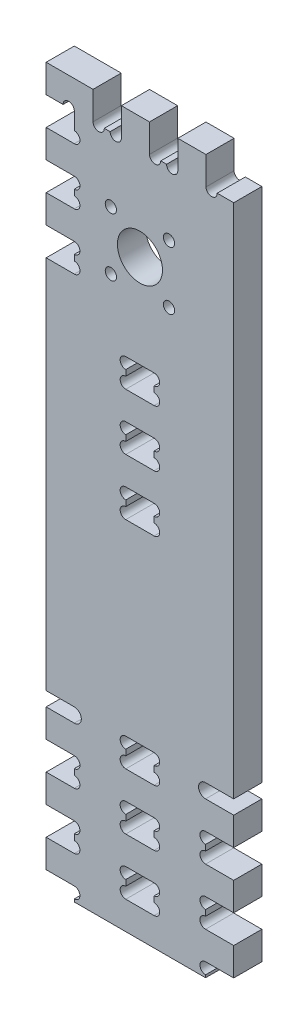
ISO-10303-21;
HEADER;
FILE_DESCRIPTION(('STEP AP214'),'2;1');
FILE_NAME('part.step','',(''),(''),'','','');
FILE_SCHEMA(('AUTOMOTIVE_DESIGN { 1 0 10303 214 1 1 1 1 }'));
ENDSEC;
DATA;
#1=APPLICATION_CONTEXT('core data for automotive mechanical design processes');
#2=APPLICATION_PROTOCOL_DEFINITION('international standard','automotive_design',2000,#1);
#3=PRODUCT_CONTEXT('',#1,'mechanical');
#4=PRODUCT('Part','Part','',(#3));
#5=PRODUCT_RELATED_PRODUCT_CATEGORY('part','',(#4));
#6=PRODUCT_DEFINITION_FORMATION('','',#4);
#7=PRODUCT_DEFINITION_CONTEXT('part definition',#1,'design');
#8=PRODUCT_DEFINITION('design','',#6,#7);
#9=PRODUCT_DEFINITION_SHAPE('','',#8);
#10=(LENGTH_UNIT() NAMED_UNIT(*) SI_UNIT(.MILLI.,.METRE.));
#11=(NAMED_UNIT(*) PLANE_ANGLE_UNIT() SI_UNIT($,.RADIAN.));
#12=(NAMED_UNIT(*) SI_UNIT($,.STERADIAN.) SOLID_ANGLE_UNIT());
#13=UNCERTAINTY_MEASURE_WITH_UNIT(LENGTH_MEASURE(1.E-05),#10,'distance_accuracy_value','');
#14=(GEOMETRIC_REPRESENTATION_CONTEXT(3) GLOBAL_UNCERTAINTY_ASSIGNED_CONTEXT((#13)) GLOBAL_UNIT_ASSIGNED_CONTEXT((#10,
#11,#12)) REPRESENTATION_CONTEXT('',''));
#15=CARTESIAN_POINT('',(0.,0.,0.));
#16=DIRECTION('',(0.,0.,1.));
#17=DIRECTION('',(1.,0.,0.));
#18=AXIS2_PLACEMENT_3D('',#15,#16,#17);
#19=CARTESIAN_POINT('',(15.,86.35,15.));
#20=DIRECTION('',(0.,0.,1.));
#21=DIRECTION('',(1.,0.,0.));
#22=AXIS2_PLACEMENT_3D('',#19,#20,#21);
#23=PLANE('',#22);
#24=DIRECTION('',(0.,-1.,0.));
#25=VECTOR('',#24,1.);
#26=CARTESIAN_POINT('',(42.4499999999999,0.,15.));
#27=LINE('',#26,#25);
#28=CARTESIAN_POINT('',(42.4499999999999,84.3,15.));
#29=VERTEX_POINT('',#28);
#30=CARTESIAN_POINT('',(42.4499999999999,81.2,15.));
#31=VERTEX_POINT('',#30);
#32=EDGE_CURVE('E851',#29,#31,#27,.T.);
#33=ORIENTED_EDGE('',*,*,#32,.F.);
#34=CARTESIAN_POINT('',(42.4499999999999,87.3,15.));
#35=DIRECTION('',(0.,0.,1.));
#36=DIRECTION('',(1.,0.,0.));
#37=AXIS2_PLACEMENT_3D('',#34,#35,#36);
#38=CIRCLE('',#37,3.);
#39=CARTESIAN_POINT('',(42.4499999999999,90.3,15.));
#40=VERTEX_POINT('',#39);
#41=EDGE_CURVE('E854',#29,#40,#38,.F.);
#42=ORIENTED_EDGE('',*,*,#41,.T.);
#43=DIRECTION('',(1.,0.,0.));
#44=VECTOR('',#43,1.);
#45=CARTESIAN_POINT('',(0.,90.3,15.));
#46=LINE('',#45,#44);
#47=CARTESIAN_POINT('',(57.5499999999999,90.3,15.));
#48=VERTEX_POINT('',#47);
#49=EDGE_CURVE('E822',#40,#48,#46,.T.);
#50=ORIENTED_EDGE('',*,*,#49,.T.);
#51=CARTESIAN_POINT('',(57.5499999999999,87.3,15.));
#52=DIRECTION('',(0.,0.,1.));
#53=DIRECTION('',(1.,0.,0.));
#54=AXIS2_PLACEMENT_3D('',#51,#52,#53);
#55=CIRCLE('',#54,3.);
#56=CARTESIAN_POINT('',(57.5499999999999,84.3,15.));
#57=VERTEX_POINT('',#56);
#58=EDGE_CURVE('E836',#48,#57,#55,.F.);
#59=ORIENTED_EDGE('',*,*,#58,.T.);
#60=DIRECTION('',(0.,1.,0.));
#61=VECTOR('',#60,1.);
#62=CARTESIAN_POINT('',(57.5499999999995,-2.57634415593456E-13,15.));
#63=LINE('',#62,#61);
#64=CARTESIAN_POINT('',(57.5499999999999,81.2,15.));
#65=VERTEX_POINT('',#64);
#66=EDGE_CURVE('E839',#65,#57,#63,.T.);
#67=ORIENTED_EDGE('',*,*,#66,.F.);
#68=CARTESIAN_POINT('',(57.5499999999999,78.2,15.));
#69=DIRECTION('',(0.,0.,1.));
#70=DIRECTION('',(1.,0.,0.));
#71=AXIS2_PLACEMENT_3D('',#68,#69,#70);
#72=CIRCLE('',#71,3.);
#73=CARTESIAN_POINT('',(57.5499999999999,75.2,15.));
#74=VERTEX_POINT('',#73);
#75=EDGE_CURVE('E842',#65,#74,#72,.F.);
#76=ORIENTED_EDGE('',*,*,#75,.T.);
#77=DIRECTION('',(1.,0.,0.));
#78=VECTOR('',#77,1.);
#79=CARTESIAN_POINT('',(0.,75.2,15.));
#80=LINE('',#79,#78);
#81=CARTESIAN_POINT('',(42.4499999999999,75.2,15.));
#82=VERTEX_POINT('',#81);
#83=EDGE_CURVE('E845',#82,#74,#80,.T.);
#84=ORIENTED_EDGE('',*,*,#83,.F.);
#85=CARTESIAN_POINT('',(42.4499999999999,78.2,15.));
#86=DIRECTION('',(0.,0.,1.));
#87=DIRECTION('',(1.,0.,0.));
#88=AXIS2_PLACEMENT_3D('',#85,#86,#87);
#89=CIRCLE('',#88,3.);
#90=EDGE_CURVE('E848',#31,#82,#89,.T.);
#91=ORIENTED_EDGE('',*,*,#90,.F.);
#92=EDGE_LOOP('',(#33,#42,#50,#59,#67,#76,#84,#91));
#93=FACE_BOUND('',#92,.T.);
#94=DIRECTION('',(0.,-1.,0.));
#95=VECTOR('',#94,1.);
#96=CARTESIAN_POINT('',(42.4500000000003,0.,15.));
#97=LINE('',#96,#95);
#98=CARTESIAN_POINT('',(42.4499999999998,229.5,15.));
#99=VERTEX_POINT('',#98);
#100=CARTESIAN_POINT('',(42.4499999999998,226.4,15.));
#101=VERTEX_POINT('',#100);
#102=EDGE_CURVE('E933',#99,#101,#97,.T.);
#103=ORIENTED_EDGE('',*,*,#102,.F.);
#104=CARTESIAN_POINT('',(42.4499999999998,232.5,15.));
#105=DIRECTION('',(0.,0.,1.));
#106=DIRECTION('',(1.,0.,0.));
#107=AXIS2_PLACEMENT_3D('',#104,#105,#106);
#108=CIRCLE('',#107,3.);
#109=CARTESIAN_POINT('',(42.4499999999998,235.5,15.));
#110=VERTEX_POINT('',#109);
#111=EDGE_CURVE('E936',#99,#110,#108,.F.);
#112=ORIENTED_EDGE('',*,*,#111,.T.);
#113=DIRECTION('',(1.,0.,0.));
#114=VECTOR('',#113,1.);
#115=CARTESIAN_POINT('',(0.,235.5,15.));
#116=LINE('',#115,#114);
#117=CARTESIAN_POINT('',(57.5499999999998,235.5,15.));
#118=VERTEX_POINT('',#117);
#119=EDGE_CURVE('E902',#110,#118,#116,.T.);
#120=ORIENTED_EDGE('',*,*,#119,.T.);
#121=CARTESIAN_POINT('',(57.5499999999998,232.5,15.));
#122=DIRECTION('',(0.,0.,1.));
#123=DIRECTION('',(1.,0.,0.));
#124=AXIS2_PLACEMENT_3D('',#121,#122,#123);
#125=CIRCLE('',#124,2.99999999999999);
#126=CARTESIAN_POINT('',(57.5499999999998,229.5,15.));
#127=VERTEX_POINT('',#126);
#128=EDGE_CURVE('E918',#118,#127,#125,.F.);
#129=ORIENTED_EDGE('',*,*,#128,.T.);
#130=DIRECTION('',(0.,1.,0.));
#131=VECTOR('',#130,1.);
#132=CARTESIAN_POINT('',(57.5499999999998,0.,15.));
#133=LINE('',#132,#131);
#134=CARTESIAN_POINT('',(57.5499999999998,226.4,15.));
#135=VERTEX_POINT('',#134);
#136=EDGE_CURVE('E921',#135,#127,#133,.T.);
#137=ORIENTED_EDGE('',*,*,#136,.F.);
#138=CARTESIAN_POINT('',(57.5499999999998,223.4,15.));
#139=DIRECTION('',(0.,0.,1.));
#140=DIRECTION('',(1.,0.,0.));
#141=AXIS2_PLACEMENT_3D('',#138,#139,#140);
#142=CIRCLE('',#141,3.00000000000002);
#143=CARTESIAN_POINT('',(57.5499999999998,220.4,15.));
#144=VERTEX_POINT('',#143);
#145=EDGE_CURVE('E924',#135,#144,#142,.F.);
#146=ORIENTED_EDGE('',*,*,#145,.T.);
#147=DIRECTION('',(1.,0.,0.));
#148=VECTOR('',#147,1.);
#149=CARTESIAN_POINT('',(0.,220.4,15.));
#150=LINE('',#149,#148);
#151=CARTESIAN_POINT('',(42.4499999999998,220.4,15.));
#152=VERTEX_POINT('',#151);
#153=EDGE_CURVE('E927',#152,#144,#150,.T.);
#154=ORIENTED_EDGE('',*,*,#153,.F.);
#155=CARTESIAN_POINT('',(42.4499999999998,223.4,15.));
#156=DIRECTION('',(0.,0.,1.));
#157=DIRECTION('',(1.,0.,0.));
#158=AXIS2_PLACEMENT_3D('',#155,#156,#157);
#159=CIRCLE('',#158,3.);
#160=EDGE_CURVE('E930',#101,#152,#159,.T.);
#161=ORIENTED_EDGE('',*,*,#160,.F.);
#162=EDGE_LOOP('',(#103,#112,#120,#129,#137,#146,#154,#161));
#163=FACE_BOUND('',#162,.T.);
#164=DIRECTION('',(0.,-1.,0.));
#165=VECTOR('',#164,1.);
#166=CARTESIAN_POINT('',(42.45,0.,15.));
#167=LINE('',#166,#165);
#168=CARTESIAN_POINT('',(42.45,24.1,15.));
#169=VERTEX_POINT('',#168);
#170=CARTESIAN_POINT('',(42.45,21.,15.));
#171=VERTEX_POINT('',#170);
#172=EDGE_CURVE('E983',#169,#171,#167,.T.);
#173=ORIENTED_EDGE('',*,*,#172,.F.);
#174=CARTESIAN_POINT('',(42.45,27.1,15.));
#175=DIRECTION('',(0.,0.,1.));
#176=DIRECTION('',(1.,0.,0.));
#177=AXIS2_PLACEMENT_3D('',#174,#175,#176);
#178=CIRCLE('',#177,3.);
#179=CARTESIAN_POINT('',(42.45,30.1,15.));
#180=VERTEX_POINT('',#179);
#181=EDGE_CURVE('E980',#169,#180,#178,.F.);
#182=ORIENTED_EDGE('',*,*,#181,.T.);
#183=DIRECTION('',(1.,0.,0.));
#184=VECTOR('',#183,1.);
#185=CARTESIAN_POINT('',(0.,30.1,15.));
#186=LINE('',#185,#184);
#187=CARTESIAN_POINT('',(57.55,30.1,15.));
#188=VERTEX_POINT('',#187);
#189=EDGE_CURVE('E1001',#180,#188,#186,.T.);
#190=ORIENTED_EDGE('',*,*,#189,.T.);
#191=CARTESIAN_POINT('',(57.55,27.1,15.));
#192=DIRECTION('',(0.,0.,1.));
#193=DIRECTION('',(1.,0.,0.));
#194=AXIS2_PLACEMENT_3D('',#191,#192,#193);
#195=CIRCLE('',#194,3.);
#196=CARTESIAN_POINT('',(57.55,24.1,15.));
#197=VERTEX_POINT('',#196);
#198=EDGE_CURVE('E998',#188,#197,#195,.F.);
#199=ORIENTED_EDGE('',*,*,#198,.T.);
#200=DIRECTION('',(0.,1.,0.));
#201=VECTOR('',#200,1.);
#202=CARTESIAN_POINT('',(57.5500000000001,2.57634415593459E-13,15.));
#203=LINE('',#202,#201);
#204=CARTESIAN_POINT('',(57.55,21.,15.));
#205=VERTEX_POINT('',#204);
#206=EDGE_CURVE('E995',#205,#197,#203,.T.);
#207=ORIENTED_EDGE('',*,*,#206,.F.);
#208=CARTESIAN_POINT('',(57.55,18.,15.));
#209=DIRECTION('',(0.,0.,1.));
#210=DIRECTION('',(1.,0.,0.));
#211=AXIS2_PLACEMENT_3D('',#208,#209,#210);
#212=CIRCLE('',#211,3.);
#213=CARTESIAN_POINT('',(57.55,15.,15.));
#214=VERTEX_POINT('',#213);
#215=EDGE_CURVE('E992',#205,#214,#212,.F.);
#216=ORIENTED_EDGE('',*,*,#215,.T.);
#217=DIRECTION('',(1.,0.,0.));
#218=VECTOR('',#217,1.);
#219=CARTESIAN_POINT('',(0.,15.,15.));
#220=LINE('',#219,#218);
#221=CARTESIAN_POINT('',(42.45,15.,15.));
#222=VERTEX_POINT('',#221);
#223=EDGE_CURVE('E989',#222,#214,#220,.T.);
#224=ORIENTED_EDGE('',*,*,#223,.F.);
#225=CARTESIAN_POINT('',(42.45,18.,15.));
#226=DIRECTION('',(0.,0.,1.));
#227=DIRECTION('',(1.,0.,0.));
#228=AXIS2_PLACEMENT_3D('',#225,#226,#227);
#229=CIRCLE('',#228,3.);
#230=EDGE_CURVE('E986',#171,#222,#229,.T.);
#231=ORIENTED_EDGE('',*,*,#230,.F.);
#232=EDGE_LOOP('',(#173,#182,#190,#199,#207,#216,#224,#231));
#233=FACE_BOUND('',#232,.T.);
#234=CARTESIAN_POINT('',(65.4999999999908,299.770515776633,15.));
#235=DIRECTION('',(0.,0.,1.));
#236=DIRECTION('',(1.,0.,0.));
#237=AXIS2_PLACEMENT_3D('',#234,#235,#236);
#238=CIRCLE('',#237,3.00000000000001);
#239=CARTESIAN_POINT('',(68.4999999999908,299.770515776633,15.));
#240=VERTEX_POINT('',#239);
#241=EDGE_CURVE('E1024',#240,#240,#238,.T.);
#242=ORIENTED_EDGE('',*,*,#241,.F.);
#243=EDGE_LOOP('',(#242));
#244=FACE_BOUND('',#243,.T.);
#245=CARTESIAN_POINT('',(34.5,299.770539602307,15.));
#246=DIRECTION('',(0.,0.,1.));
#247=DIRECTION('',(1.,0.,0.));
#248=AXIS2_PLACEMENT_3D('',#245,#246,#247);
#249=CIRCLE('',#248,3.);
#250=CARTESIAN_POINT('',(37.5,299.770539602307,15.));
#251=VERTEX_POINT('',#250);
#252=EDGE_CURVE('E1030',#251,#251,#249,.T.);
#253=ORIENTED_EDGE('',*,*,#252,.F.);
#254=EDGE_LOOP('',(#253));
#255=FACE_BOUND('',#254,.T.);
#256=CARTESIAN_POINT('',(34.5000000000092,330.770539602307,15.));
#257=DIRECTION('',(0.,0.,1.));
#258=DIRECTION('',(1.,0.,0.));
#259=AXIS2_PLACEMENT_3D('',#256,#257,#258);
#260=CIRCLE('',#259,3.);
#261=CARTESIAN_POINT('',(37.5000000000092,330.770539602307,15.));
#262=VERTEX_POINT('',#261);
#263=EDGE_CURVE('E1036',#262,#262,#260,.T.);
#264=ORIENTED_EDGE('',*,*,#263,.F.);
#265=EDGE_LOOP('',(#264));
#266=FACE_BOUND('',#265,.T.);
#267=CARTESIAN_POINT('',(65.5,330.770515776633,15.));
#268=DIRECTION('',(0.,0.,1.));
#269=DIRECTION('',(1.,0.,0.));
#270=AXIS2_PLACEMENT_3D('',#267,#268,#269);
#271=CIRCLE('',#270,3.00000000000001);
#272=CARTESIAN_POINT('',(68.5,330.770515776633,15.));
#273=VERTEX_POINT('',#272);
#274=EDGE_CURVE('E1042',#273,#273,#271,.T.);
#275=ORIENTED_EDGE('',*,*,#274,.F.);
#276=EDGE_LOOP('',(#275));
#277=FACE_BOUND('',#276,.T.);
#278=CARTESIAN_POINT('',(50.,315.270515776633,15.));
#279=DIRECTION('',(0.,0.,1.));
#280=DIRECTION('',(1.,0.,0.));
#281=AXIS2_PLACEMENT_3D('',#278,#279,#280);
#282=CIRCLE('',#281,12.);
#283=CARTESIAN_POINT('',(62.,315.270515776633,15.));
#284=VERTEX_POINT('',#283);
#285=EDGE_CURVE('E1048',#284,#284,#282,.T.);
#286=ORIENTED_EDGE('',*,*,#285,.F.);
#287=EDGE_LOOP('',(#286));
#288=FACE_BOUND('',#287,.T.);
#289=CARTESIAN_POINT('',(15.,86.35,15.));
#290=DIRECTION('',(0.,0.,-1.));
#291=DIRECTION('',(1.,0.,0.));
#292=AXIS2_PLACEMENT_3D('',#289,#290,#291);
#293=CIRCLE('',#292,3.75);
#294=CARTESIAN_POINT('',(15.,90.1,15.));
#295=VERTEX_POINT('',#294);
#296=CARTESIAN_POINT('',(15.,82.6,15.));
#297=VERTEX_POINT('',#296);
#298=EDGE_CURVE('E1064',#295,#297,#293,.T.);
#299=ORIENTED_EDGE('',*,*,#298,.T.);
#300=DIRECTION('',(-1.,0.,0.));
#301=VECTOR('',#300,1.);
#302=CARTESIAN_POINT('',(0.,82.6,15.));
#303=LINE('',#302,#301);
#304=CARTESIAN_POINT('',(0.,82.6,15.));
#305=VERTEX_POINT('',#304);
#306=EDGE_CURVE('E1067',#297,#305,#303,.T.);
#307=ORIENTED_EDGE('',*,*,#306,.T.);
#308=DIRECTION('',(0.,-1.,0.));
#309=VECTOR('',#308,1.);
#310=CARTESIAN_POINT('',(0.,82.6,15.));
#311=LINE('',#310,#309);
#312=CARTESIAN_POINT('',(0.,67.6,15.));
#313=VERTEX_POINT('',#312);
#314=EDGE_CURVE('E1070',#305,#313,#311,.T.);
#315=ORIENTED_EDGE('',*,*,#314,.T.);
#316=DIRECTION('',(1.,0.,0.));
#317=VECTOR('',#316,1.);
#318=CARTESIAN_POINT('',(0.,67.6,15.));
#319=LINE('',#318,#317);
#320=CARTESIAN_POINT('',(15.,67.6,15.));
#321=VERTEX_POINT('',#320);
#322=EDGE_CURVE('E1072',#313,#321,#319,.T.);
#323=ORIENTED_EDGE('',*,*,#322,.T.);
#324=CARTESIAN_POINT('',(15.,64.6,15.));
#325=DIRECTION('',(0.,0.,-1.));
#326=DIRECTION('',(-1.,0.,0.));
#327=AXIS2_PLACEMENT_3D('',#324,#325,#326);
#328=CIRCLE('',#327,3.);
#329=CARTESIAN_POINT('',(15.,61.6,15.));
#330=VERTEX_POINT('',#329);
#331=EDGE_CURVE('E1074',#321,#330,#328,.T.);
#332=ORIENTED_EDGE('',*,*,#331,.T.);
#333=DIRECTION('',(0.,-1.,0.));
#334=VECTOR('',#333,1.);
#335=CARTESIAN_POINT('',(15.,61.6,15.));
#336=LINE('',#335,#334);
#337=CARTESIAN_POINT('',(15.,58.5,15.));
#338=VERTEX_POINT('',#337);
#339=EDGE_CURVE('E1076',#330,#338,#336,.T.);
#340=ORIENTED_EDGE('',*,*,#339,.T.);
#341=CARTESIAN_POINT('',(15.,55.5,15.));
#342=DIRECTION('',(0.,0.,-1.));
#343=DIRECTION('',(-1.,0.,0.));
#344=AXIS2_PLACEMENT_3D('',#341,#342,#343);
#345=CIRCLE('',#344,3.);
#346=CARTESIAN_POINT('',(15.,52.5,15.));
#347=VERTEX_POINT('',#346);
#348=EDGE_CURVE('E1078',#338,#347,#345,.T.);
#349=ORIENTED_EDGE('',*,*,#348,.T.);
#350=DIRECTION('',(-1.,0.,0.));
#351=VECTOR('',#350,1.);
#352=CARTESIAN_POINT('',(15.,52.5,15.));
#353=LINE('',#352,#351);
#354=CARTESIAN_POINT('',(0.,52.5,15.));
#355=VERTEX_POINT('',#354);
#356=EDGE_CURVE('E1080',#347,#355,#353,.T.);
#357=ORIENTED_EDGE('',*,*,#356,.T.);
#358=DIRECTION('',(0.,-1.,0.));
#359=VECTOR('',#358,1.);
#360=CARTESIAN_POINT('',(0.,52.5,15.));
#361=LINE('',#360,#359);
#362=CARTESIAN_POINT('',(0.,37.5,15.));
#363=VERTEX_POINT('',#362);
#364=EDGE_CURVE('E1082',#355,#363,#361,.T.);
#365=ORIENTED_EDGE('',*,*,#364,.T.);
#366=DIRECTION('',(1.,0.,0.));
#367=VECTOR('',#366,1.);
#368=CARTESIAN_POINT('',(0.,37.5,15.));
#369=LINE('',#368,#367);
#370=CARTESIAN_POINT('',(15.,37.5,15.));
#371=VERTEX_POINT('',#370);
#372=EDGE_CURVE('E1084',#363,#371,#369,.T.);
#373=ORIENTED_EDGE('',*,*,#372,.T.);
#374=CARTESIAN_POINT('',(15.,34.5,15.));
#375=DIRECTION('',(0.,0.,-1.));
#376=DIRECTION('',(-1.,0.,0.));
#377=AXIS2_PLACEMENT_3D('',#374,#375,#376);
#378=CIRCLE('',#377,3.);
#379=CARTESIAN_POINT('',(15.,31.5,15.));
#380=VERTEX_POINT('',#379);
#381=EDGE_CURVE('E1086',#371,#380,#378,.T.);
#382=ORIENTED_EDGE('',*,*,#381,.T.);
#383=DIRECTION('',(0.,-1.,0.));
#384=VECTOR('',#383,1.);
#385=CARTESIAN_POINT('',(15.,31.5,15.));
#386=LINE('',#385,#384);
#387=CARTESIAN_POINT('',(15.,28.4,15.));
#388=VERTEX_POINT('',#387);
#389=EDGE_CURVE('E1088',#380,#388,#386,.T.);
#390=ORIENTED_EDGE('',*,*,#389,.T.);
#391=CARTESIAN_POINT('',(15.,25.4,15.));
#392=DIRECTION('',(0.,0.,-1.));
#393=DIRECTION('',(-1.,0.,0.));
#394=AXIS2_PLACEMENT_3D('',#391,#392,#393);
#395=CIRCLE('',#394,3.);
#396=CARTESIAN_POINT('',(15.,22.4,15.));
#397=VERTEX_POINT('',#396);
#398=EDGE_CURVE('E1090',#388,#397,#395,.T.);
#399=ORIENTED_EDGE('',*,*,#398,.T.);
#400=DIRECTION('',(-1.,0.,0.));
#401=VECTOR('',#400,1.);
#402=CARTESIAN_POINT('',(15.,22.4,15.));
#403=LINE('',#402,#401);
#404=CARTESIAN_POINT('',(0.,22.4,15.));
#405=VERTEX_POINT('',#404);
#406=EDGE_CURVE('E1092',#397,#405,#403,.T.);
#407=ORIENTED_EDGE('',*,*,#406,.T.);
#408=DIRECTION('',(0.,-1.,0.));
#409=VECTOR('',#408,1.);
#410=CARTESIAN_POINT('',(0.,22.4,15.));
#411=LINE('',#410,#409);
#412=CARTESIAN_POINT('',(0.,7.4,15.));
#413=VERTEX_POINT('',#412);
#414=EDGE_CURVE('E1094',#405,#413,#411,.T.);
#415=ORIENTED_EDGE('',*,*,#414,.T.);
#416=DIRECTION('',(1.,0.,0.));
#417=VECTOR('',#416,1.);
#418=CARTESIAN_POINT('',(0.,7.4,15.));
#419=LINE('',#418,#417);
#420=CARTESIAN_POINT('',(15.,7.4,15.));
#421=VERTEX_POINT('',#420);
#422=EDGE_CURVE('E1096',#413,#421,#419,.T.);
#423=ORIENTED_EDGE('',*,*,#422,.T.);
#424=CARTESIAN_POINT('',(15.,4.4,15.));
#425=DIRECTION('',(0.,0.,-1.));
#426=DIRECTION('',(-1.,0.,0.));
#427=AXIS2_PLACEMENT_3D('',#424,#425,#426);
#428=CIRCLE('',#427,3.);
#429=CARTESIAN_POINT('',(15.,1.4,15.));
#430=VERTEX_POINT('',#429);
#431=EDGE_CURVE('E1098',#421,#430,#428,.T.);
#432=ORIENTED_EDGE('',*,*,#431,.T.);
#433=DIRECTION('',(0.,-1.,0.));
#434=VECTOR('',#433,1.);
#435=CARTESIAN_POINT('',(15.,1.4,15.));
#436=LINE('',#435,#434);
#437=CARTESIAN_POINT('',(15.,0.,15.));
#438=VERTEX_POINT('',#437);
#439=EDGE_CURVE('E1100',#430,#438,#436,.T.);
#440=ORIENTED_EDGE('',*,*,#439,.T.);
#441=DIRECTION('',(1.,0.,0.));
#442=VECTOR('',#441,1.);
#443=CARTESIAN_POINT('',(85.,0.,15.));
#444=LINE('',#443,#442);
#445=CARTESIAN_POINT('',(85.,0.,15.));
#446=VERTEX_POINT('',#445);
#447=EDGE_CURVE('E1102',#438,#446,#444,.T.);
#448=ORIENTED_EDGE('',*,*,#447,.T.);
#449=DIRECTION('',(0.,1.,0.));
#450=VECTOR('',#449,1.);
#451=CARTESIAN_POINT('',(85.,1.39999999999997,15.));
#452=LINE('',#451,#450);
#453=CARTESIAN_POINT('',(85.,1.39999999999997,15.));
#454=VERTEX_POINT('',#453);
#455=EDGE_CURVE('E1104',#446,#454,#452,.T.);
#456=ORIENTED_EDGE('',*,*,#455,.T.);
#457=CARTESIAN_POINT('',(85.,4.39999999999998,15.));
#458=DIRECTION('',(0.,0.,-1.));
#459=DIRECTION('',(1.,0.,0.));
#460=AXIS2_PLACEMENT_3D('',#457,#458,#459);
#461=CIRCLE('',#460,3.00000000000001);
#462=CARTESIAN_POINT('',(85.,7.39999999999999,15.));
#463=VERTEX_POINT('',#462);
#464=EDGE_CURVE('E1106',#454,#463,#461,.T.);
#465=ORIENTED_EDGE('',*,*,#464,.T.);
#466=DIRECTION('',(1.,0.,0.));
#467=VECTOR('',#466,1.);
#468=CARTESIAN_POINT('',(100.,7.4,15.));
#469=LINE('',#468,#467);
#470=CARTESIAN_POINT('',(100.,7.4,15.));
#471=VERTEX_POINT('',#470);
#472=EDGE_CURVE('E1108',#463,#471,#469,.T.);
#473=ORIENTED_EDGE('',*,*,#472,.T.);
#474=DIRECTION('',(0.,1.,0.));
#475=VECTOR('',#474,1.);
#476=CARTESIAN_POINT('',(100.,22.4,15.));
#477=LINE('',#476,#475);
#478=CARTESIAN_POINT('',(100.,22.4,15.));
#479=VERTEX_POINT('',#478);
#480=EDGE_CURVE('E1110',#471,#479,#477,.T.);
#481=ORIENTED_EDGE('',*,*,#480,.T.);
#482=DIRECTION('',(-1.,0.,0.));
#483=VECTOR('',#482,1.);
#484=CARTESIAN_POINT('',(85.,22.4,15.));
#485=LINE('',#484,#483);
#486=CARTESIAN_POINT('',(85.,22.4,15.));
#487=VERTEX_POINT('',#486);
#488=EDGE_CURVE('E1112',#479,#487,#485,.T.);
#489=ORIENTED_EDGE('',*,*,#488,.T.);
#490=CARTESIAN_POINT('',(85.0000000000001,25.4,15.));
#491=DIRECTION('',(0.,0.,-1.));
#492=DIRECTION('',(-1.,0.,0.));
#493=AXIS2_PLACEMENT_3D('',#490,#491,#492);
#494=CIRCLE('',#493,3.);
#495=CARTESIAN_POINT('',(85.0000000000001,28.4,15.));
#496=VERTEX_POINT('',#495);
#497=EDGE_CURVE('E1114',#487,#496,#494,.T.);
#498=ORIENTED_EDGE('',*,*,#497,.T.);
#499=DIRECTION('',(0.,1.,0.));
#500=VECTOR('',#499,1.);
#501=CARTESIAN_POINT('',(85.,31.5,15.));
#502=LINE('',#501,#500);
#503=CARTESIAN_POINT('',(85.,31.5,15.));
#504=VERTEX_POINT('',#503);
#505=EDGE_CURVE('E1116',#496,#504,#502,.T.);
#506=ORIENTED_EDGE('',*,*,#505,.T.);
#507=CARTESIAN_POINT('',(85.,34.5,15.));
#508=DIRECTION('',(0.,0.,-1.));
#509=DIRECTION('',(-1.,0.,0.));
#510=AXIS2_PLACEMENT_3D('',#507,#508,#509);
#511=CIRCLE('',#510,3.);
#512=CARTESIAN_POINT('',(85.,37.5,15.));
#513=VERTEX_POINT('',#512);
#514=EDGE_CURVE('E1118',#504,#513,#511,.T.);
#515=ORIENTED_EDGE('',*,*,#514,.T.);
#516=DIRECTION('',(1.,0.,0.));
#517=VECTOR('',#516,1.);
#518=CARTESIAN_POINT('',(100.,37.5,15.));
#519=LINE('',#518,#517);
#520=CARTESIAN_POINT('',(100.,37.5,15.));
#521=VERTEX_POINT('',#520);
#522=EDGE_CURVE('E1120',#513,#521,#519,.T.);
#523=ORIENTED_EDGE('',*,*,#522,.T.);
#524=DIRECTION('',(0.,1.,0.));
#525=VECTOR('',#524,1.);
#526=CARTESIAN_POINT('',(100.,52.5,15.));
#527=LINE('',#526,#525);
#528=CARTESIAN_POINT('',(100.,52.5,15.));
#529=VERTEX_POINT('',#528);
#530=EDGE_CURVE('E1122',#521,#529,#527,.T.);
#531=ORIENTED_EDGE('',*,*,#530,.T.);
#532=DIRECTION('',(-1.,0.,0.));
#533=VECTOR('',#532,1.);
#534=CARTESIAN_POINT('',(85.,52.5,15.));
#535=LINE('',#534,#533);
#536=CARTESIAN_POINT('',(85.,52.5,15.));
#537=VERTEX_POINT('',#536);
#538=EDGE_CURVE('E1124',#529,#537,#535,.T.);
#539=ORIENTED_EDGE('',*,*,#538,.T.);
#540=CARTESIAN_POINT('',(85.,55.5,15.));
#541=DIRECTION('',(0.,0.,-1.));
#542=DIRECTION('',(-1.,0.,0.));
#543=AXIS2_PLACEMENT_3D('',#540,#541,#542);
#544=CIRCLE('',#543,3.);
#545=CARTESIAN_POINT('',(85.,58.5,15.));
#546=VERTEX_POINT('',#545);
#547=EDGE_CURVE('E1126',#537,#546,#544,.T.);
#548=ORIENTED_EDGE('',*,*,#547,.T.);
#549=DIRECTION('',(0.,1.,0.));
#550=VECTOR('',#549,1.);
#551=CARTESIAN_POINT('',(85.,61.6,15.));
#552=LINE('',#551,#550);
#553=CARTESIAN_POINT('',(85.,61.6,15.));
#554=VERTEX_POINT('',#553);
#555=EDGE_CURVE('E1128',#546,#554,#552,.T.);
#556=ORIENTED_EDGE('',*,*,#555,.T.);
#557=CARTESIAN_POINT('',(85.,64.6,15.));
#558=DIRECTION('',(0.,0.,-1.));
#559=DIRECTION('',(-1.,0.,0.));
#560=AXIS2_PLACEMENT_3D('',#557,#558,#559);
#561=CIRCLE('',#560,3.);
#562=CARTESIAN_POINT('',(85.,67.6,15.));
#563=VERTEX_POINT('',#562);
#564=EDGE_CURVE('E1130',#554,#563,#561,.T.);
#565=ORIENTED_EDGE('',*,*,#564,.T.);
#566=DIRECTION('',(1.,0.,0.));
#567=VECTOR('',#566,1.);
#568=CARTESIAN_POINT('',(100.,67.6,15.));
#569=LINE('',#568,#567);
#570=CARTESIAN_POINT('',(100.,67.6,15.));
#571=VERTEX_POINT('',#570);
#572=EDGE_CURVE('E1132',#563,#571,#569,.T.);
#573=ORIENTED_EDGE('',*,*,#572,.T.);
#574=DIRECTION('',(0.,1.,0.));
#575=VECTOR('',#574,1.);
#576=CARTESIAN_POINT('',(100.,82.6,15.));
#577=LINE('',#576,#575);
#578=CARTESIAN_POINT('',(100.,82.6,15.));
#579=VERTEX_POINT('',#578);
#580=EDGE_CURVE('E1134',#571,#579,#577,.T.);
#581=ORIENTED_EDGE('',*,*,#580,.T.);
#582=DIRECTION('',(-1.,0.,0.));
#583=VECTOR('',#582,1.);
#584=CARTESIAN_POINT('',(85.,82.6,15.));
#585=LINE('',#584,#583);
#586=CARTESIAN_POINT('',(85.,82.6,15.));
#587=VERTEX_POINT('',#586);
#588=EDGE_CURVE('E1136',#579,#587,#585,.T.);
#589=ORIENTED_EDGE('',*,*,#588,.T.);
#590=CARTESIAN_POINT('',(85.,86.35,15.));
#591=DIRECTION('',(0.,0.,-1.));
#592=DIRECTION('',(-1.,0.,0.));
#593=AXIS2_PLACEMENT_3D('',#590,#591,#592);
#594=CIRCLE('',#593,3.75);
#595=CARTESIAN_POINT('',(85.,90.1,15.));
#596=VERTEX_POINT('',#595);
#597=EDGE_CURVE('E1138',#587,#596,#594,.T.);
#598=ORIENTED_EDGE('',*,*,#597,.T.);
#599=DIRECTION('',(1.,0.,0.));
#600=VECTOR('',#599,1.);
#601=CARTESIAN_POINT('',(85.,90.1,15.));
#602=LINE('',#601,#600);
#603=CARTESIAN_POINT('',(100.,90.1,15.));
#604=VERTEX_POINT('',#603);
#605=EDGE_CURVE('E1140',#596,#604,#602,.T.);
#606=ORIENTED_EDGE('',*,*,#605,.T.);
#607=DIRECTION('',(0.,1.,0.));
#608=VECTOR('',#607,1.);
#609=CARTESIAN_POINT('',(100.,90.1,15.));
#610=LINE('',#609,#608);
#611=CARTESIAN_POINT('',(100.,365.4,15.));
#612=VERTEX_POINT('',#611);
#613=EDGE_CURVE('E1142',#604,#612,#610,.T.);
#614=ORIENTED_EDGE('',*,*,#613,.T.);
#615=DIRECTION('',(-1.,0.,0.));
#616=VECTOR('',#615,1.);
#617=CARTESIAN_POINT('',(91.1999999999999,365.4,15.));
#618=LINE('',#617,#616);
#619=CARTESIAN_POINT('',(91.1999999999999,365.4,15.));
#620=VERTEX_POINT('',#619);
#621=EDGE_CURVE('E1144',#612,#620,#618,.T.);
#622=ORIENTED_EDGE('',*,*,#621,.T.);
#623=CARTESIAN_POINT('',(88.1999999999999,365.335267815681,15.));
#624=DIRECTION('',(0.,0.,-1.));
#625=DIRECTION('',(-1.,0.,0.));
#626=AXIS2_PLACEMENT_3D('',#623,#624,#625);
#627=CIRCLE('',#626,3.00069829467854);
#628=CARTESIAN_POINT('',(85.2,365.270535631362,15.));
#629=VERTEX_POINT('',#628);
#630=EDGE_CURVE('E1146',#620,#629,#627,.T.);
#631=ORIENTED_EDGE('',*,*,#630,.T.);
#632=DIRECTION('',(0.,1.,0.));
#633=VECTOR('',#632,1.);
#634=CARTESIAN_POINT('',(85.1999999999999,380.270535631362,15.));
#635=LINE('',#634,#633);
#636=CARTESIAN_POINT('',(85.1999999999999,380.270535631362,15.));
#637=VERTEX_POINT('',#636);
#638=EDGE_CURVE('E1148',#629,#637,#635,.T.);
#639=ORIENTED_EDGE('',*,*,#638,.T.);
#640=DIRECTION('',(-1.,0.,0.));
#641=VECTOR('',#640,1.);
#642=CARTESIAN_POINT('',(70.1999999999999,380.270535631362,15.));
#643=LINE('',#642,#641);
#644=CARTESIAN_POINT('',(70.1999999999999,380.270535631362,15.));
#645=VERTEX_POINT('',#644);
#646=EDGE_CURVE('E1150',#637,#645,#643,.T.);
#647=ORIENTED_EDGE('',*,*,#646,.T.);
#648=DIRECTION('',(0.,-1.,0.));
#649=VECTOR('',#648,1.);
#650=CARTESIAN_POINT('',(70.1999999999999,365.270535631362,15.));
#651=LINE('',#650,#649);
#652=CARTESIAN_POINT('',(70.1999999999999,365.270535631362,15.));
#653=VERTEX_POINT('',#652);
#654=EDGE_CURVE('E1152',#645,#653,#651,.T.);
#655=ORIENTED_EDGE('',*,*,#654,.T.);
#656=CARTESIAN_POINT('',(67.1999999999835,365.270535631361,15.));
#657=DIRECTION('',(0.,0.,-1.));
#658=DIRECTION('',(-1.,0.,0.));
#659=AXIS2_PLACEMENT_3D('',#656,#657,#658);
#660=CIRCLE('',#659,3.00000000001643);
#661=CARTESIAN_POINT('',(64.2000000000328,365.270515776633,15.));
#662=VERTEX_POINT('',#661);
#663=EDGE_CURVE('E1154',#653,#662,#660,.T.);
#664=ORIENTED_EDGE('',*,*,#663,.T.);
#665=DIRECTION('',(-1.,0.,0.));
#666=VECTOR('',#665,1.);
#667=CARTESIAN_POINT('',(61.0999999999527,365.270515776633,15.));
#668=LINE('',#667,#666);
#669=CARTESIAN_POINT('',(61.0999999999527,365.270515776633,15.));
#670=VERTEX_POINT('',#669);
#671=EDGE_CURVE('E1156',#662,#670,#668,.T.);
#672=ORIENTED_EDGE('',*,*,#671,.T.);
#673=CARTESIAN_POINT('',(58.1000000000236,365.270539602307,15.));
#674=DIRECTION('',(0.,0.,-1.));
#675=DIRECTION('',(-1.,0.,0.));
#676=AXIS2_PLACEMENT_3D('',#673,#674,#675);
#677=CIRCLE('',#676,3.00000000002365);
#678=CARTESIAN_POINT('',(55.1,365.270539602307,15.));
#679=VERTEX_POINT('',#678);
#680=EDGE_CURVE('E1158',#670,#679,#677,.T.);
#681=ORIENTED_EDGE('',*,*,#680,.T.);
#682=DIRECTION('',(0.,1.,0.));
#683=VECTOR('',#682,1.);
#684=CARTESIAN_POINT('',(55.1,380.270539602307,15.));
#685=LINE('',#684,#683);
#686=CARTESIAN_POINT('',(55.1,380.270539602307,15.));
#687=VERTEX_POINT('',#686);
#688=EDGE_CURVE('E1160',#679,#687,#685,.T.);
#689=ORIENTED_EDGE('',*,*,#688,.T.);
#690=DIRECTION('',(-1.,0.,0.));
#691=VECTOR('',#690,1.);
#692=CARTESIAN_POINT('',(40.1,380.270539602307,15.));
#693=LINE('',#692,#691);
#694=CARTESIAN_POINT('',(40.1,380.270539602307,15.));
#695=VERTEX_POINT('',#694);
#696=EDGE_CURVE('E1162',#687,#695,#693,.T.);
#697=ORIENTED_EDGE('',*,*,#696,.T.);
#698=DIRECTION('',(0.,-1.,0.));
#699=VECTOR('',#698,1.);
#700=CARTESIAN_POINT('',(40.1,365.270539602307,15.));
#701=LINE('',#700,#699);
#702=CARTESIAN_POINT('',(40.1,365.270539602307,15.));
#703=VERTEX_POINT('',#702);
#704=EDGE_CURVE('E1164',#695,#703,#701,.T.);
#705=ORIENTED_EDGE('',*,*,#704,.T.);
#706=CARTESIAN_POINT('',(37.0999999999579,365.270539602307,15.));
#707=DIRECTION('',(0.,0.,-1.));
#708=DIRECTION('',(-1.,0.,0.));
#709=AXIS2_PLACEMENT_3D('',#706,#707,#708);
#710=CIRCLE('',#709,3.00000000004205);
#711=CARTESIAN_POINT('',(34.1000000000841,365.270507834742,15.));
#712=VERTEX_POINT('',#711);
#713=EDGE_CURVE('E1166',#703,#712,#710,.T.);
#714=ORIENTED_EDGE('',*,*,#713,.T.);
#715=DIRECTION('',(-1.,0.,0.));
#716=VECTOR('',#715,1.);
#717=CARTESIAN_POINT('',(30.9999999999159,365.270507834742,15.));
#718=LINE('',#717,#716);
#719=CARTESIAN_POINT('',(30.9999999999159,365.270507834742,15.));
#720=VERTEX_POINT('',#719);
#721=EDGE_CURVE('E1168',#712,#720,#718,.T.);
#722=ORIENTED_EDGE('',*,*,#721,.T.);
#723=CARTESIAN_POINT('',(28.0000000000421,365.270539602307,15.));
#724=DIRECTION('',(0.,0.,-1.));
#725=DIRECTION('',(-1.,0.,0.));
#726=AXIS2_PLACEMENT_3D('',#723,#724,#725);
#727=CIRCLE('',#726,3.00000000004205);
#728=CARTESIAN_POINT('',(25.,365.270539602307,15.));
#729=VERTEX_POINT('',#728);
#730=EDGE_CURVE('E1170',#720,#729,#727,.T.);
#731=ORIENTED_EDGE('',*,*,#730,.T.);
#732=DIRECTION('',(0.,1.,0.));
#733=VECTOR('',#732,1.);
#734=CARTESIAN_POINT('',(25.,365.270539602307,15.));
#735=LINE('',#734,#733);
#736=CARTESIAN_POINT('',(25.,380.270539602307,15.));
#737=VERTEX_POINT('',#736);
#738=EDGE_CURVE('E1172',#729,#737,#735,.T.);
#739=ORIENTED_EDGE('',*,*,#738,.T.);
#740=DIRECTION('',(-1.,0.,0.));
#741=VECTOR('',#740,1.);
#742=CARTESIAN_POINT('',(0.,380.270539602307,15.));
#743=LINE('',#742,#741);
#744=CARTESIAN_POINT('',(0.,380.270539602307,15.));
#745=VERTEX_POINT('',#744);
#746=EDGE_CURVE('E1174',#737,#745,#743,.T.);
#747=ORIENTED_EDGE('',*,*,#746,.T.);
#748=DIRECTION('',(0.,-1.,0.));
#749=VECTOR('',#748,1.);
#750=CARTESIAN_POINT('',(0.,365.270539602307,15.));
#751=LINE('',#750,#749);
#752=CARTESIAN_POINT('',(0.,365.270539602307,15.));
#753=VERTEX_POINT('',#752);
#754=EDGE_CURVE('E1176',#745,#753,#751,.T.);
#755=ORIENTED_EDGE('',*,*,#754,.T.);
#756=DIRECTION('',(1.,0.,0.));
#757=VECTOR('',#756,1.);
#758=CARTESIAN_POINT('',(0.,365.270539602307,15.));
#759=LINE('',#758,#757);
#760=CARTESIAN_POINT('',(9.,365.270539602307,15.));
#761=VERTEX_POINT('',#760);
#762=EDGE_CURVE('E1178',#753,#761,#759,.T.);
#763=ORIENTED_EDGE('',*,*,#762,.T.);
#764=CARTESIAN_POINT('',(12.,365.270539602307,15.));
#765=DIRECTION('',(0.,0.,-1.));
#766=DIRECTION('',(1.,0.,0.));
#767=AXIS2_PLACEMENT_3D('',#764,#765,#766);
#768=CIRCLE('',#767,3.);
#769=CARTESIAN_POINT('',(15.,365.270539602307,15.));
#770=VERTEX_POINT('',#769);
#771=EDGE_CURVE('E1180',#761,#770,#768,.T.);
#772=ORIENTED_EDGE('',*,*,#771,.T.);
#773=DIRECTION('',(0.,-1.,0.));
#774=VECTOR('',#773,1.);
#775=CARTESIAN_POINT('',(15.,356.170539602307,15.));
#776=LINE('',#775,#774);
#777=CARTESIAN_POINT('',(15.,356.170539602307,15.));
#778=VERTEX_POINT('',#777);
#779=EDGE_CURVE('E1182',#770,#778,#776,.T.);
#780=ORIENTED_EDGE('',*,*,#779,.T.);
#781=CARTESIAN_POINT('',(15.,353.170539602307,15.));
#782=DIRECTION('',(0.,0.,-1.));
#783=DIRECTION('',(-1.,0.,0.));
#784=AXIS2_PLACEMENT_3D('',#781,#782,#783);
#785=CIRCLE('',#784,3.);
#786=CARTESIAN_POINT('',(15.,350.170539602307,15.));
#787=VERTEX_POINT('',#786);
#788=EDGE_CURVE('E1184',#778,#787,#785,.T.);
#789=ORIENTED_EDGE('',*,*,#788,.T.);
#790=DIRECTION('',(-1.,0.,0.));
#791=VECTOR('',#790,1.);
#792=CARTESIAN_POINT('',(15.,350.170539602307,15.));
#793=LINE('',#792,#791);
#794=CARTESIAN_POINT('',(0.,350.170539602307,15.));
#795=VERTEX_POINT('',#794);
#796=EDGE_CURVE('E1186',#787,#795,#793,.T.);
#797=ORIENTED_EDGE('',*,*,#796,.T.);
#798=DIRECTION('',(0.,-1.,0.));
#799=VECTOR('',#798,1.);
#800=CARTESIAN_POINT('',(0.,335.170539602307,15.));
#801=LINE('',#800,#799);
#802=CARTESIAN_POINT('',(0.,335.170539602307,15.));
#803=VERTEX_POINT('',#802);
#804=EDGE_CURVE('E1188',#795,#803,#801,.T.);
#805=ORIENTED_EDGE('',*,*,#804,.T.);
#806=DIRECTION('',(1.,0.,0.));
#807=VECTOR('',#806,1.);
#808=CARTESIAN_POINT('',(0.,335.170539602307,15.));
#809=LINE('',#808,#807);
#810=CARTESIAN_POINT('',(15.,335.170539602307,15.));
#811=VERTEX_POINT('',#810);
#812=EDGE_CURVE('E1190',#803,#811,#809,.T.);
#813=ORIENTED_EDGE('',*,*,#812,.T.);
#814=CARTESIAN_POINT('',(15.,332.170539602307,15.));
#815=DIRECTION('',(0.,0.,-1.));
#816=DIRECTION('',(-1.,0.,0.));
#817=AXIS2_PLACEMENT_3D('',#814,#815,#816);
#818=CIRCLE('',#817,3.);
#819=CARTESIAN_POINT('',(15.,329.170539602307,15.));
#820=VERTEX_POINT('',#819);
#821=EDGE_CURVE('E1192',#811,#820,#818,.T.);
#822=ORIENTED_EDGE('',*,*,#821,.T.);
#823=DIRECTION('',(0.,-1.,0.));
#824=VECTOR('',#823,1.);
#825=CARTESIAN_POINT('',(15.,326.070539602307,15.));
#826=LINE('',#825,#824);
#827=CARTESIAN_POINT('',(15.,326.070539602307,15.));
#828=VERTEX_POINT('',#827);
#829=EDGE_CURVE('E1194',#820,#828,#826,.T.);
#830=ORIENTED_EDGE('',*,*,#829,.T.);
#831=CARTESIAN_POINT('',(15.,323.070539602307,15.));
#832=DIRECTION('',(0.,0.,-1.));
#833=DIRECTION('',(-1.,0.,0.));
#834=AXIS2_PLACEMENT_3D('',#831,#832,#833);
#835=CIRCLE('',#834,3.);
#836=CARTESIAN_POINT('',(15.,320.070539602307,15.));
#837=VERTEX_POINT('',#836);
#838=EDGE_CURVE('E1196',#828,#837,#835,.T.);
#839=ORIENTED_EDGE('',*,*,#838,.T.);
#840=DIRECTION('',(-1.,0.,0.));
#841=VECTOR('',#840,1.);
#842=CARTESIAN_POINT('',(15.,320.070539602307,15.));
#843=LINE('',#842,#841);
#844=CARTESIAN_POINT('',(0.,320.070539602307,15.));
#845=VERTEX_POINT('',#844);
#846=EDGE_CURVE('E1198',#837,#845,#843,.T.);
#847=ORIENTED_EDGE('',*,*,#846,.T.);
#848=DIRECTION('',(0.,-1.,0.));
#849=VECTOR('',#848,1.);
#850=CARTESIAN_POINT('',(0.,305.070539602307,15.));
#851=LINE('',#850,#849);
#852=CARTESIAN_POINT('',(0.,305.070539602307,15.));
#853=VERTEX_POINT('',#852);
#854=EDGE_CURVE('E1200',#845,#853,#851,.T.);
#855=ORIENTED_EDGE('',*,*,#854,.T.);
#856=DIRECTION('',(1.,0.,0.));
#857=VECTOR('',#856,1.);
#858=CARTESIAN_POINT('',(0.,305.070539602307,15.));
#859=LINE('',#858,#857);
#860=CARTESIAN_POINT('',(15.,305.070539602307,15.));
#861=VERTEX_POINT('',#860);
#862=EDGE_CURVE('E1202',#853,#861,#859,.T.);
#863=ORIENTED_EDGE('',*,*,#862,.T.);
#864=CARTESIAN_POINT('',(15.,302.070539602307,15.));
#865=DIRECTION('',(0.,0.,-1.));
#866=DIRECTION('',(-1.,0.,0.));
#867=AXIS2_PLACEMENT_3D('',#864,#865,#866);
#868=CIRCLE('',#867,3.);
#869=CARTESIAN_POINT('',(15.,299.070539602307,15.));
#870=VERTEX_POINT('',#869);
#871=EDGE_CURVE('E1204',#861,#870,#868,.T.);
#872=ORIENTED_EDGE('',*,*,#871,.T.);
#873=DIRECTION('',(0.,-1.,0.));
#874=VECTOR('',#873,1.);
#875=CARTESIAN_POINT('',(15.,295.970539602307,15.));
#876=LINE('',#875,#874);
#877=CARTESIAN_POINT('',(15.,295.970539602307,15.));
#878=VERTEX_POINT('',#877);
#879=EDGE_CURVE('E1206',#870,#878,#876,.T.);
#880=ORIENTED_EDGE('',*,*,#879,.T.);
#881=CARTESIAN_POINT('',(15.,292.970539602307,15.));
#882=DIRECTION('',(0.,0.,-1.));
#883=DIRECTION('',(-1.,0.,0.));
#884=AXIS2_PLACEMENT_3D('',#881,#882,#883);
#885=CIRCLE('',#884,3.);
#886=CARTESIAN_POINT('',(15.,289.970539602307,15.));
#887=VERTEX_POINT('',#886);
#888=EDGE_CURVE('E1208',#878,#887,#885,.T.);
#889=ORIENTED_EDGE('',*,*,#888,.T.);
#890=DIRECTION('',(-1.,0.,0.));
#891=VECTOR('',#890,1.);
#892=CARTESIAN_POINT('',(15.,289.970539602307,15.));
#893=LINE('',#892,#891);
#894=CARTESIAN_POINT('',(0.,289.970539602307,15.));
#895=VERTEX_POINT('',#894);
#896=EDGE_CURVE('E1210',#887,#895,#893,.T.);
#897=ORIENTED_EDGE('',*,*,#896,.T.);
#898=DIRECTION('',(0.,-1.,0.));
#899=VECTOR('',#898,1.);
#900=CARTESIAN_POINT('',(0.,289.970539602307,15.));
#901=LINE('',#900,#899);
#902=CARTESIAN_POINT('',(0.,90.1,15.));
#903=VERTEX_POINT('',#902);
#904=EDGE_CURVE('E1212',#895,#903,#901,.T.);
#905=ORIENTED_EDGE('',*,*,#904,.T.);
#906=DIRECTION('',(1.,0.,0.));
#907=VECTOR('',#906,1.);
#908=CARTESIAN_POINT('',(0.,90.1,15.));
#909=LINE('',#908,#907);
#910=EDGE_CURVE('E1215',#903,#295,#909,.T.);
#911=ORIENTED_EDGE('',*,*,#910,.T.);
#912=EDGE_LOOP('',(#299,#307,#315,#323,#332,#340,#349,#357,#365,#373,#382,#390,#399,#407,#415,
#423,#432,#440,#448,#456,#465,#473,#481,#489,#498,#506,#515,#523,#531,#539,#548,#556,#565,#573,
#581,#589,#598,#606,#614,#622,#631,#639,#647,#655,#664,#672,#681,#689,#697,#705,#714,#722,#731,
#739,#747,#755,#763,#772,#780,#789,#797,#805,#813,#822,#830,#839,#847,#855,#863,#872,#880,#889,
#897,#905,#911));
#913=FACE_BOUND('',#912,.T.);
#914=DIRECTION('',(0.,-1.,0.));
#915=VECTOR('',#914,1.);
#916=CARTESIAN_POINT('',(42.4500000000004,0.,15.));
#917=LINE('',#916,#915);
#918=CARTESIAN_POINT('',(42.4499999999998,259.6,15.));
#919=VERTEX_POINT('',#918);
#920=CARTESIAN_POINT('',(42.4499999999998,256.5,15.));
#921=VERTEX_POINT('',#920);
#922=EDGE_CURVE('E974',#919,#921,#917,.T.);
#923=ORIENTED_EDGE('',*,*,#922,.F.);
#924=CARTESIAN_POINT('',(42.4499999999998,262.6,15.));
#925=DIRECTION('',(0.,0.,1.));
#926=DIRECTION('',(1.,0.,0.));
#927=AXIS2_PLACEMENT_3D('',#924,#925,#926);
#928=CIRCLE('',#927,3.);
#929=CARTESIAN_POINT('',(42.4499999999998,265.6,15.));
#930=VERTEX_POINT('',#929);
#931=EDGE_CURVE('E977',#919,#930,#928,.F.);
#932=ORIENTED_EDGE('',*,*,#931,.T.);
#933=DIRECTION('',(1.,0.,0.));
#934=VECTOR('',#933,1.);
#935=CARTESIAN_POINT('',(0.,265.6,15.));
#936=LINE('',#935,#934);
#937=CARTESIAN_POINT('',(57.5499999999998,265.6,15.));
#938=VERTEX_POINT('',#937);
#939=EDGE_CURVE('E943',#930,#938,#936,.T.);
#940=ORIENTED_EDGE('',*,*,#939,.T.);
#941=CARTESIAN_POINT('',(57.5499999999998,262.6,15.));
#942=DIRECTION('',(0.,0.,1.));
#943=DIRECTION('',(1.,0.,0.));
#944=AXIS2_PLACEMENT_3D('',#941,#942,#943);
#945=CIRCLE('',#944,3.);
#946=CARTESIAN_POINT('',(57.5499999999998,259.6,15.));
#947=VERTEX_POINT('',#946);
#948=EDGE_CURVE('E959',#938,#947,#945,.F.);
#949=ORIENTED_EDGE('',*,*,#948,.T.);
#950=DIRECTION('',(0.,1.,0.));
#951=VECTOR('',#950,1.);
#952=CARTESIAN_POINT('',(57.5499999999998,0.,15.));
#953=LINE('',#952,#951);
#954=CARTESIAN_POINT('',(57.5499999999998,256.5,15.));
#955=VERTEX_POINT('',#954);
#956=EDGE_CURVE('E962',#955,#947,#953,.T.);
#957=ORIENTED_EDGE('',*,*,#956,.F.);
#958=CARTESIAN_POINT('',(57.5499999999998,253.5,15.));
#959=DIRECTION('',(0.,0.,1.));
#960=DIRECTION('',(1.,0.,0.));
#961=AXIS2_PLACEMENT_3D('',#958,#959,#960);
#962=CIRCLE('',#961,3.);
#963=CARTESIAN_POINT('',(57.5499999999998,250.5,15.));
#964=VERTEX_POINT('',#963);
#965=EDGE_CURVE('E965',#955,#964,#962,.F.);
#966=ORIENTED_EDGE('',*,*,#965,.T.);
#967=DIRECTION('',(1.,0.,0.));
#968=VECTOR('',#967,1.);
#969=CARTESIAN_POINT('',(0.,250.5,15.));
#970=LINE('',#969,#968);
#971=CARTESIAN_POINT('',(42.4499999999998,250.5,15.));
#972=VERTEX_POINT('',#971);
#973=EDGE_CURVE('E968',#972,#964,#970,.T.);
#974=ORIENTED_EDGE('',*,*,#973,.F.);
#975=CARTESIAN_POINT('',(42.4499999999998,253.5,15.));
#976=DIRECTION('',(0.,0.,1.));
#977=DIRECTION('',(1.,0.,0.));
#978=AXIS2_PLACEMENT_3D('',#975,#976,#977);
#979=CIRCLE('',#978,3.);
#980=EDGE_CURVE('E971',#921,#972,#979,.T.);
#981=ORIENTED_EDGE('',*,*,#980,.F.);
#982=EDGE_LOOP('',(#923,#932,#940,#949,#957,#966,#974,#981));
#983=FACE_BOUND('',#982,.T.);
#984=DIRECTION('',(0.,-1.,0.));
#985=VECTOR('',#984,1.);
#986=CARTESIAN_POINT('',(42.45,0.,15.));
#987=LINE('',#986,#985);
#988=CARTESIAN_POINT('',(42.4499999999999,54.2,15.));
#989=VERTEX_POINT('',#988);
#990=CARTESIAN_POINT('',(42.4499999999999,51.1,15.));
#991=VERTEX_POINT('',#990);
#992=EDGE_CURVE('E892',#989,#991,#987,.T.);
#993=ORIENTED_EDGE('',*,*,#992,.F.);
#994=CARTESIAN_POINT('',(42.4499999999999,57.2,15.));
#995=DIRECTION('',(0.,0.,1.));
#996=DIRECTION('',(1.,0.,0.));
#997=AXIS2_PLACEMENT_3D('',#994,#995,#996);
#998=CIRCLE('',#997,3.);
#999=CARTESIAN_POINT('',(42.4499999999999,60.2,15.));
#1000=VERTEX_POINT('',#999);
#1001=EDGE_CURVE('E895',#989,#1000,#998,.F.);
#1002=ORIENTED_EDGE('',*,*,#1001,.T.);
#1003=DIRECTION('',(1.,0.,0.));
#1004=VECTOR('',#1003,1.);
#1005=CARTESIAN_POINT('',(0.,60.2,15.));
#1006=LINE('',#1005,#1004);
#1007=CARTESIAN_POINT('',(57.5499999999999,60.2,15.));
#1008=VERTEX_POINT('',#1007);
#1009=EDGE_CURVE('E861',#1000,#1008,#1006,.T.);
#1010=ORIENTED_EDGE('',*,*,#1009,.T.);
#1011=CARTESIAN_POINT('',(57.5499999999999,57.2,15.));
#1012=DIRECTION('',(0.,0.,1.));
#1013=DIRECTION('',(1.,0.,0.));
#1014=AXIS2_PLACEMENT_3D('',#1011,#1012,#1013);
#1015=CIRCLE('',#1014,3.);
#1016=CARTESIAN_POINT('',(57.5499999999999,54.2,15.));
#1017=VERTEX_POINT('',#1016);
#1018=EDGE_CURVE('E877',#1008,#1017,#1015,.F.);
#1019=ORIENTED_EDGE('',*,*,#1018,.T.);
#1020=DIRECTION('',(0.,1.,0.));
#1021=VECTOR('',#1020,1.);
#1022=CARTESIAN_POINT('',(57.5499999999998,-1.28817207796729E-13,15.));
#1023=LINE('',#1022,#1021);
#1024=CARTESIAN_POINT('',(57.5499999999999,51.1,15.));
#1025=VERTEX_POINT('',#1024);
#1026=EDGE_CURVE('E880',#1025,#1017,#1023,.T.);
#1027=ORIENTED_EDGE('',*,*,#1026,.F.);
#1028=CARTESIAN_POINT('',(57.5499999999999,48.1,15.));
#1029=DIRECTION('',(0.,0.,1.));
#1030=DIRECTION('',(1.,0.,0.));
#1031=AXIS2_PLACEMENT_3D('',#1028,#1029,#1030);
#1032=CIRCLE('',#1031,3.);
#1033=CARTESIAN_POINT('',(57.5499999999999,45.1,15.));
#1034=VERTEX_POINT('',#1033);
#1035=EDGE_CURVE('E883',#1025,#1034,#1032,.F.);
#1036=ORIENTED_EDGE('',*,*,#1035,.T.);
#1037=DIRECTION('',(1.,0.,0.));
#1038=VECTOR('',#1037,1.);
#1039=CARTESIAN_POINT('',(0.,45.1,15.));
#1040=LINE('',#1039,#1038);
#1041=CARTESIAN_POINT('',(42.4499999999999,45.1,15.));
#1042=VERTEX_POINT('',#1041);
#1043=EDGE_CURVE('E886',#1042,#1034,#1040,.T.);
#1044=ORIENTED_EDGE('',*,*,#1043,.F.);
#1045=CARTESIAN_POINT('',(42.4499999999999,48.1,15.));
#1046=DIRECTION('',(0.,0.,1.));
#1047=DIRECTION('',(1.,0.,0.));
#1048=AXIS2_PLACEMENT_3D('',#1045,#1046,#1047);
#1049=CIRCLE('',#1048,3.);
#1050=EDGE_CURVE('E889',#991,#1042,#1049,.T.);
#1051=ORIENTED_EDGE('',*,*,#1050,.F.);
#1052=EDGE_LOOP('',(#993,#1002,#1010,#1019,#1027,#1036,#1044,#1051));
#1053=FACE_BOUND('',#1052,.T.);
#1054=DIRECTION('',(0.,-1.,0.));
#1055=VECTOR('',#1054,1.);
#1056=CARTESIAN_POINT('',(42.4500000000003,0.,15.));
#1057=LINE('',#1056,#1055);
#1058=CARTESIAN_POINT('',(42.4499999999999,199.4,15.));
#1059=VERTEX_POINT('',#1058);
#1060=CARTESIAN_POINT('',(42.4499999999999,196.3,15.));
#1061=VERTEX_POINT('',#1060);
#1062=EDGE_CURVE('E810',#1059,#1061,#1057,.T.);
#1063=ORIENTED_EDGE('',*,*,#1062,.F.);
#1064=CARTESIAN_POINT('',(42.4499999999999,202.4,15.));
#1065=DIRECTION('',(0.,0.,1.));
#1066=DIRECTION('',(1.,0.,0.));
#1067=AXIS2_PLACEMENT_3D('',#1064,#1065,#1066);
#1068=CIRCLE('',#1067,3.);
#1069=CARTESIAN_POINT('',(42.4499999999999,205.4,15.));
#1070=VERTEX_POINT('',#1069);
#1071=EDGE_CURVE('E52',#1059,#1070,#1068,.F.);
#1072=ORIENTED_EDGE('',*,*,#1071,.T.);
#1073=DIRECTION('',(1.,0.,0.));
#1074=VECTOR('',#1073,1.);
#1075=CARTESIAN_POINT('',(0.,205.4,15.));
#1076=LINE('',#1075,#1074);
#1077=CARTESIAN_POINT('',(57.5499999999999,205.4,15.));
#1078=VERTEX_POINT('',#1077);
#1079=EDGE_CURVE('E799',#1070,#1078,#1076,.T.);
#1080=ORIENTED_EDGE('',*,*,#1079,.T.);
#1081=CARTESIAN_POINT('',(57.5499999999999,202.4,15.));
#1082=DIRECTION('',(0.,0.,1.));
#1083=DIRECTION('',(1.,0.,0.));
#1084=AXIS2_PLACEMENT_3D('',#1081,#1082,#1083);
#1085=CIRCLE('',#1084,3.);
#1086=CARTESIAN_POINT('',(57.5499999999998,199.4,15.));
#1087=VERTEX_POINT('',#1086);
#1088=EDGE_CURVE('E805',#1078,#1087,#1085,.F.);
#1089=ORIENTED_EDGE('',*,*,#1088,.T.);
#1090=DIRECTION('',(0.,1.,0.));
#1091=VECTOR('',#1090,1.);
#1092=CARTESIAN_POINT('',(57.5499999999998,0.,15.));
#1093=LINE('',#1092,#1091);
#1094=CARTESIAN_POINT('',(57.5499999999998,196.3,15.));
#1095=VERTEX_POINT('',#1094);
#1096=EDGE_CURVE('E1736',#1095,#1087,#1093,.T.);
#1097=ORIENTED_EDGE('',*,*,#1096,.F.);
#1098=CARTESIAN_POINT('',(57.5499999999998,193.3,15.));
#1099=DIRECTION('',(0.,0.,1.));
#1100=DIRECTION('',(1.,0.,0.));
#1101=AXIS2_PLACEMENT_3D('',#1098,#1099,#1100);
#1102=CIRCLE('',#1101,2.99999999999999);
#1103=CARTESIAN_POINT('',(57.5499999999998,190.3,15.));
#1104=VERTEX_POINT('',#1103);
#1105=EDGE_CURVE('E1726',#1095,#1104,#1102,.F.);
#1106=ORIENTED_EDGE('',*,*,#1105,.T.);
#1107=DIRECTION('',(1.,0.,0.));
#1108=VECTOR('',#1107,1.);
#1109=CARTESIAN_POINT('',(-3.49793777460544E-13,190.3,15.));
#1110=LINE('',#1109,#1108);
#1111=CARTESIAN_POINT('',(42.4499999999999,190.3,15.));
#1112=VERTEX_POINT('',#1111);
#1113=EDGE_CURVE('E1739',#1112,#1104,#1110,.T.);
#1114=ORIENTED_EDGE('',*,*,#1113,.F.);
#1115=CARTESIAN_POINT('',(42.4499999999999,193.3,15.));
#1116=DIRECTION('',(0.,0.,1.));
#1117=DIRECTION('',(1.,0.,0.));
#1118=AXIS2_PLACEMENT_3D('',#1115,#1116,#1117);
#1119=CIRCLE('',#1118,3.);
#1120=EDGE_CURVE('E815',#1061,#1112,#1119,.T.);
#1121=ORIENTED_EDGE('',*,*,#1120,.F.);
#1122=EDGE_LOOP('',(#1063,#1072,#1080,#1089,#1097,#1106,#1114,#1121));
#1123=FACE_BOUND('',#1122,.T.);
#1124=ADVANCED_FACE('F37',(#93,#163,#233,#244,#255,#266,#277,#288,#913,#983,#1053,#1123),#23,.T.);
#1125=CARTESIAN_POINT('',(15.,86.35,0.));
#1126=DIRECTION('',(0.,0.,1.));
#1127=DIRECTION('',(1.,0.,0.));
#1128=AXIS2_PLACEMENT_3D('',#1125,#1126,#1127);
#1129=PLANE('',#1128);
#1130=CARTESIAN_POINT('',(42.4499999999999,87.3,0.));
#1131=DIRECTION('',(0.,0.,1.));
#1132=DIRECTION('',(1.,0.,0.));
#1133=AXIS2_PLACEMENT_3D('',#1130,#1131,#1132);
#1134=CIRCLE('',#1133,3.);
#1135=CARTESIAN_POINT('',(42.4499999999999,84.3,0.));
#1136=VERTEX_POINT('',#1135);
#1137=CARTESIAN_POINT('',(42.4499999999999,90.3,0.));
#1138=VERTEX_POINT('',#1137);
#1139=EDGE_CURVE('E1690',#1136,#1138,#1134,.F.);
#1140=ORIENTED_EDGE('',*,*,#1139,.F.);
#1141=DIRECTION('',(0.,-1.,0.));
#1142=VECTOR('',#1141,1.);
#1143=CARTESIAN_POINT('',(42.4499999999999,86.35,0.));
#1144=LINE('',#1143,#1142);
#1145=CARTESIAN_POINT('',(42.4499999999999,81.2,0.));
#1146=VERTEX_POINT('',#1145);
#1147=EDGE_CURVE('E1672',#1136,#1146,#1144,.T.);
#1148=ORIENTED_EDGE('',*,*,#1147,.T.);
#1149=CARTESIAN_POINT('',(42.4499999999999,78.2,0.));
#1150=DIRECTION('',(0.,0.,1.));
#1151=DIRECTION('',(1.,0.,0.));
#1152=AXIS2_PLACEMENT_3D('',#1149,#1150,#1151);
#1153=CIRCLE('',#1152,3.);
#1154=CARTESIAN_POINT('',(42.4499999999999,75.2,0.));
#1155=VERTEX_POINT('',#1154);
#1156=EDGE_CURVE('E1675',#1146,#1155,#1153,.T.);
#1157=ORIENTED_EDGE('',*,*,#1156,.T.);
#1158=DIRECTION('',(1.,0.,0.));
#1159=VECTOR('',#1158,1.);
#1160=CARTESIAN_POINT('',(15.,75.2,0.));
#1161=LINE('',#1160,#1159);
#1162=CARTESIAN_POINT('',(57.5499999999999,75.2,0.));
#1163=VERTEX_POINT('',#1162);
#1164=EDGE_CURVE('E1678',#1155,#1163,#1161,.T.);
#1165=ORIENTED_EDGE('',*,*,#1164,.T.);
#1166=CARTESIAN_POINT('',(57.5499999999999,78.2,0.));
#1167=DIRECTION('',(0.,0.,1.));
#1168=DIRECTION('',(1.,0.,0.));
#1169=AXIS2_PLACEMENT_3D('',#1166,#1167,#1168);
#1170=CIRCLE('',#1169,3.);
#1171=CARTESIAN_POINT('',(57.5499999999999,81.2,0.));
#1172=VERTEX_POINT('',#1171);
#1173=EDGE_CURVE('E1681',#1172,#1163,#1170,.F.);
#1174=ORIENTED_EDGE('',*,*,#1173,.F.);
#1175=DIRECTION('',(0.,1.,0.));
#1176=VECTOR('',#1175,1.);
#1177=CARTESIAN_POINT('',(57.5499999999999,86.3499999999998,0.));
#1178=LINE('',#1177,#1176);
#1179=CARTESIAN_POINT('',(57.5499999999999,84.3,0.));
#1180=VERTEX_POINT('',#1179);
#1181=EDGE_CURVE('E1683',#1172,#1180,#1178,.T.);
#1182=ORIENTED_EDGE('',*,*,#1181,.T.);
#1183=CARTESIAN_POINT('',(57.5499999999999,87.3,0.));
#1184=DIRECTION('',(0.,0.,1.));
#1185=DIRECTION('',(1.,0.,0.));
#1186=AXIS2_PLACEMENT_3D('',#1183,#1184,#1185);
#1187=CIRCLE('',#1186,3.);
#1188=CARTESIAN_POINT('',(57.5499999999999,90.3,0.));
#1189=VERTEX_POINT('',#1188);
#1190=EDGE_CURVE('E1686',#1189,#1180,#1187,.F.);
#1191=ORIENTED_EDGE('',*,*,#1190,.F.);
#1192=DIRECTION('',(1.,0.,0.));
#1193=VECTOR('',#1192,1.);
#1194=CARTESIAN_POINT('',(15.,90.3,0.));
#1195=LINE('',#1194,#1193);
#1196=EDGE_CURVE('E1688',#1138,#1189,#1195,.T.);
#1197=ORIENTED_EDGE('',*,*,#1196,.F.);
#1198=EDGE_LOOP('',(#1140,#1148,#1157,#1165,#1174,#1182,#1191,#1197));
#1199=FACE_BOUND('',#1198,.T.);
#1200=CARTESIAN_POINT('',(42.4499999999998,232.5,0.));
#1201=DIRECTION('',(0.,0.,1.));
#1202=DIRECTION('',(1.,0.,0.));
#1203=AXIS2_PLACEMENT_3D('',#1200,#1201,#1202);
#1204=CIRCLE('',#1203,3.);
#1205=CARTESIAN_POINT('',(42.4499999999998,229.5,0.));
#1206=VERTEX_POINT('',#1205);
#1207=CARTESIAN_POINT('',(42.4499999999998,235.5,0.));
#1208=VERTEX_POINT('',#1207);
#1209=EDGE_CURVE('E1650',#1206,#1208,#1204,.F.);
#1210=ORIENTED_EDGE('',*,*,#1209,.F.);
#1211=DIRECTION('',(0.,-1.,0.));
#1212=VECTOR('',#1211,1.);
#1213=CARTESIAN_POINT('',(42.4500000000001,86.3500000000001,0.));
#1214=LINE('',#1213,#1212);
#1215=CARTESIAN_POINT('',(42.4499999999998,226.4,0.));
#1216=VERTEX_POINT('',#1215);
#1217=EDGE_CURVE('E1632',#1206,#1216,#1214,.T.);
#1218=ORIENTED_EDGE('',*,*,#1217,.T.);
#1219=CARTESIAN_POINT('',(42.4499999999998,223.4,0.));
#1220=DIRECTION('',(0.,0.,1.));
#1221=DIRECTION('',(1.,0.,0.));
#1222=AXIS2_PLACEMENT_3D('',#1219,#1220,#1221);
#1223=CIRCLE('',#1222,3.);
#1224=CARTESIAN_POINT('',(42.4499999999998,220.4,0.));
#1225=VERTEX_POINT('',#1224);
#1226=EDGE_CURVE('E1635',#1216,#1225,#1223,.T.);
#1227=ORIENTED_EDGE('',*,*,#1226,.T.);
#1228=DIRECTION('',(1.,0.,0.));
#1229=VECTOR('',#1228,1.);
#1230=CARTESIAN_POINT('',(15.,220.4,0.));
#1231=LINE('',#1230,#1229);
#1232=CARTESIAN_POINT('',(57.5499999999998,220.4,0.));
#1233=VERTEX_POINT('',#1232);
#1234=EDGE_CURVE('E1638',#1225,#1233,#1231,.T.);
#1235=ORIENTED_EDGE('',*,*,#1234,.T.);
#1236=CARTESIAN_POINT('',(57.5499999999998,223.4,0.));
#1237=DIRECTION('',(0.,0.,1.));
#1238=DIRECTION('',(1.,0.,0.));
#1239=AXIS2_PLACEMENT_3D('',#1236,#1237,#1238);
#1240=CIRCLE('',#1239,3.00000000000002);
#1241=CARTESIAN_POINT('',(57.5499999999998,226.4,0.));
#1242=VERTEX_POINT('',#1241);
#1243=EDGE_CURVE('E1641',#1242,#1233,#1240,.F.);
#1244=ORIENTED_EDGE('',*,*,#1243,.F.);
#1245=DIRECTION('',(0.,1.,0.));
#1246=VECTOR('',#1245,1.);
#1247=CARTESIAN_POINT('',(57.5499999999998,86.35,0.));
#1248=LINE('',#1247,#1246);
#1249=CARTESIAN_POINT('',(57.5499999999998,229.5,0.));
#1250=VERTEX_POINT('',#1249);
#1251=EDGE_CURVE('E1643',#1242,#1250,#1248,.T.);
#1252=ORIENTED_EDGE('',*,*,#1251,.T.);
#1253=CARTESIAN_POINT('',(57.5499999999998,232.5,0.));
#1254=DIRECTION('',(0.,0.,1.));
#1255=DIRECTION('',(1.,0.,0.));
#1256=AXIS2_PLACEMENT_3D('',#1253,#1254,#1255);
#1257=CIRCLE('',#1256,2.99999999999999);
#1258=CARTESIAN_POINT('',(57.5499999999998,235.5,0.));
#1259=VERTEX_POINT('',#1258);
#1260=EDGE_CURVE('E1646',#1259,#1250,#1257,.F.);
#1261=ORIENTED_EDGE('',*,*,#1260,.F.);
#1262=DIRECTION('',(1.,0.,0.));
#1263=VECTOR('',#1262,1.);
#1264=CARTESIAN_POINT('',(15.,235.5,0.));
#1265=LINE('',#1264,#1263);
#1266=EDGE_CURVE('E1648',#1208,#1259,#1265,.T.);
#1267=ORIENTED_EDGE('',*,*,#1266,.F.);
#1268=EDGE_LOOP('',(#1210,#1218,#1227,#1235,#1244,#1252,#1261,#1267));
#1269=FACE_BOUND('',#1268,.T.);
#1270=CARTESIAN_POINT('',(42.45,27.1,0.));
#1271=DIRECTION('',(0.,0.,1.));
#1272=DIRECTION('',(1.,0.,0.));
#1273=AXIS2_PLACEMENT_3D('',#1270,#1271,#1272);
#1274=CIRCLE('',#1273,3.);
#1275=CARTESIAN_POINT('',(42.45,24.1,0.));
#1276=VERTEX_POINT('',#1275);
#1277=CARTESIAN_POINT('',(42.45,30.1,0.));
#1278=VERTEX_POINT('',#1277);
#1279=EDGE_CURVE('E1610',#1276,#1278,#1274,.F.);
#1280=ORIENTED_EDGE('',*,*,#1279,.F.);
#1281=DIRECTION('',(0.,-1.,0.));
#1282=VECTOR('',#1281,1.);
#1283=CARTESIAN_POINT('',(42.45,86.35,0.));
#1284=LINE('',#1283,#1282);
#1285=CARTESIAN_POINT('',(42.45,21.,0.));
#1286=VERTEX_POINT('',#1285);
#1287=EDGE_CURVE('E1592',#1276,#1286,#1284,.T.);
#1288=ORIENTED_EDGE('',*,*,#1287,.T.);
#1289=CARTESIAN_POINT('',(42.45,18.,0.));
#1290=DIRECTION('',(0.,0.,1.));
#1291=DIRECTION('',(1.,0.,0.));
#1292=AXIS2_PLACEMENT_3D('',#1289,#1290,#1291);
#1293=CIRCLE('',#1292,3.);
#1294=CARTESIAN_POINT('',(42.45,15.,0.));
#1295=VERTEX_POINT('',#1294);
#1296=EDGE_CURVE('E1595',#1286,#1295,#1293,.T.);
#1297=ORIENTED_EDGE('',*,*,#1296,.T.);
#1298=DIRECTION('',(1.,0.,0.));
#1299=VECTOR('',#1298,1.);
#1300=CARTESIAN_POINT('',(15.,15.,0.));
#1301=LINE('',#1300,#1299);
#1302=CARTESIAN_POINT('',(57.55,15.,0.));
#1303=VERTEX_POINT('',#1302);
#1304=EDGE_CURVE('E1598',#1295,#1303,#1301,.T.);
#1305=ORIENTED_EDGE('',*,*,#1304,.T.);
#1306=CARTESIAN_POINT('',(57.55,18.,0.));
#1307=DIRECTION('',(0.,0.,1.));
#1308=DIRECTION('',(1.,0.,0.));
#1309=AXIS2_PLACEMENT_3D('',#1306,#1307,#1308);
#1310=CIRCLE('',#1309,3.);
#1311=CARTESIAN_POINT('',(57.55,21.,0.));
#1312=VERTEX_POINT('',#1311);
#1313=EDGE_CURVE('E1601',#1312,#1303,#1310,.F.);
#1314=ORIENTED_EDGE('',*,*,#1313,.F.);
#1315=DIRECTION('',(0.,1.,0.));
#1316=VECTOR('',#1315,1.);
#1317=CARTESIAN_POINT('',(57.5499999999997,86.3500000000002,0.));
#1318=LINE('',#1317,#1316);
#1319=CARTESIAN_POINT('',(57.55,24.1,0.));
#1320=VERTEX_POINT('',#1319);
#1321=EDGE_CURVE('E1603',#1312,#1320,#1318,.T.);
#1322=ORIENTED_EDGE('',*,*,#1321,.T.);
#1323=CARTESIAN_POINT('',(57.55,27.1,0.));
#1324=DIRECTION('',(0.,0.,1.));
#1325=DIRECTION('',(1.,0.,0.));
#1326=AXIS2_PLACEMENT_3D('',#1323,#1324,#1325);
#1327=CIRCLE('',#1326,3.);
#1328=CARTESIAN_POINT('',(57.55,30.1,0.));
#1329=VERTEX_POINT('',#1328);
#1330=EDGE_CURVE('E1606',#1329,#1320,#1327,.F.);
#1331=ORIENTED_EDGE('',*,*,#1330,.F.);
#1332=DIRECTION('',(1.,0.,0.));
#1333=VECTOR('',#1332,1.);
#1334=CARTESIAN_POINT('',(15.,30.1,0.));
#1335=LINE('',#1334,#1333);
#1336=EDGE_CURVE('E1608',#1278,#1329,#1335,.T.);
#1337=ORIENTED_EDGE('',*,*,#1336,.F.);
#1338=EDGE_LOOP('',(#1280,#1288,#1297,#1305,#1314,#1322,#1331,#1337));
#1339=FACE_BOUND('',#1338,.T.);
#1340=CARTESIAN_POINT('',(65.4999999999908,299.770515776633,0.));
#1341=DIRECTION('',(0.,0.,-1.));
#1342=DIRECTION('',(-1.,0.,0.));
#1343=AXIS2_PLACEMENT_3D('',#1340,#1341,#1342);
#1344=CIRCLE('',#1343,3.00000000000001);
#1345=CARTESIAN_POINT('',(62.4999999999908,299.770515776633,0.));
#1346=VERTEX_POINT('',#1345);
#1347=EDGE_CURVE('E1007',#1346,#1346,#1344,.T.);
#1348=ORIENTED_EDGE('',*,*,#1347,.F.);
#1349=EDGE_LOOP('',(#1348));
#1350=FACE_BOUND('',#1349,.T.);
#1351=CARTESIAN_POINT('',(34.5,299.770539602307,0.));
#1352=DIRECTION('',(0.,0.,-1.));
#1353=DIRECTION('',(-1.,0.,0.));
#1354=AXIS2_PLACEMENT_3D('',#1351,#1352,#1353);
#1355=CIRCLE('',#1354,3.);
#1356=CARTESIAN_POINT('',(31.5,299.770539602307,0.));
#1357=VERTEX_POINT('',#1356);
#1358=EDGE_CURVE('E1027',#1357,#1357,#1355,.T.);
#1359=ORIENTED_EDGE('',*,*,#1358,.F.);
#1360=EDGE_LOOP('',(#1359));
#1361=FACE_BOUND('',#1360,.T.);
#1362=CARTESIAN_POINT('',(34.5000000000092,330.770539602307,0.));
#1363=DIRECTION('',(0.,0.,-1.));
#1364=DIRECTION('',(-1.,0.,0.));
#1365=AXIS2_PLACEMENT_3D('',#1362,#1363,#1364);
#1366=CIRCLE('',#1365,3.);
#1367=CARTESIAN_POINT('',(31.5000000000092,330.770539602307,0.));
#1368=VERTEX_POINT('',#1367);
#1369=EDGE_CURVE('E1033',#1368,#1368,#1366,.T.);
#1370=ORIENTED_EDGE('',*,*,#1369,.F.);
#1371=EDGE_LOOP('',(#1370));
#1372=FACE_BOUND('',#1371,.T.);
#1373=CARTESIAN_POINT('',(65.5,330.770515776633,0.));
#1374=DIRECTION('',(0.,0.,-1.));
#1375=DIRECTION('',(-1.,0.,0.));
#1376=AXIS2_PLACEMENT_3D('',#1373,#1374,#1375);
#1377=CIRCLE('',#1376,3.00000000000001);
#1378=CARTESIAN_POINT('',(62.5,330.770515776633,0.));
#1379=VERTEX_POINT('',#1378);
#1380=EDGE_CURVE('E1039',#1379,#1379,#1377,.T.);
#1381=ORIENTED_EDGE('',*,*,#1380,.F.);
#1382=EDGE_LOOP('',(#1381));
#1383=FACE_BOUND('',#1382,.T.);
#1384=CARTESIAN_POINT('',(50.,315.270515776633,0.));
#1385=DIRECTION('',(0.,0.,-1.));
#1386=DIRECTION('',(-1.,0.,0.));
#1387=AXIS2_PLACEMENT_3D('',#1384,#1385,#1386);
#1388=CIRCLE('',#1387,12.);
#1389=CARTESIAN_POINT('',(38.,315.270515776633,0.));
#1390=VERTEX_POINT('',#1389);
#1391=EDGE_CURVE('E1045',#1390,#1390,#1388,.T.);
#1392=ORIENTED_EDGE('',*,*,#1391,.F.);
#1393=EDGE_LOOP('',(#1392));
#1394=FACE_BOUND('',#1393,.T.);
#1395=CARTESIAN_POINT('',(50.,280.270515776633,0.));
#1396=DIRECTION('',(0.,0.,-1.));
#1397=DIRECTION('',(-1.,0.,0.));
#1398=AXIS2_PLACEMENT_3D('',#1395,#1396,#1397);
#1399=CIRCLE('',#1398,5.05000000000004);
#1400=CARTESIAN_POINT('',(44.95,280.270515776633,0.));
#1401=VERTEX_POINT('',#1400);
#1402=EDGE_CURVE('E1051',#1401,#1401,#1399,.T.);
#1403=ORIENTED_EDGE('',*,*,#1402,.F.);
#1404=EDGE_LOOP('',(#1403));
#1405=FACE_BOUND('',#1404,.T.);
#1406=CARTESIAN_POINT('',(50.,350.270515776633,0.));
#1407=DIRECTION('',(0.,0.,-1.));
#1408=DIRECTION('',(-1.,0.,0.));
#1409=AXIS2_PLACEMENT_3D('',#1406,#1407,#1408);
#1410=CIRCLE('',#1409,5.05000000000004);
#1411=CARTESIAN_POINT('',(44.95,350.270515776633,0.));
#1412=VERTEX_POINT('',#1411);
#1413=EDGE_CURVE('E1055',#1412,#1412,#1410,.T.);
#1414=ORIENTED_EDGE('',*,*,#1413,.F.);
#1415=EDGE_LOOP('',(#1414));
#1416=FACE_BOUND('',#1415,.T.);
#1417=CARTESIAN_POINT('',(15.,86.35,0.));
#1418=DIRECTION('',(0.,0.,-1.));
#1419=DIRECTION('',(1.,0.,0.));
#1420=AXIS2_PLACEMENT_3D('',#1417,#1418,#1419);
#1421=CIRCLE('',#1420,3.75);
#1422=CARTESIAN_POINT('',(15.,90.1,0.));
#1423=VERTEX_POINT('',#1422);
#1424=CARTESIAN_POINT('',(15.,82.6,0.));
#1425=VERTEX_POINT('',#1424);
#1426=EDGE_CURVE('E1061',#1423,#1425,#1421,.T.);
#1427=ORIENTED_EDGE('',*,*,#1426,.F.);
#1428=DIRECTION('',(1.,0.,0.));
#1429=VECTOR('',#1428,1.);
#1430=CARTESIAN_POINT('',(0.,90.1,0.));
#1431=LINE('',#1430,#1429);
#1432=CARTESIAN_POINT('',(0.,90.1,0.));
#1433=VERTEX_POINT('',#1432);
#1434=EDGE_CURVE('E1068',#1433,#1423,#1431,.T.);
#1435=ORIENTED_EDGE('',*,*,#1434,.F.);
#1436=DIRECTION('',(0.,-1.,0.));
#1437=VECTOR('',#1436,1.);
#1438=CARTESIAN_POINT('',(0.,289.970539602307,0.));
#1439=LINE('',#1438,#1437);
#1440=CARTESIAN_POINT('',(0.,289.970539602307,0.));
#1441=VERTEX_POINT('',#1440);
#1442=EDGE_CURVE('E1364',#1441,#1433,#1439,.T.);
#1443=ORIENTED_EDGE('',*,*,#1442,.F.);
#1444=DIRECTION('',(-1.,0.,0.));
#1445=VECTOR('',#1444,1.);
#1446=CARTESIAN_POINT('',(15.,289.970539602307,0.));
#1447=LINE('',#1446,#1445);
#1448=CARTESIAN_POINT('',(15.,289.970539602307,0.));
#1449=VERTEX_POINT('',#1448);
#1450=EDGE_CURVE('E1362',#1449,#1441,#1447,.T.);
#1451=ORIENTED_EDGE('',*,*,#1450,.F.);
#1452=CARTESIAN_POINT('',(15.,292.970539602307,0.));
#1453=DIRECTION('',(0.,0.,-1.));
#1454=DIRECTION('',(-1.,0.,0.));
#1455=AXIS2_PLACEMENT_3D('',#1452,#1453,#1454);
#1456=CIRCLE('',#1455,3.);
#1457=CARTESIAN_POINT('',(15.,295.970539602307,0.));
#1458=VERTEX_POINT('',#1457);
#1459=EDGE_CURVE('E1360',#1458,#1449,#1456,.T.);
#1460=ORIENTED_EDGE('',*,*,#1459,.F.);
#1461=DIRECTION('',(0.,-1.,0.));
#1462=VECTOR('',#1461,1.);
#1463=CARTESIAN_POINT('',(15.,295.970539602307,0.));
#1464=LINE('',#1463,#1462);
#1465=CARTESIAN_POINT('',(15.,299.070539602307,0.));
#1466=VERTEX_POINT('',#1465);
#1467=EDGE_CURVE('E1358',#1466,#1458,#1464,.T.);
#1468=ORIENTED_EDGE('',*,*,#1467,.F.);
#1469=CARTESIAN_POINT('',(15.,302.070539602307,0.));
#1470=DIRECTION('',(0.,0.,-1.));
#1471=DIRECTION('',(-1.,0.,0.));
#1472=AXIS2_PLACEMENT_3D('',#1469,#1470,#1471);
#1473=CIRCLE('',#1472,3.);
#1474=CARTESIAN_POINT('',(15.,305.070539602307,0.));
#1475=VERTEX_POINT('',#1474);
#1476=EDGE_CURVE('E1356',#1475,#1466,#1473,.T.);
#1477=ORIENTED_EDGE('',*,*,#1476,.F.);
#1478=DIRECTION('',(1.,0.,0.));
#1479=VECTOR('',#1478,1.);
#1480=CARTESIAN_POINT('',(0.,305.070539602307,0.));
#1481=LINE('',#1480,#1479);
#1482=CARTESIAN_POINT('',(0.,305.070539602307,0.));
#1483=VERTEX_POINT('',#1482);
#1484=EDGE_CURVE('E1354',#1483,#1475,#1481,.T.);
#1485=ORIENTED_EDGE('',*,*,#1484,.F.);
#1486=DIRECTION('',(0.,-1.,0.));
#1487=VECTOR('',#1486,1.);
#1488=CARTESIAN_POINT('',(0.,305.070539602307,0.));
#1489=LINE('',#1488,#1487);
#1490=CARTESIAN_POINT('',(0.,320.070539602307,0.));
#1491=VERTEX_POINT('',#1490);
#1492=EDGE_CURVE('E1352',#1491,#1483,#1489,.T.);
#1493=ORIENTED_EDGE('',*,*,#1492,.F.);
#1494=DIRECTION('',(-1.,0.,0.));
#1495=VECTOR('',#1494,1.);
#1496=CARTESIAN_POINT('',(15.,320.070539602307,0.));
#1497=LINE('',#1496,#1495);
#1498=CARTESIAN_POINT('',(15.,320.070539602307,0.));
#1499=VERTEX_POINT('',#1498);
#1500=EDGE_CURVE('E1350',#1499,#1491,#1497,.T.);
#1501=ORIENTED_EDGE('',*,*,#1500,.F.);
#1502=CARTESIAN_POINT('',(15.,323.070539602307,0.));
#1503=DIRECTION('',(0.,0.,-1.));
#1504=DIRECTION('',(-1.,0.,0.));
#1505=AXIS2_PLACEMENT_3D('',#1502,#1503,#1504);
#1506=CIRCLE('',#1505,3.);
#1507=CARTESIAN_POINT('',(15.,326.070539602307,0.));
#1508=VERTEX_POINT('',#1507);
#1509=EDGE_CURVE('E1348',#1508,#1499,#1506,.T.);
#1510=ORIENTED_EDGE('',*,*,#1509,.F.);
#1511=DIRECTION('',(0.,-1.,0.));
#1512=VECTOR('',#1511,1.);
#1513=CARTESIAN_POINT('',(15.,326.070539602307,0.));
#1514=LINE('',#1513,#1512);
#1515=CARTESIAN_POINT('',(15.,329.170539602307,0.));
#1516=VERTEX_POINT('',#1515);
#1517=EDGE_CURVE('E1346',#1516,#1508,#1514,.T.);
#1518=ORIENTED_EDGE('',*,*,#1517,.F.);
#1519=CARTESIAN_POINT('',(15.,332.170539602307,0.));
#1520=DIRECTION('',(0.,0.,-1.));
#1521=DIRECTION('',(-1.,0.,0.));
#1522=AXIS2_PLACEMENT_3D('',#1519,#1520,#1521);
#1523=CIRCLE('',#1522,3.);
#1524=CARTESIAN_POINT('',(15.,335.170539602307,0.));
#1525=VERTEX_POINT('',#1524);
#1526=EDGE_CURVE('E1344',#1525,#1516,#1523,.T.);
#1527=ORIENTED_EDGE('',*,*,#1526,.F.);
#1528=DIRECTION('',(1.,0.,0.));
#1529=VECTOR('',#1528,1.);
#1530=CARTESIAN_POINT('',(0.,335.170539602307,0.));
#1531=LINE('',#1530,#1529);
#1532=CARTESIAN_POINT('',(0.,335.170539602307,0.));
#1533=VERTEX_POINT('',#1532);
#1534=EDGE_CURVE('E1342',#1533,#1525,#1531,.T.);
#1535=ORIENTED_EDGE('',*,*,#1534,.F.);
#1536=DIRECTION('',(0.,-1.,0.));
#1537=VECTOR('',#1536,1.);
#1538=CARTESIAN_POINT('',(0.,335.170539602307,0.));
#1539=LINE('',#1538,#1537);
#1540=CARTESIAN_POINT('',(0.,350.170539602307,0.));
#1541=VERTEX_POINT('',#1540);
#1542=EDGE_CURVE('E1340',#1541,#1533,#1539,.T.);
#1543=ORIENTED_EDGE('',*,*,#1542,.F.);
#1544=DIRECTION('',(-1.,0.,0.));
#1545=VECTOR('',#1544,1.);
#1546=CARTESIAN_POINT('',(15.,350.170539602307,0.));
#1547=LINE('',#1546,#1545);
#1548=CARTESIAN_POINT('',(15.,350.170539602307,0.));
#1549=VERTEX_POINT('',#1548);
#1550=EDGE_CURVE('E1338',#1549,#1541,#1547,.T.);
#1551=ORIENTED_EDGE('',*,*,#1550,.F.);
#1552=CARTESIAN_POINT('',(15.,353.170539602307,0.));
#1553=DIRECTION('',(0.,0.,-1.));
#1554=DIRECTION('',(-1.,0.,0.));
#1555=AXIS2_PLACEMENT_3D('',#1552,#1553,#1554);
#1556=CIRCLE('',#1555,3.);
#1557=CARTESIAN_POINT('',(15.,356.170539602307,0.));
#1558=VERTEX_POINT('',#1557);
#1559=EDGE_CURVE('E1336',#1558,#1549,#1556,.T.);
#1560=ORIENTED_EDGE('',*,*,#1559,.F.);
#1561=DIRECTION('',(0.,-1.,0.));
#1562=VECTOR('',#1561,1.);
#1563=CARTESIAN_POINT('',(15.,356.170539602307,0.));
#1564=LINE('',#1563,#1562);
#1565=CARTESIAN_POINT('',(15.,365.270539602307,0.));
#1566=VERTEX_POINT('',#1565);
#1567=EDGE_CURVE('E1334',#1566,#1558,#1564,.T.);
#1568=ORIENTED_EDGE('',*,*,#1567,.F.);
#1569=CARTESIAN_POINT('',(12.,365.270539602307,0.));
#1570=DIRECTION('',(0.,0.,-1.));
#1571=DIRECTION('',(1.,0.,0.));
#1572=AXIS2_PLACEMENT_3D('',#1569,#1570,#1571);
#1573=CIRCLE('',#1572,3.);
#1574=CARTESIAN_POINT('',(9.,365.270539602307,0.));
#1575=VERTEX_POINT('',#1574);
#1576=EDGE_CURVE('E1332',#1575,#1566,#1573,.T.);
#1577=ORIENTED_EDGE('',*,*,#1576,.F.);
#1578=DIRECTION('',(1.,0.,0.));
#1579=VECTOR('',#1578,1.);
#1580=CARTESIAN_POINT('',(0.,365.270539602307,0.));
#1581=LINE('',#1580,#1579);
#1582=CARTESIAN_POINT('',(0.,365.270539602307,0.));
#1583=VERTEX_POINT('',#1582);
#1584=EDGE_CURVE('E1330',#1583,#1575,#1581,.T.);
#1585=ORIENTED_EDGE('',*,*,#1584,.F.);
#1586=DIRECTION('',(0.,-1.,0.));
#1587=VECTOR('',#1586,1.);
#1588=CARTESIAN_POINT('',(0.,365.270539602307,0.));
#1589=LINE('',#1588,#1587);
#1590=CARTESIAN_POINT('',(0.,380.270539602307,0.));
#1591=VERTEX_POINT('',#1590);
#1592=EDGE_CURVE('E1328',#1591,#1583,#1589,.T.);
#1593=ORIENTED_EDGE('',*,*,#1592,.F.);
#1594=DIRECTION('',(-1.,0.,0.));
#1595=VECTOR('',#1594,1.);
#1596=CARTESIAN_POINT('',(0.,380.270539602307,0.));
#1597=LINE('',#1596,#1595);
#1598=CARTESIAN_POINT('',(25.,380.270539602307,0.));
#1599=VERTEX_POINT('',#1598);
#1600=EDGE_CURVE('E1326',#1599,#1591,#1597,.T.);
#1601=ORIENTED_EDGE('',*,*,#1600,.F.);
#1602=DIRECTION('',(0.,1.,0.));
#1603=VECTOR('',#1602,1.);
#1604=CARTESIAN_POINT('',(25.,365.270539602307,0.));
#1605=LINE('',#1604,#1603);
#1606=CARTESIAN_POINT('',(25.,365.270539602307,0.));
#1607=VERTEX_POINT('',#1606);
#1608=EDGE_CURVE('E1324',#1607,#1599,#1605,.T.);
#1609=ORIENTED_EDGE('',*,*,#1608,.F.);
#1610=CARTESIAN_POINT('',(28.0000000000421,365.270539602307,0.));
#1611=DIRECTION('',(0.,0.,-1.));
#1612=DIRECTION('',(-1.,0.,0.));
#1613=AXIS2_PLACEMENT_3D('',#1610,#1611,#1612);
#1614=CIRCLE('',#1613,3.00000000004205);
#1615=CARTESIAN_POINT('',(30.9999999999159,365.270507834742,0.));
#1616=VERTEX_POINT('',#1615);
#1617=EDGE_CURVE('E1322',#1616,#1607,#1614,.T.);
#1618=ORIENTED_EDGE('',*,*,#1617,.F.);
#1619=DIRECTION('',(-1.,0.,0.));
#1620=VECTOR('',#1619,1.);
#1621=CARTESIAN_POINT('',(30.9999999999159,365.270507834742,0.));
#1622=LINE('',#1621,#1620);
#1623=CARTESIAN_POINT('',(34.1000000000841,365.270507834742,0.));
#1624=VERTEX_POINT('',#1623);
#1625=EDGE_CURVE('E1320',#1624,#1616,#1622,.T.);
#1626=ORIENTED_EDGE('',*,*,#1625,.F.);
#1627=CARTESIAN_POINT('',(37.0999999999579,365.270539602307,0.));
#1628=DIRECTION('',(0.,0.,-1.));
#1629=DIRECTION('',(-1.,0.,0.));
#1630=AXIS2_PLACEMENT_3D('',#1627,#1628,#1629);
#1631=CIRCLE('',#1630,3.00000000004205);
#1632=CARTESIAN_POINT('',(40.1,365.270539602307,0.));
#1633=VERTEX_POINT('',#1632);
#1634=EDGE_CURVE('E1318',#1633,#1624,#1631,.T.);
#1635=ORIENTED_EDGE('',*,*,#1634,.F.);
#1636=DIRECTION('',(0.,-1.,0.));
#1637=VECTOR('',#1636,1.);
#1638=CARTESIAN_POINT('',(40.1,365.270539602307,0.));
#1639=LINE('',#1638,#1637);
#1640=CARTESIAN_POINT('',(40.1,380.270539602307,0.));
#1641=VERTEX_POINT('',#1640);
#1642=EDGE_CURVE('E1316',#1641,#1633,#1639,.T.);
#1643=ORIENTED_EDGE('',*,*,#1642,.F.);
#1644=DIRECTION('',(-1.,0.,0.));
#1645=VECTOR('',#1644,1.);
#1646=CARTESIAN_POINT('',(40.1,380.270539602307,0.));
#1647=LINE('',#1646,#1645);
#1648=CARTESIAN_POINT('',(55.1,380.270539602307,0.));
#1649=VERTEX_POINT('',#1648);
#1650=EDGE_CURVE('E1314',#1649,#1641,#1647,.T.);
#1651=ORIENTED_EDGE('',*,*,#1650,.F.);
#1652=DIRECTION('',(0.,1.,0.));
#1653=VECTOR('',#1652,1.);
#1654=CARTESIAN_POINT('',(55.1,380.270539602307,0.));
#1655=LINE('',#1654,#1653);
#1656=CARTESIAN_POINT('',(55.1,365.270539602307,0.));
#1657=VERTEX_POINT('',#1656);
#1658=EDGE_CURVE('E1312',#1657,#1649,#1655,.T.);
#1659=ORIENTED_EDGE('',*,*,#1658,.F.);
#1660=CARTESIAN_POINT('',(58.1000000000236,365.270539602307,0.));
#1661=DIRECTION('',(0.,0.,-1.));
#1662=DIRECTION('',(-1.,0.,0.));
#1663=AXIS2_PLACEMENT_3D('',#1660,#1661,#1662);
#1664=CIRCLE('',#1663,3.00000000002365);
#1665=CARTESIAN_POINT('',(61.0999999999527,365.270515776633,0.));
#1666=VERTEX_POINT('',#1665);
#1667=EDGE_CURVE('E1310',#1666,#1657,#1664,.T.);
#1668=ORIENTED_EDGE('',*,*,#1667,.F.);
#1669=DIRECTION('',(-1.,0.,0.));
#1670=VECTOR('',#1669,1.);
#1671=CARTESIAN_POINT('',(61.0999999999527,365.270515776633,0.));
#1672=LINE('',#1671,#1670);
#1673=CARTESIAN_POINT('',(64.2000000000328,365.270515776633,0.));
#1674=VERTEX_POINT('',#1673);
#1675=EDGE_CURVE('E1308',#1674,#1666,#1672,.T.);
#1676=ORIENTED_EDGE('',*,*,#1675,.F.);
#1677=CARTESIAN_POINT('',(67.1999999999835,365.270535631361,0.));
#1678=DIRECTION('',(0.,0.,-1.));
#1679=DIRECTION('',(-1.,0.,0.));
#1680=AXIS2_PLACEMENT_3D('',#1677,#1678,#1679);
#1681=CIRCLE('',#1680,3.00000000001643);
#1682=CARTESIAN_POINT('',(70.1999999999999,365.270535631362,0.));
#1683=VERTEX_POINT('',#1682);
#1684=EDGE_CURVE('E1306',#1683,#1674,#1681,.T.);
#1685=ORIENTED_EDGE('',*,*,#1684,.F.);
#1686=DIRECTION('',(0.,-1.,0.));
#1687=VECTOR('',#1686,1.);
#1688=CARTESIAN_POINT('',(70.1999999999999,365.270535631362,0.));
#1689=LINE('',#1688,#1687);
#1690=CARTESIAN_POINT('',(70.1999999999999,380.270535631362,0.));
#1691=VERTEX_POINT('',#1690);
#1692=EDGE_CURVE('E1304',#1691,#1683,#1689,.T.);
#1693=ORIENTED_EDGE('',*,*,#1692,.F.);
#1694=DIRECTION('',(-1.,0.,0.));
#1695=VECTOR('',#1694,1.);
#1696=CARTESIAN_POINT('',(70.1999999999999,380.270535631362,0.));
#1697=LINE('',#1696,#1695);
#1698=CARTESIAN_POINT('',(85.1999999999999,380.270535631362,0.));
#1699=VERTEX_POINT('',#1698);
#1700=EDGE_CURVE('E1302',#1699,#1691,#1697,.T.);
#1701=ORIENTED_EDGE('',*,*,#1700,.F.);
#1702=DIRECTION('',(0.,1.,0.));
#1703=VECTOR('',#1702,1.);
#1704=CARTESIAN_POINT('',(85.1999999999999,380.270535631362,0.));
#1705=LINE('',#1704,#1703);
#1706=CARTESIAN_POINT('',(85.2,365.270535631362,0.));
#1707=VERTEX_POINT('',#1706);
#1708=EDGE_CURVE('E1300',#1707,#1699,#1705,.T.);
#1709=ORIENTED_EDGE('',*,*,#1708,.F.);
#1710=CARTESIAN_POINT('',(88.1999999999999,365.335267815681,0.));
#1711=DIRECTION('',(0.,0.,-1.));
#1712=DIRECTION('',(-1.,0.,0.));
#1713=AXIS2_PLACEMENT_3D('',#1710,#1711,#1712);
#1714=CIRCLE('',#1713,3.00069829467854);
#1715=CARTESIAN_POINT('',(91.1999999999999,365.4,0.));
#1716=VERTEX_POINT('',#1715);
#1717=EDGE_CURVE('E1298',#1716,#1707,#1714,.T.);
#1718=ORIENTED_EDGE('',*,*,#1717,.F.);
#1719=DIRECTION('',(-1.,0.,0.));
#1720=VECTOR('',#1719,1.);
#1721=CARTESIAN_POINT('',(91.1999999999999,365.4,0.));
#1722=LINE('',#1721,#1720);
#1723=CARTESIAN_POINT('',(100.,365.4,0.));
#1724=VERTEX_POINT('',#1723);
#1725=EDGE_CURVE('E1296',#1724,#1716,#1722,.T.);
#1726=ORIENTED_EDGE('',*,*,#1725,.F.);
#1727=DIRECTION('',(0.,1.,0.));
#1728=VECTOR('',#1727,1.);
#1729=CARTESIAN_POINT('',(100.,90.1,0.));
#1730=LINE('',#1729,#1728);
#1731=CARTESIAN_POINT('',(100.,90.1,0.));
#1732=VERTEX_POINT('',#1731);
#1733=EDGE_CURVE('E1294',#1732,#1724,#1730,.T.);
#1734=ORIENTED_EDGE('',*,*,#1733,.F.);
#1735=DIRECTION('',(1.,0.,0.));
#1736=VECTOR('',#1735,1.);
#1737=CARTESIAN_POINT('',(85.,90.1,0.));
#1738=LINE('',#1737,#1736);
#1739=CARTESIAN_POINT('',(85.,90.1,0.));
#1740=VERTEX_POINT('',#1739);
#1741=EDGE_CURVE('E1292',#1740,#1732,#1738,.T.);
#1742=ORIENTED_EDGE('',*,*,#1741,.F.);
#1743=CARTESIAN_POINT('',(85.,86.35,0.));
#1744=DIRECTION('',(0.,0.,-1.));
#1745=DIRECTION('',(-1.,0.,0.));
#1746=AXIS2_PLACEMENT_3D('',#1743,#1744,#1745);
#1747=CIRCLE('',#1746,3.75);
#1748=CARTESIAN_POINT('',(85.,82.6,0.));
#1749=VERTEX_POINT('',#1748);
#1750=EDGE_CURVE('E1290',#1749,#1740,#1747,.T.);
#1751=ORIENTED_EDGE('',*,*,#1750,.F.);
#1752=DIRECTION('',(-1.,0.,0.));
#1753=VECTOR('',#1752,1.);
#1754=CARTESIAN_POINT('',(85.,82.6,0.));
#1755=LINE('',#1754,#1753);
#1756=CARTESIAN_POINT('',(100.,82.6,0.));
#1757=VERTEX_POINT('',#1756);
#1758=EDGE_CURVE('E1288',#1757,#1749,#1755,.T.);
#1759=ORIENTED_EDGE('',*,*,#1758,.F.);
#1760=DIRECTION('',(0.,1.,0.));
#1761=VECTOR('',#1760,1.);
#1762=CARTESIAN_POINT('',(100.,82.6,0.));
#1763=LINE('',#1762,#1761);
#1764=CARTESIAN_POINT('',(100.,67.6,0.));
#1765=VERTEX_POINT('',#1764);
#1766=EDGE_CURVE('E1286',#1765,#1757,#1763,.T.);
#1767=ORIENTED_EDGE('',*,*,#1766,.F.);
#1768=DIRECTION('',(1.,0.,0.));
#1769=VECTOR('',#1768,1.);
#1770=CARTESIAN_POINT('',(100.,67.6,0.));
#1771=LINE('',#1770,#1769);
#1772=CARTESIAN_POINT('',(85.,67.6,0.));
#1773=VERTEX_POINT('',#1772);
#1774=EDGE_CURVE('E1284',#1773,#1765,#1771,.T.);
#1775=ORIENTED_EDGE('',*,*,#1774,.F.);
#1776=CARTESIAN_POINT('',(85.,64.6,0.));
#1777=DIRECTION('',(0.,0.,-1.));
#1778=DIRECTION('',(-1.,0.,0.));
#1779=AXIS2_PLACEMENT_3D('',#1776,#1777,#1778);
#1780=CIRCLE('',#1779,3.);
#1781=CARTESIAN_POINT('',(85.,61.6,0.));
#1782=VERTEX_POINT('',#1781);
#1783=EDGE_CURVE('E1282',#1782,#1773,#1780,.T.);
#1784=ORIENTED_EDGE('',*,*,#1783,.F.);
#1785=DIRECTION('',(0.,1.,0.));
#1786=VECTOR('',#1785,1.);
#1787=CARTESIAN_POINT('',(85.,61.6,0.));
#1788=LINE('',#1787,#1786);
#1789=CARTESIAN_POINT('',(85.,58.5,0.));
#1790=VERTEX_POINT('',#1789);
#1791=EDGE_CURVE('E1280',#1790,#1782,#1788,.T.);
#1792=ORIENTED_EDGE('',*,*,#1791,.F.);
#1793=CARTESIAN_POINT('',(85.,55.5,0.));
#1794=DIRECTION('',(0.,0.,-1.));
#1795=DIRECTION('',(-1.,0.,0.));
#1796=AXIS2_PLACEMENT_3D('',#1793,#1794,#1795);
#1797=CIRCLE('',#1796,3.);
#1798=CARTESIAN_POINT('',(85.,52.5,0.));
#1799=VERTEX_POINT('',#1798);
#1800=EDGE_CURVE('E1278',#1799,#1790,#1797,.T.);
#1801=ORIENTED_EDGE('',*,*,#1800,.F.);
#1802=DIRECTION('',(-1.,0.,0.));
#1803=VECTOR('',#1802,1.);
#1804=CARTESIAN_POINT('',(85.,52.5,0.));
#1805=LINE('',#1804,#1803);
#1806=CARTESIAN_POINT('',(100.,52.5,0.));
#1807=VERTEX_POINT('',#1806);
#1808=EDGE_CURVE('E1276',#1807,#1799,#1805,.T.);
#1809=ORIENTED_EDGE('',*,*,#1808,.F.);
#1810=DIRECTION('',(0.,1.,0.));
#1811=VECTOR('',#1810,1.);
#1812=CARTESIAN_POINT('',(100.,52.5,0.));
#1813=LINE('',#1812,#1811);
#1814=CARTESIAN_POINT('',(100.,37.5,0.));
#1815=VERTEX_POINT('',#1814);
#1816=EDGE_CURVE('E1274',#1815,#1807,#1813,.T.);
#1817=ORIENTED_EDGE('',*,*,#1816,.F.);
#1818=DIRECTION('',(1.,0.,0.));
#1819=VECTOR('',#1818,1.);
#1820=CARTESIAN_POINT('',(100.,37.5,0.));
#1821=LINE('',#1820,#1819);
#1822=CARTESIAN_POINT('',(85.,37.5,0.));
#1823=VERTEX_POINT('',#1822);
#1824=EDGE_CURVE('E1272',#1823,#1815,#1821,.T.);
#1825=ORIENTED_EDGE('',*,*,#1824,.F.);
#1826=CARTESIAN_POINT('',(85.,34.5,0.));
#1827=DIRECTION('',(0.,0.,-1.));
#1828=DIRECTION('',(-1.,0.,0.));
#1829=AXIS2_PLACEMENT_3D('',#1826,#1827,#1828);
#1830=CIRCLE('',#1829,3.);
#1831=CARTESIAN_POINT('',(85.,31.5,0.));
#1832=VERTEX_POINT('',#1831);
#1833=EDGE_CURVE('E1270',#1832,#1823,#1830,.T.);
#1834=ORIENTED_EDGE('',*,*,#1833,.F.);
#1835=DIRECTION('',(0.,1.,0.));
#1836=VECTOR('',#1835,1.);
#1837=CARTESIAN_POINT('',(85.,31.5,0.));
#1838=LINE('',#1837,#1836);
#1839=CARTESIAN_POINT('',(85.0000000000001,28.4,0.));
#1840=VERTEX_POINT('',#1839);
#1841=EDGE_CURVE('E1268',#1840,#1832,#1838,.T.);
#1842=ORIENTED_EDGE('',*,*,#1841,.F.);
#1843=CARTESIAN_POINT('',(85.0000000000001,25.4,0.));
#1844=DIRECTION('',(0.,0.,-1.));
#1845=DIRECTION('',(-1.,0.,0.));
#1846=AXIS2_PLACEMENT_3D('',#1843,#1844,#1845);
#1847=CIRCLE('',#1846,3.);
#1848=CARTESIAN_POINT('',(85.,22.4,0.));
#1849=VERTEX_POINT('',#1848);
#1850=EDGE_CURVE('E1266',#1849,#1840,#1847,.T.);
#1851=ORIENTED_EDGE('',*,*,#1850,.F.);
#1852=DIRECTION('',(-1.,0.,0.));
#1853=VECTOR('',#1852,1.);
#1854=CARTESIAN_POINT('',(85.,22.4,0.));
#1855=LINE('',#1854,#1853);
#1856=CARTESIAN_POINT('',(100.,22.4,0.));
#1857=VERTEX_POINT('',#1856);
#1858=EDGE_CURVE('E1264',#1857,#1849,#1855,.T.);
#1859=ORIENTED_EDGE('',*,*,#1858,.F.);
#1860=DIRECTION('',(0.,1.,0.));
#1861=VECTOR('',#1860,1.);
#1862=CARTESIAN_POINT('',(100.,22.4,0.));
#1863=LINE('',#1862,#1861);
#1864=CARTESIAN_POINT('',(100.,7.4,0.));
#1865=VERTEX_POINT('',#1864);
#1866=EDGE_CURVE('E1262',#1865,#1857,#1863,.T.);
#1867=ORIENTED_EDGE('',*,*,#1866,.F.);
#1868=DIRECTION('',(1.,0.,0.));
#1869=VECTOR('',#1868,1.);
#1870=CARTESIAN_POINT('',(100.,7.4,0.));
#1871=LINE('',#1870,#1869);
#1872=CARTESIAN_POINT('',(85.,7.39999999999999,0.));
#1873=VERTEX_POINT('',#1872);
#1874=EDGE_CURVE('E1260',#1873,#1865,#1871,.T.);
#1875=ORIENTED_EDGE('',*,*,#1874,.F.);
#1876=CARTESIAN_POINT('',(85.,4.39999999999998,0.));
#1877=DIRECTION('',(0.,0.,-1.));
#1878=DIRECTION('',(1.,0.,0.));
#1879=AXIS2_PLACEMENT_3D('',#1876,#1877,#1878);
#1880=CIRCLE('',#1879,3.00000000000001);
#1881=CARTESIAN_POINT('',(85.,1.39999999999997,0.));
#1882=VERTEX_POINT('',#1881);
#1883=EDGE_CURVE('E1258',#1882,#1873,#1880,.T.);
#1884=ORIENTED_EDGE('',*,*,#1883,.F.);
#1885=DIRECTION('',(0.,1.,0.));
#1886=VECTOR('',#1885,1.);
#1887=CARTESIAN_POINT('',(85.,1.39999999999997,0.));
#1888=LINE('',#1887,#1886);
#1889=CARTESIAN_POINT('',(85.,0.,0.));
#1890=VERTEX_POINT('',#1889);
#1891=EDGE_CURVE('E1256',#1890,#1882,#1888,.T.);
#1892=ORIENTED_EDGE('',*,*,#1891,.F.);
#1893=DIRECTION('',(1.,0.,0.));
#1894=VECTOR('',#1893,1.);
#1895=CARTESIAN_POINT('',(85.,0.,0.));
#1896=LINE('',#1895,#1894);
#1897=CARTESIAN_POINT('',(15.,0.,0.));
#1898=VERTEX_POINT('',#1897);
#1899=EDGE_CURVE('E1254',#1898,#1890,#1896,.T.);
#1900=ORIENTED_EDGE('',*,*,#1899,.F.);
#1901=DIRECTION('',(0.,-1.,0.));
#1902=VECTOR('',#1901,1.);
#1903=CARTESIAN_POINT('',(15.,1.4,0.));
#1904=LINE('',#1903,#1902);
#1905=CARTESIAN_POINT('',(15.,1.4,0.));
#1906=VERTEX_POINT('',#1905);
#1907=EDGE_CURVE('E1252',#1906,#1898,#1904,.T.);
#1908=ORIENTED_EDGE('',*,*,#1907,.F.);
#1909=CARTESIAN_POINT('',(15.,4.4,0.));
#1910=DIRECTION('',(0.,0.,-1.));
#1911=DIRECTION('',(-1.,0.,0.));
#1912=AXIS2_PLACEMENT_3D('',#1909,#1910,#1911);
#1913=CIRCLE('',#1912,3.);
#1914=CARTESIAN_POINT('',(15.,7.4,0.));
#1915=VERTEX_POINT('',#1914);
#1916=EDGE_CURVE('E1250',#1915,#1906,#1913,.T.);
#1917=ORIENTED_EDGE('',*,*,#1916,.F.);
#1918=DIRECTION('',(1.,0.,0.));
#1919=VECTOR('',#1918,1.);
#1920=CARTESIAN_POINT('',(0.,7.4,0.));
#1921=LINE('',#1920,#1919);
#1922=CARTESIAN_POINT('',(0.,7.4,0.));
#1923=VERTEX_POINT('',#1922);
#1924=EDGE_CURVE('E1248',#1923,#1915,#1921,.T.);
#1925=ORIENTED_EDGE('',*,*,#1924,.F.);
#1926=DIRECTION('',(0.,-1.,0.));
#1927=VECTOR('',#1926,1.);
#1928=CARTESIAN_POINT('',(0.,22.4,0.));
#1929=LINE('',#1928,#1927);
#1930=CARTESIAN_POINT('',(0.,22.4,0.));
#1931=VERTEX_POINT('',#1930);
#1932=EDGE_CURVE('E1246',#1931,#1923,#1929,.T.);
#1933=ORIENTED_EDGE('',*,*,#1932,.F.);
#1934=DIRECTION('',(-1.,0.,0.));
#1935=VECTOR('',#1934,1.);
#1936=CARTESIAN_POINT('',(15.,22.4,0.));
#1937=LINE('',#1936,#1935);
#1938=CARTESIAN_POINT('',(15.,22.4,0.));
#1939=VERTEX_POINT('',#1938);
#1940=EDGE_CURVE('E1244',#1939,#1931,#1937,.T.);
#1941=ORIENTED_EDGE('',*,*,#1940,.F.);
#1942=CARTESIAN_POINT('',(15.,25.4,0.));
#1943=DIRECTION('',(0.,0.,-1.));
#1944=DIRECTION('',(-1.,0.,0.));
#1945=AXIS2_PLACEMENT_3D('',#1942,#1943,#1944);
#1946=CIRCLE('',#1945,3.);
#1947=CARTESIAN_POINT('',(15.,28.4,0.));
#1948=VERTEX_POINT('',#1947);
#1949=EDGE_CURVE('E1242',#1948,#1939,#1946,.T.);
#1950=ORIENTED_EDGE('',*,*,#1949,.F.);
#1951=DIRECTION('',(0.,-1.,0.));
#1952=VECTOR('',#1951,1.);
#1953=CARTESIAN_POINT('',(15.,31.5,0.));
#1954=LINE('',#1953,#1952);
#1955=CARTESIAN_POINT('',(15.,31.5,0.));
#1956=VERTEX_POINT('',#1955);
#1957=EDGE_CURVE('E1240',#1956,#1948,#1954,.T.);
#1958=ORIENTED_EDGE('',*,*,#1957,.F.);
#1959=CARTESIAN_POINT('',(15.,34.5,0.));
#1960=DIRECTION('',(0.,0.,-1.));
#1961=DIRECTION('',(-1.,0.,0.));
#1962=AXIS2_PLACEMENT_3D('',#1959,#1960,#1961);
#1963=CIRCLE('',#1962,3.);
#1964=CARTESIAN_POINT('',(15.,37.5,0.));
#1965=VERTEX_POINT('',#1964);
#1966=EDGE_CURVE('E1238',#1965,#1956,#1963,.T.);
#1967=ORIENTED_EDGE('',*,*,#1966,.F.);
#1968=DIRECTION('',(1.,0.,0.));
#1969=VECTOR('',#1968,1.);
#1970=CARTESIAN_POINT('',(0.,37.5,0.));
#1971=LINE('',#1970,#1969);
#1972=CARTESIAN_POINT('',(0.,37.5,0.));
#1973=VERTEX_POINT('',#1972);
#1974=EDGE_CURVE('E1236',#1973,#1965,#1971,.T.);
#1975=ORIENTED_EDGE('',*,*,#1974,.F.);
#1976=DIRECTION('',(0.,-1.,0.));
#1977=VECTOR('',#1976,1.);
#1978=CARTESIAN_POINT('',(0.,52.5,0.));
#1979=LINE('',#1978,#1977);
#1980=CARTESIAN_POINT('',(0.,52.5,0.));
#1981=VERTEX_POINT('',#1980);
#1982=EDGE_CURVE('E1234',#1981,#1973,#1979,.T.);
#1983=ORIENTED_EDGE('',*,*,#1982,.F.);
#1984=DIRECTION('',(-1.,0.,0.));
#1985=VECTOR('',#1984,1.);
#1986=CARTESIAN_POINT('',(15.,52.5,0.));
#1987=LINE('',#1986,#1985);
#1988=CARTESIAN_POINT('',(15.,52.5,0.));
#1989=VERTEX_POINT('',#1988);
#1990=EDGE_CURVE('E1232',#1989,#1981,#1987,.T.);
#1991=ORIENTED_EDGE('',*,*,#1990,.F.);
#1992=CARTESIAN_POINT('',(15.,55.5,0.));
#1993=DIRECTION('',(0.,0.,-1.));
#1994=DIRECTION('',(-1.,0.,0.));
#1995=AXIS2_PLACEMENT_3D('',#1992,#1993,#1994);
#1996=CIRCLE('',#1995,3.);
#1997=CARTESIAN_POINT('',(15.,58.5,0.));
#1998=VERTEX_POINT('',#1997);
#1999=EDGE_CURVE('E1230',#1998,#1989,#1996,.T.);
#2000=ORIENTED_EDGE('',*,*,#1999,.F.);
#2001=DIRECTION('',(0.,-1.,0.));
#2002=VECTOR('',#2001,1.);
#2003=CARTESIAN_POINT('',(15.,61.6,0.));
#2004=LINE('',#2003,#2002);
#2005=CARTESIAN_POINT('',(15.,61.6,0.));
#2006=VERTEX_POINT('',#2005);
#2007=EDGE_CURVE('E1228',#2006,#1998,#2004,.T.);
#2008=ORIENTED_EDGE('',*,*,#2007,.F.);
#2009=CARTESIAN_POINT('',(15.,64.6,0.));
#2010=DIRECTION('',(0.,0.,-1.));
#2011=DIRECTION('',(-1.,0.,0.));
#2012=AXIS2_PLACEMENT_3D('',#2009,#2010,#2011);
#2013=CIRCLE('',#2012,3.);
#2014=CARTESIAN_POINT('',(15.,67.6,0.));
#2015=VERTEX_POINT('',#2014);
#2016=EDGE_CURVE('E1226',#2015,#2006,#2013,.T.);
#2017=ORIENTED_EDGE('',*,*,#2016,.F.);
#2018=DIRECTION('',(1.,0.,0.));
#2019=VECTOR('',#2018,1.);
#2020=CARTESIAN_POINT('',(0.,67.6,0.));
#2021=LINE('',#2020,#2019);
#2022=CARTESIAN_POINT('',(0.,67.6,0.));
#2023=VERTEX_POINT('',#2022);
#2024=EDGE_CURVE('E1224',#2023,#2015,#2021,.T.);
#2025=ORIENTED_EDGE('',*,*,#2024,.F.);
#2026=DIRECTION('',(0.,-1.,0.));
#2027=VECTOR('',#2026,1.);
#2028=CARTESIAN_POINT('',(0.,82.6,0.));
#2029=LINE('',#2028,#2027);
#2030=CARTESIAN_POINT('',(0.,82.6,0.));
#2031=VERTEX_POINT('',#2030);
#2032=EDGE_CURVE('E1222',#2031,#2023,#2029,.T.);
#2033=ORIENTED_EDGE('',*,*,#2032,.F.);
#2034=DIRECTION('',(-1.,0.,0.));
#2035=VECTOR('',#2034,1.);
#2036=CARTESIAN_POINT('',(0.,82.6,0.));
#2037=LINE('',#2036,#2035);
#2038=EDGE_CURVE('E1220',#1425,#2031,#2037,.T.);
#2039=ORIENTED_EDGE('',*,*,#2038,.F.);
#2040=EDGE_LOOP('',(#1427,#1435,#1443,#1451,#1460,#1468,#1477,#1485,#1493,#1501,#1510,#1518,
#1527,#1535,#1543,#1551,#1560,#1568,#1577,#1585,#1593,#1601,#1609,#1618,#1626,#1635,#1643,#1651,
#1659,#1668,#1676,#1685,#1693,#1701,#1709,#1718,#1726,#1734,#1742,#1751,#1759,#1767,#1775,#1784,
#1792,#1801,#1809,#1817,#1825,#1834,#1842,#1851,#1859,#1867,#1875,#1884,#1892,#1900,#1908,#1917,
#1925,#1933,#1941,#1950,#1958,#1967,#1975,#1983,#1991,#2000,#2008,#2017,#2025,#2033,#2039));
#2041=FACE_BOUND('',#2040,.T.);
#2042=CARTESIAN_POINT('',(42.4499999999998,262.6,0.));
#2043=DIRECTION('',(0.,0.,1.));
#2044=DIRECTION('',(1.,0.,0.));
#2045=AXIS2_PLACEMENT_3D('',#2042,#2043,#2044);
#2046=CIRCLE('',#2045,3.);
#2047=CARTESIAN_POINT('',(42.4499999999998,259.6,0.));
#2048=VERTEX_POINT('',#2047);
#2049=CARTESIAN_POINT('',(42.4499999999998,265.6,0.));
#2050=VERTEX_POINT('',#2049);
#2051=EDGE_CURVE('E1630',#2048,#2050,#2046,.F.);
#2052=ORIENTED_EDGE('',*,*,#2051,.F.);
#2053=DIRECTION('',(0.,-1.,0.));
#2054=VECTOR('',#2053,1.);
#2055=CARTESIAN_POINT('',(42.4500000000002,86.3500000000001,0.));
#2056=LINE('',#2055,#2054);
#2057=CARTESIAN_POINT('',(42.4499999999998,256.5,0.));
#2058=VERTEX_POINT('',#2057);
#2059=EDGE_CURVE('E1612',#2048,#2058,#2056,.T.);
#2060=ORIENTED_EDGE('',*,*,#2059,.T.);
#2061=CARTESIAN_POINT('',(42.4499999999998,253.5,0.));
#2062=DIRECTION('',(0.,0.,1.));
#2063=DIRECTION('',(1.,0.,0.));
#2064=AXIS2_PLACEMENT_3D('',#2061,#2062,#2063);
#2065=CIRCLE('',#2064,3.);
#2066=CARTESIAN_POINT('',(42.4499999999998,250.5,0.));
#2067=VERTEX_POINT('',#2066);
#2068=EDGE_CURVE('E1615',#2058,#2067,#2065,.T.);
#2069=ORIENTED_EDGE('',*,*,#2068,.T.);
#2070=DIRECTION('',(1.,0.,0.));
#2071=VECTOR('',#2070,1.);
#2072=CARTESIAN_POINT('',(15.,250.5,0.));
#2073=LINE('',#2072,#2071);
#2074=CARTESIAN_POINT('',(57.5499999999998,250.5,0.));
#2075=VERTEX_POINT('',#2074);
#2076=EDGE_CURVE('E1618',#2067,#2075,#2073,.T.);
#2077=ORIENTED_EDGE('',*,*,#2076,.T.);
#2078=CARTESIAN_POINT('',(57.5499999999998,253.5,0.));
#2079=DIRECTION('',(0.,0.,1.));
#2080=DIRECTION('',(1.,0.,0.));
#2081=AXIS2_PLACEMENT_3D('',#2078,#2079,#2080);
#2082=CIRCLE('',#2081,3.);
#2083=CARTESIAN_POINT('',(57.5499999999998,256.5,0.));
#2084=VERTEX_POINT('',#2083);
#2085=EDGE_CURVE('E1621',#2084,#2075,#2082,.F.);
#2086=ORIENTED_EDGE('',*,*,#2085,.F.);
#2087=DIRECTION('',(0.,1.,0.));
#2088=VECTOR('',#2087,1.);
#2089=CARTESIAN_POINT('',(57.5499999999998,86.35,0.));
#2090=LINE('',#2089,#2088);
#2091=CARTESIAN_POINT('',(57.5499999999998,259.6,0.));
#2092=VERTEX_POINT('',#2091);
#2093=EDGE_CURVE('E1623',#2084,#2092,#2090,.T.);
#2094=ORIENTED_EDGE('',*,*,#2093,.T.);
#2095=CARTESIAN_POINT('',(57.5499999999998,262.6,0.));
#2096=DIRECTION('',(0.,0.,1.));
#2097=DIRECTION('',(1.,0.,0.));
#2098=AXIS2_PLACEMENT_3D('',#2095,#2096,#2097);
#2099=CIRCLE('',#2098,3.);
#2100=CARTESIAN_POINT('',(57.5499999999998,265.6,0.));
#2101=VERTEX_POINT('',#2100);
#2102=EDGE_CURVE('E1626',#2101,#2092,#2099,.F.);
#2103=ORIENTED_EDGE('',*,*,#2102,.F.);
#2104=DIRECTION('',(1.,0.,0.));
#2105=VECTOR('',#2104,1.);
#2106=CARTESIAN_POINT('',(15.,265.6,0.));
#2107=LINE('',#2106,#2105);
#2108=EDGE_CURVE('E1628',#2050,#2101,#2107,.T.);
#2109=ORIENTED_EDGE('',*,*,#2108,.F.);
#2110=EDGE_LOOP('',(#2052,#2060,#2069,#2077,#2086,#2094,#2103,#2109));
#2111=FACE_BOUND('',#2110,.T.);
#2112=CARTESIAN_POINT('',(42.4499999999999,57.2,0.));
#2113=DIRECTION('',(0.,0.,1.));
#2114=DIRECTION('',(1.,0.,0.));
#2115=AXIS2_PLACEMENT_3D('',#2112,#2113,#2114);
#2116=CIRCLE('',#2115,3.);
#2117=CARTESIAN_POINT('',(42.4499999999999,54.2,0.));
#2118=VERTEX_POINT('',#2117);
#2119=CARTESIAN_POINT('',(42.4499999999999,60.2,0.));
#2120=VERTEX_POINT('',#2119);
#2121=EDGE_CURVE('E1670',#2118,#2120,#2116,.F.);
#2122=ORIENTED_EDGE('',*,*,#2121,.F.);
#2123=DIRECTION('',(0.,-1.,0.));
#2124=VECTOR('',#2123,1.);
#2125=CARTESIAN_POINT('',(42.4499999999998,86.3500000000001,0.));
#2126=LINE('',#2125,#2124);
#2127=CARTESIAN_POINT('',(42.4499999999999,51.1,0.));
#2128=VERTEX_POINT('',#2127);
#2129=EDGE_CURVE('E1652',#2118,#2128,#2126,.T.);
#2130=ORIENTED_EDGE('',*,*,#2129,.T.);
#2131=CARTESIAN_POINT('',(42.4499999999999,48.1,0.));
#2132=DIRECTION('',(0.,0.,1.));
#2133=DIRECTION('',(1.,0.,0.));
#2134=AXIS2_PLACEMENT_3D('',#2131,#2132,#2133);
#2135=CIRCLE('',#2134,3.);
#2136=CARTESIAN_POINT('',(42.4499999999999,45.1,0.));
#2137=VERTEX_POINT('',#2136);
#2138=EDGE_CURVE('E1655',#2128,#2137,#2135,.T.);
#2139=ORIENTED_EDGE('',*,*,#2138,.T.);
#2140=DIRECTION('',(1.,0.,0.));
#2141=VECTOR('',#2140,1.);
#2142=CARTESIAN_POINT('',(15.,45.1,0.));
#2143=LINE('',#2142,#2141);
#2144=CARTESIAN_POINT('',(57.5499999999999,45.1,0.));
#2145=VERTEX_POINT('',#2144);
#2146=EDGE_CURVE('E1658',#2137,#2145,#2143,.T.);
#2147=ORIENTED_EDGE('',*,*,#2146,.T.);
#2148=CARTESIAN_POINT('',(57.5499999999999,48.1,0.));
#2149=DIRECTION('',(0.,0.,1.));
#2150=DIRECTION('',(1.,0.,0.));
#2151=AXIS2_PLACEMENT_3D('',#2148,#2149,#2150);
#2152=CIRCLE('',#2151,3.);
#2153=CARTESIAN_POINT('',(57.5499999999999,51.1,0.));
#2154=VERTEX_POINT('',#2153);
#2155=EDGE_CURVE('E1661',#2154,#2145,#2152,.F.);
#2156=ORIENTED_EDGE('',*,*,#2155,.F.);
#2157=DIRECTION('',(0.,1.,0.));
#2158=VECTOR('',#2157,1.);
#2159=CARTESIAN_POINT('',(57.55,86.3499999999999,0.));
#2160=LINE('',#2159,#2158);
#2161=CARTESIAN_POINT('',(57.5499999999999,54.2,0.));
#2162=VERTEX_POINT('',#2161);
#2163=EDGE_CURVE('E1663',#2154,#2162,#2160,.T.);
#2164=ORIENTED_EDGE('',*,*,#2163,.T.);
#2165=CARTESIAN_POINT('',(57.5499999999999,57.2,0.));
#2166=DIRECTION('',(0.,0.,1.));
#2167=DIRECTION('',(1.,0.,0.));
#2168=AXIS2_PLACEMENT_3D('',#2165,#2166,#2167);
#2169=CIRCLE('',#2168,3.);
#2170=CARTESIAN_POINT('',(57.5499999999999,60.2,0.));
#2171=VERTEX_POINT('',#2170);
#2172=EDGE_CURVE('E1666',#2171,#2162,#2169,.F.);
#2173=ORIENTED_EDGE('',*,*,#2172,.F.);
#2174=DIRECTION('',(1.,0.,0.));
#2175=VECTOR('',#2174,1.);
#2176=CARTESIAN_POINT('',(15.,60.2,0.));
#2177=LINE('',#2176,#2175);
#2178=EDGE_CURVE('E1668',#2120,#2171,#2177,.T.);
#2179=ORIENTED_EDGE('',*,*,#2178,.F.);
#2180=EDGE_LOOP('',(#2122,#2130,#2139,#2147,#2156,#2164,#2173,#2179));
#2181=FACE_BOUND('',#2180,.T.);
#2182=CARTESIAN_POINT('',(42.4499999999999,202.4,0.));
#2183=DIRECTION('',(0.,0.,1.));
#2184=DIRECTION('',(1.,0.,0.));
#2185=AXIS2_PLACEMENT_3D('',#2182,#2183,#2184);
#2186=CIRCLE('',#2185,3.);
#2187=CARTESIAN_POINT('',(42.4499999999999,199.4,0.));
#2188=VERTEX_POINT('',#2187);
#2189=CARTESIAN_POINT('',(42.4499999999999,205.4,0.));
#2190=VERTEX_POINT('',#2189);
#2191=EDGE_CURVE('E11',#2188,#2190,#2186,.F.);
#2192=ORIENTED_EDGE('',*,*,#2191,.F.);
#2193=DIRECTION('',(0.,-1.,0.));
#2194=VECTOR('',#2193,1.);
#2195=CARTESIAN_POINT('',(42.4500000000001,86.3500000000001,0.));
#2196=LINE('',#2195,#2194);
#2197=CARTESIAN_POINT('',(42.4499999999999,196.3,0.));
#2198=VERTEX_POINT('',#2197);
#2199=EDGE_CURVE('E1692',#2188,#2198,#2196,.T.);
#2200=ORIENTED_EDGE('',*,*,#2199,.T.);
#2201=CARTESIAN_POINT('',(42.4499999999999,193.3,0.));
#2202=DIRECTION('',(0.,0.,1.));
#2203=DIRECTION('',(1.,0.,0.));
#2204=AXIS2_PLACEMENT_3D('',#2201,#2202,#2203);
#2205=CIRCLE('',#2204,3.);
#2206=CARTESIAN_POINT('',(42.4499999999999,190.3,0.));
#2207=VERTEX_POINT('',#2206);
#2208=EDGE_CURVE('E1695',#2198,#2207,#2205,.T.);
#2209=ORIENTED_EDGE('',*,*,#2208,.T.);
#2210=DIRECTION('',(1.,0.,0.));
#2211=VECTOR('',#2210,1.);
#2212=CARTESIAN_POINT('',(14.9999999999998,190.3,0.));
#2213=LINE('',#2212,#2211);
#2214=CARTESIAN_POINT('',(57.5499999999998,190.3,0.));
#2215=VERTEX_POINT('',#2214);
#2216=EDGE_CURVE('E1698',#2207,#2215,#2213,.T.);
#2217=ORIENTED_EDGE('',*,*,#2216,.T.);
#2218=CARTESIAN_POINT('',(57.5499999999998,193.3,0.));
#2219=DIRECTION('',(0.,0.,1.));
#2220=DIRECTION('',(1.,0.,0.));
#2221=AXIS2_PLACEMENT_3D('',#2218,#2219,#2220);
#2222=CIRCLE('',#2221,2.99999999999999);
#2223=CARTESIAN_POINT('',(57.5499999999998,196.3,0.));
#2224=VERTEX_POINT('',#2223);
#2225=EDGE_CURVE('E1701',#2224,#2215,#2222,.F.);
#2226=ORIENTED_EDGE('',*,*,#2225,.F.);
#2227=DIRECTION('',(0.,1.,0.));
#2228=VECTOR('',#2227,1.);
#2229=CARTESIAN_POINT('',(57.5499999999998,86.35,0.));
#2230=LINE('',#2229,#2228);
#2231=CARTESIAN_POINT('',(57.5499999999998,199.4,0.));
#2232=VERTEX_POINT('',#2231);
#2233=EDGE_CURVE('E1703',#2224,#2232,#2230,.T.);
#2234=ORIENTED_EDGE('',*,*,#2233,.T.);
#2235=CARTESIAN_POINT('',(57.5499999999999,202.4,0.));
#2236=DIRECTION('',(0.,0.,1.));
#2237=DIRECTION('',(1.,0.,0.));
#2238=AXIS2_PLACEMENT_3D('',#2235,#2236,#2237);
#2239=CIRCLE('',#2238,3.);
#2240=CARTESIAN_POINT('',(57.5499999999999,205.4,0.));
#2241=VERTEX_POINT('',#2240);
#2242=EDGE_CURVE('E1706',#2241,#2232,#2239,.F.);
#2243=ORIENTED_EDGE('',*,*,#2242,.F.);
#2244=DIRECTION('',(1.,0.,0.));
#2245=VECTOR('',#2244,1.);
#2246=CARTESIAN_POINT('',(15.,205.4,0.));
#2247=LINE('',#2246,#2245);
#2248=EDGE_CURVE('E45',#2190,#2241,#2247,.T.);
#2249=ORIENTED_EDGE('',*,*,#2248,.F.);
#2250=EDGE_LOOP('',(#2192,#2200,#2209,#2217,#2226,#2234,#2243,#2249));
#2251=FACE_BOUND('',#2250,.T.);
#2252=ADVANCED_FACE('F1714',(#1199,#1269,#1339,#1350,#1361,#1372,#1383,#1394,#1405,#1416,#2041,
#2111,#2181,#2251),#1129,.F.);
#2253=CARTESIAN_POINT('',(15.,86.35,15.));
#2254=DIRECTION('',(0.,0.,-1.));
#2255=DIRECTION('',(-1.,0.,0.));
#2256=AXIS2_PLACEMENT_3D('',#2253,#2254,#2255);
#2257=CYLINDRICAL_SURFACE('',#2256,3.75);
#2258=ORIENTED_EDGE('',*,*,#1426,.T.);
#2259=DIRECTION('',(0.,0.,-1.));
#2260=VECTOR('',#2259,1.);
#2261=CARTESIAN_POINT('',(15.,82.6,15.));
#2262=LINE('',#2261,#2260);
#2263=EDGE_CURVE('E1589',#297,#1425,#2262,.T.);
#2264=ORIENTED_EDGE('',*,*,#2263,.F.);
#2265=ORIENTED_EDGE('',*,*,#298,.F.);
#2266=DIRECTION('',(0.,0.,-1.));
#2267=VECTOR('',#2266,1.);
#2268=CARTESIAN_POINT('',(15.,90.1,15.));
#2269=LINE('',#2268,#2267);
#2270=EDGE_CURVE('E1217',#295,#1423,#2269,.T.);
#2271=ORIENTED_EDGE('',*,*,#2270,.T.);
#2272=EDGE_LOOP('',(#2258,#2264,#2265,#2271));
#2273=FACE_BOUND('',#2272,.T.);
#2274=ADVANCED_FACE('F39',(#2273),#2257,.F.);
#2275=CARTESIAN_POINT('',(0.,82.6,15.));
#2276=DIRECTION('',(0.,-1.,0.));
#2277=DIRECTION('',(0.,0.,-1.));
#2278=AXIS2_PLACEMENT_3D('',#2275,#2276,#2277);
#2279=PLANE('',#2278);
#2280=ORIENTED_EDGE('',*,*,#2038,.T.);
#2281=DIRECTION('',(0.,0.,-1.));
#2282=VECTOR('',#2281,1.);
#2283=CARTESIAN_POINT('',(0.,82.6,15.));
#2284=LINE('',#2283,#2282);
#2285=EDGE_CURVE('E1586',#305,#2031,#2284,.T.);
#2286=ORIENTED_EDGE('',*,*,#2285,.F.);
#2287=ORIENTED_EDGE('',*,*,#306,.F.);
#2288=ORIENTED_EDGE('',*,*,#2263,.T.);
#2289=EDGE_LOOP('',(#2280,#2286,#2287,#2288));
#2290=FACE_BOUND('',#2289,.T.);
#2291=ADVANCED_FACE('F2062',(#2290),#2279,.F.);
#2292=CARTESIAN_POINT('',(0.,82.6,15.));
#2293=DIRECTION('',(1.,0.,0.));
#2294=DIRECTION('',(0.,0.,-1.));
#2295=AXIS2_PLACEMENT_3D('',#2292,#2293,#2294);
#2296=PLANE('',#2295);
#2297=ORIENTED_EDGE('',*,*,#2032,.T.);
#2298=DIRECTION('',(0.,0.,-1.));
#2299=VECTOR('',#2298,1.);
#2300=CARTESIAN_POINT('',(0.,67.6,15.));
#2301=LINE('',#2300,#2299);
#2302=EDGE_CURVE('E1583',#313,#2023,#2301,.T.);
#2303=ORIENTED_EDGE('',*,*,#2302,.F.);
#2304=ORIENTED_EDGE('',*,*,#314,.F.);
#2305=ORIENTED_EDGE('',*,*,#2285,.T.);
#2306=EDGE_LOOP('',(#2297,#2303,#2304,#2305));
#2307=FACE_BOUND('',#2306,.T.);
#2308=ADVANCED_FACE('F2059',(#2307),#2296,.F.);
#2309=CARTESIAN_POINT('',(0.,67.6,15.));
#2310=DIRECTION('',(0.,1.,0.));
#2311=DIRECTION('',(0.,0.,1.));
#2312=AXIS2_PLACEMENT_3D('',#2309,#2310,#2311);
#2313=PLANE('',#2312);
#2314=ORIENTED_EDGE('',*,*,#2024,.T.);
#2315=DIRECTION('',(0.,0.,-1.));
#2316=VECTOR('',#2315,1.);
#2317=CARTESIAN_POINT('',(15.,67.6,15.));
#2318=LINE('',#2317,#2316);
#2319=EDGE_CURVE('E1580',#321,#2015,#2318,.T.);
#2320=ORIENTED_EDGE('',*,*,#2319,.F.);
#2321=ORIENTED_EDGE('',*,*,#322,.F.);
#2322=ORIENTED_EDGE('',*,*,#2302,.T.);
#2323=EDGE_LOOP('',(#2314,#2320,#2321,#2322));
#2324=FACE_BOUND('',#2323,.T.);
#2325=ADVANCED_FACE('F2055',(#2324),#2313,.F.);
#2326=CARTESIAN_POINT('',(15.,64.6,15.));
#2327=DIRECTION('',(0.,0.,-1.));
#2328=DIRECTION('',(-1.,0.,0.));
#2329=AXIS2_PLACEMENT_3D('',#2326,#2327,#2328);
#2330=CYLINDRICAL_SURFACE('',#2329,3.);
#2331=ORIENTED_EDGE('',*,*,#2016,.T.);
#2332=DIRECTION('',(0.,0.,-1.));
#2333=VECTOR('',#2332,1.);
#2334=CARTESIAN_POINT('',(15.,61.6,15.));
#2335=LINE('',#2334,#2333);
#2336=EDGE_CURVE('E1577',#330,#2006,#2335,.T.);
#2337=ORIENTED_EDGE('',*,*,#2336,.F.);
#2338=ORIENTED_EDGE('',*,*,#331,.F.);
#2339=ORIENTED_EDGE('',*,*,#2319,.T.);
#2340=EDGE_LOOP('',(#2331,#2337,#2338,#2339));
#2341=FACE_BOUND('',#2340,.T.);
#2342=ADVANCED_FACE('F2051',(#2341),#2330,.F.);
#2343=CARTESIAN_POINT('',(15.,61.6,15.));
#2344=DIRECTION('',(1.,0.,0.));
#2345=DIRECTION('',(0.,1.,0.));
#2346=AXIS2_PLACEMENT_3D('',#2343,#2344,#2345);
#2347=PLANE('',#2346);
#2348=ORIENTED_EDGE('',*,*,#2007,.T.);
#2349=DIRECTION('',(0.,0.,-1.));
#2350=VECTOR('',#2349,1.);
#2351=CARTESIAN_POINT('',(15.,58.5,15.));
#2352=LINE('',#2351,#2350);
#2353=EDGE_CURVE('E1574',#338,#1998,#2352,.T.);
#2354=ORIENTED_EDGE('',*,*,#2353,.F.);
#2355=ORIENTED_EDGE('',*,*,#339,.F.);
#2356=ORIENTED_EDGE('',*,*,#2336,.T.);
#2357=EDGE_LOOP('',(#2348,#2354,#2355,#2356));
#2358=FACE_BOUND('',#2357,.T.);
#2359=ADVANCED_FACE('F2047',(#2358),#2347,.F.);
#2360=CARTESIAN_POINT('',(15.,55.5,15.));
#2361=DIRECTION('',(0.,0.,-1.));
#2362=DIRECTION('',(-1.,0.,0.));
#2363=AXIS2_PLACEMENT_3D('',#2360,#2361,#2362);
#2364=CYLINDRICAL_SURFACE('',#2363,3.);
#2365=ORIENTED_EDGE('',*,*,#1999,.T.);
#2366=DIRECTION('',(0.,0.,-1.));
#2367=VECTOR('',#2366,1.);
#2368=CARTESIAN_POINT('',(15.,52.5,15.));
#2369=LINE('',#2368,#2367);
#2370=EDGE_CURVE('E1571',#347,#1989,#2369,.T.);
#2371=ORIENTED_EDGE('',*,*,#2370,.F.);
#2372=ORIENTED_EDGE('',*,*,#348,.F.);
#2373=ORIENTED_EDGE('',*,*,#2353,.T.);
#2374=EDGE_LOOP('',(#2365,#2371,#2372,#2373));
#2375=FACE_BOUND('',#2374,.T.);
#2376=ADVANCED_FACE('F2043',(#2375),#2364,.F.);
#2377=CARTESIAN_POINT('',(15.,52.5,15.));
#2378=DIRECTION('',(0.,-1.,0.));
#2379=DIRECTION('',(0.,0.,-1.));
#2380=AXIS2_PLACEMENT_3D('',#2377,#2378,#2379);
#2381=PLANE('',#2380);
#2382=ORIENTED_EDGE('',*,*,#1990,.T.);
#2383=DIRECTION('',(0.,0.,-1.));
#2384=VECTOR('',#2383,1.);
#2385=CARTESIAN_POINT('',(0.,52.5,15.));
#2386=LINE('',#2385,#2384);
#2387=EDGE_CURVE('E1568',#355,#1981,#2386,.T.);
#2388=ORIENTED_EDGE('',*,*,#2387,.F.);
#2389=ORIENTED_EDGE('',*,*,#356,.F.);
#2390=ORIENTED_EDGE('',*,*,#2370,.T.);
#2391=EDGE_LOOP('',(#2382,#2388,#2389,#2390));
#2392=FACE_BOUND('',#2391,.T.);
#2393=ADVANCED_FACE('F2039',(#2392),#2381,.F.);
#2394=CARTESIAN_POINT('',(0.,52.5,15.));
#2395=DIRECTION('',(1.,0.,0.));
#2396=DIRECTION('',(0.,0.,-1.));
#2397=AXIS2_PLACEMENT_3D('',#2394,#2395,#2396);
#2398=PLANE('',#2397);
#2399=ORIENTED_EDGE('',*,*,#1982,.T.);
#2400=DIRECTION('',(0.,0.,-1.));
#2401=VECTOR('',#2400,1.);
#2402=CARTESIAN_POINT('',(0.,37.5,15.));
#2403=LINE('',#2402,#2401);
#2404=EDGE_CURVE('E1565',#363,#1973,#2403,.T.);
#2405=ORIENTED_EDGE('',*,*,#2404,.F.);
#2406=ORIENTED_EDGE('',*,*,#364,.F.);
#2407=ORIENTED_EDGE('',*,*,#2387,.T.);
#2408=EDGE_LOOP('',(#2399,#2405,#2406,#2407));
#2409=FACE_BOUND('',#2408,.T.);
#2410=ADVANCED_FACE('F2035',(#2409),#2398,.F.);
#2411=CARTESIAN_POINT('',(0.,37.5,15.));
#2412=DIRECTION('',(0.,1.,0.));
#2413=DIRECTION('',(0.,0.,1.));
#2414=AXIS2_PLACEMENT_3D('',#2411,#2412,#2413);
#2415=PLANE('',#2414);
#2416=ORIENTED_EDGE('',*,*,#1974,.T.);
#2417=DIRECTION('',(0.,0.,-1.));
#2418=VECTOR('',#2417,1.);
#2419=CARTESIAN_POINT('',(15.,37.5,15.));
#2420=LINE('',#2419,#2418);
#2421=EDGE_CURVE('E1562',#371,#1965,#2420,.T.);
#2422=ORIENTED_EDGE('',*,*,#2421,.F.);
#2423=ORIENTED_EDGE('',*,*,#372,.F.);
#2424=ORIENTED_EDGE('',*,*,#2404,.T.);
#2425=EDGE_LOOP('',(#2416,#2422,#2423,#2424));
#2426=FACE_BOUND('',#2425,.T.);
#2427=ADVANCED_FACE('F2031',(#2426),#2415,.F.);
#2428=CARTESIAN_POINT('',(15.,34.5,15.));
#2429=DIRECTION('',(0.,0.,-1.));
#2430=DIRECTION('',(-1.,0.,0.));
#2431=AXIS2_PLACEMENT_3D('',#2428,#2429,#2430);
#2432=CYLINDRICAL_SURFACE('',#2431,3.);
#2433=ORIENTED_EDGE('',*,*,#1966,.T.);
#2434=DIRECTION('',(0.,0.,-1.));
#2435=VECTOR('',#2434,1.);
#2436=CARTESIAN_POINT('',(15.,31.5,15.));
#2437=LINE('',#2436,#2435);
#2438=EDGE_CURVE('E1559',#380,#1956,#2437,.T.);
#2439=ORIENTED_EDGE('',*,*,#2438,.F.);
#2440=ORIENTED_EDGE('',*,*,#381,.F.);
#2441=ORIENTED_EDGE('',*,*,#2421,.T.);
#2442=EDGE_LOOP('',(#2433,#2439,#2440,#2441));
#2443=FACE_BOUND('',#2442,.T.);
#2444=ADVANCED_FACE('F2027',(#2443),#2432,.F.);
#2445=CARTESIAN_POINT('',(15.,31.5,15.));
#2446=DIRECTION('',(1.,0.,0.));
#2447=DIRECTION('',(0.,0.,-1.));
#2448=AXIS2_PLACEMENT_3D('',#2445,#2446,#2447);
#2449=PLANE('',#2448);
#2450=ORIENTED_EDGE('',*,*,#1957,.T.);
#2451=DIRECTION('',(0.,0.,-1.));
#2452=VECTOR('',#2451,1.);
#2453=CARTESIAN_POINT('',(15.,28.4,15.));
#2454=LINE('',#2453,#2452);
#2455=EDGE_CURVE('E1556',#388,#1948,#2454,.T.);
#2456=ORIENTED_EDGE('',*,*,#2455,.F.);
#2457=ORIENTED_EDGE('',*,*,#389,.F.);
#2458=ORIENTED_EDGE('',*,*,#2438,.T.);
#2459=EDGE_LOOP('',(#2450,#2456,#2457,#2458));
#2460=FACE_BOUND('',#2459,.T.);
#2461=ADVANCED_FACE('F2023',(#2460),#2449,.F.);
#2462=CARTESIAN_POINT('',(15.,25.4,15.));
#2463=DIRECTION('',(0.,0.,-1.));
#2464=DIRECTION('',(-1.,0.,0.));
#2465=AXIS2_PLACEMENT_3D('',#2462,#2463,#2464);
#2466=CYLINDRICAL_SURFACE('',#2465,3.);
#2467=ORIENTED_EDGE('',*,*,#1949,.T.);
#2468=DIRECTION('',(0.,0.,-1.));
#2469=VECTOR('',#2468,1.);
#2470=CARTESIAN_POINT('',(15.,22.4,15.));
#2471=LINE('',#2470,#2469);
#2472=EDGE_CURVE('E1553',#397,#1939,#2471,.T.);
#2473=ORIENTED_EDGE('',*,*,#2472,.F.);
#2474=ORIENTED_EDGE('',*,*,#398,.F.);
#2475=ORIENTED_EDGE('',*,*,#2455,.T.);
#2476=EDGE_LOOP('',(#2467,#2473,#2474,#2475));
#2477=FACE_BOUND('',#2476,.T.);
#2478=ADVANCED_FACE('F2019',(#2477),#2466,.F.);
#2479=CARTESIAN_POINT('',(15.,22.4,15.));
#2480=DIRECTION('',(0.,-1.,0.));
#2481=DIRECTION('',(1.,0.,0.));
#2482=AXIS2_PLACEMENT_3D('',#2479,#2480,#2481);
#2483=PLANE('',#2482);
#2484=ORIENTED_EDGE('',*,*,#1940,.T.);
#2485=DIRECTION('',(0.,0.,-1.));
#2486=VECTOR('',#2485,1.);
#2487=CARTESIAN_POINT('',(0.,22.4,15.));
#2488=LINE('',#2487,#2486);
#2489=EDGE_CURVE('E1550',#405,#1931,#2488,.T.);
#2490=ORIENTED_EDGE('',*,*,#2489,.F.);
#2491=ORIENTED_EDGE('',*,*,#406,.F.);
#2492=ORIENTED_EDGE('',*,*,#2472,.T.);
#2493=EDGE_LOOP('',(#2484,#2490,#2491,#2492));
#2494=FACE_BOUND('',#2493,.T.);
#2495=ADVANCED_FACE('F2015',(#2494),#2483,.F.);
#2496=CARTESIAN_POINT('',(0.,22.4,15.));
#2497=DIRECTION('',(1.,0.,0.));
#2498=DIRECTION('',(0.,0.,-1.));
#2499=AXIS2_PLACEMENT_3D('',#2496,#2497,#2498);
#2500=PLANE('',#2499);
#2501=ORIENTED_EDGE('',*,*,#1932,.T.);
#2502=DIRECTION('',(0.,0.,-1.));
#2503=VECTOR('',#2502,1.);
#2504=CARTESIAN_POINT('',(0.,7.4,15.));
#2505=LINE('',#2504,#2503);
#2506=EDGE_CURVE('E1547',#413,#1923,#2505,.T.);
#2507=ORIENTED_EDGE('',*,*,#2506,.F.);
#2508=ORIENTED_EDGE('',*,*,#414,.F.);
#2509=ORIENTED_EDGE('',*,*,#2489,.T.);
#2510=EDGE_LOOP('',(#2501,#2507,#2508,#2509));
#2511=FACE_BOUND('',#2510,.T.);
#2512=ADVANCED_FACE('F2011',(#2511),#2500,.F.);
#2513=CARTESIAN_POINT('',(0.,7.4,15.));
#2514=DIRECTION('',(0.,1.,0.));
#2515=DIRECTION('',(0.,0.,1.));
#2516=AXIS2_PLACEMENT_3D('',#2513,#2514,#2515);
#2517=PLANE('',#2516);
#2518=ORIENTED_EDGE('',*,*,#1924,.T.);
#2519=DIRECTION('',(0.,0.,-1.));
#2520=VECTOR('',#2519,1.);
#2521=CARTESIAN_POINT('',(15.,7.4,15.));
#2522=LINE('',#2521,#2520);
#2523=EDGE_CURVE('E1544',#421,#1915,#2522,.T.);
#2524=ORIENTED_EDGE('',*,*,#2523,.F.);
#2525=ORIENTED_EDGE('',*,*,#422,.F.);
#2526=ORIENTED_EDGE('',*,*,#2506,.T.);
#2527=EDGE_LOOP('',(#2518,#2524,#2525,#2526));
#2528=FACE_BOUND('',#2527,.T.);
#2529=ADVANCED_FACE('F2007',(#2528),#2517,.F.);
#2530=CARTESIAN_POINT('',(15.,4.4,15.));
#2531=DIRECTION('',(0.,0.,-1.));
#2532=DIRECTION('',(-1.,0.,0.));
#2533=AXIS2_PLACEMENT_3D('',#2530,#2531,#2532);
#2534=CYLINDRICAL_SURFACE('',#2533,3.);
#2535=ORIENTED_EDGE('',*,*,#1916,.T.);
#2536=DIRECTION('',(0.,0.,-1.));
#2537=VECTOR('',#2536,1.);
#2538=CARTESIAN_POINT('',(15.,1.4,15.));
#2539=LINE('',#2538,#2537);
#2540=EDGE_CURVE('E1541',#430,#1906,#2539,.T.);
#2541=ORIENTED_EDGE('',*,*,#2540,.F.);
#2542=ORIENTED_EDGE('',*,*,#431,.F.);
#2543=ORIENTED_EDGE('',*,*,#2523,.T.);
#2544=EDGE_LOOP('',(#2535,#2541,#2542,#2543));
#2545=FACE_BOUND('',#2544,.T.);
#2546=ADVANCED_FACE('F2003',(#2545),#2534,.F.);
#2547=CARTESIAN_POINT('',(15.,1.4,15.));
#2548=DIRECTION('',(1.,0.,0.));
#2549=DIRECTION('',(0.,0.,-1.));
#2550=AXIS2_PLACEMENT_3D('',#2547,#2548,#2549);
#2551=PLANE('',#2550);
#2552=ORIENTED_EDGE('',*,*,#1907,.T.);
#2553=DIRECTION('',(0.,0.,-1.));
#2554=VECTOR('',#2553,1.);
#2555=CARTESIAN_POINT('',(15.,0.,15.));
#2556=LINE('',#2555,#2554);
#2557=EDGE_CURVE('E1538',#438,#1898,#2556,.T.);
#2558=ORIENTED_EDGE('',*,*,#2557,.F.);
#2559=ORIENTED_EDGE('',*,*,#439,.F.);
#2560=ORIENTED_EDGE('',*,*,#2540,.T.);
#2561=EDGE_LOOP('',(#2552,#2558,#2559,#2560));
#2562=FACE_BOUND('',#2561,.T.);
#2563=ADVANCED_FACE('F1999',(#2562),#2551,.F.);
#2564=CARTESIAN_POINT('',(85.,0.,15.));
#2565=DIRECTION('',(0.,1.,0.));
#2566=DIRECTION('',(0.,0.,1.));
#2567=AXIS2_PLACEMENT_3D('',#2564,#2565,#2566);
#2568=PLANE('',#2567);
#2569=ORIENTED_EDGE('',*,*,#1899,.T.);
#2570=DIRECTION('',(0.,0.,-1.));
#2571=VECTOR('',#2570,1.);
#2572=CARTESIAN_POINT('',(85.,0.,15.));
#2573=LINE('',#2572,#2571);
#2574=EDGE_CURVE('E1535',#446,#1890,#2573,.T.);
#2575=ORIENTED_EDGE('',*,*,#2574,.F.);
#2576=ORIENTED_EDGE('',*,*,#447,.F.);
#2577=ORIENTED_EDGE('',*,*,#2557,.T.);
#2578=EDGE_LOOP('',(#2569,#2575,#2576,#2577));
#2579=FACE_BOUND('',#2578,.T.);
#2580=ADVANCED_FACE('F1995',(#2579),#2568,.F.);
#2581=CARTESIAN_POINT('',(85.,1.39999999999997,15.));
#2582=DIRECTION('',(-1.,0.,0.));
#2583=DIRECTION('',(0.,-1.,0.));
#2584=AXIS2_PLACEMENT_3D('',#2581,#2582,#2583);
#2585=PLANE('',#2584);
#2586=ORIENTED_EDGE('',*,*,#1891,.T.);
#2587=DIRECTION('',(0.,0.,-1.));
#2588=VECTOR('',#2587,1.);
#2589=CARTESIAN_POINT('',(85.,1.39999999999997,15.));
#2590=LINE('',#2589,#2588);
#2591=EDGE_CURVE('E1532',#454,#1882,#2590,.T.);
#2592=ORIENTED_EDGE('',*,*,#2591,.F.);
#2593=ORIENTED_EDGE('',*,*,#455,.F.);
#2594=ORIENTED_EDGE('',*,*,#2574,.T.);
#2595=EDGE_LOOP('',(#2586,#2592,#2593,#2594));
#2596=FACE_BOUND('',#2595,.T.);
#2597=ADVANCED_FACE('F1991',(#2596),#2585,.F.);
#2598=CARTESIAN_POINT('',(85.,4.39999999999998,15.));
#2599=DIRECTION('',(0.,0.,-1.));
#2600=DIRECTION('',(-1.,0.,0.));
#2601=AXIS2_PLACEMENT_3D('',#2598,#2599,#2600);
#2602=CYLINDRICAL_SURFACE('',#2601,3.00000000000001);
#2603=ORIENTED_EDGE('',*,*,#1883,.T.);
#2604=DIRECTION('',(0.,0.,-1.));
#2605=VECTOR('',#2604,1.);
#2606=CARTESIAN_POINT('',(85.,7.39999999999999,15.));
#2607=LINE('',#2606,#2605);
#2608=EDGE_CURVE('E1529',#463,#1873,#2607,.T.);
#2609=ORIENTED_EDGE('',*,*,#2608,.F.);
#2610=ORIENTED_EDGE('',*,*,#464,.F.);
#2611=ORIENTED_EDGE('',*,*,#2591,.T.);
#2612=EDGE_LOOP('',(#2603,#2609,#2610,#2611));
#2613=FACE_BOUND('',#2612,.T.);
#2614=ADVANCED_FACE('F1987',(#2613),#2602,.F.);
#2615=CARTESIAN_POINT('',(100.,7.4,15.));
#2616=DIRECTION('',(0.,1.,0.));
#2617=DIRECTION('',(-1.,0.,0.));
#2618=AXIS2_PLACEMENT_3D('',#2615,#2616,#2617);
#2619=PLANE('',#2618);
#2620=ORIENTED_EDGE('',*,*,#1874,.T.);
#2621=DIRECTION('',(0.,0.,-1.));
#2622=VECTOR('',#2621,1.);
#2623=CARTESIAN_POINT('',(100.,7.4,15.));
#2624=LINE('',#2623,#2622);
#2625=EDGE_CURVE('E1526',#471,#1865,#2624,.T.);
#2626=ORIENTED_EDGE('',*,*,#2625,.F.);
#2627=ORIENTED_EDGE('',*,*,#472,.F.);
#2628=ORIENTED_EDGE('',*,*,#2608,.T.);
#2629=EDGE_LOOP('',(#2620,#2626,#2627,#2628));
#2630=FACE_BOUND('',#2629,.T.);
#2631=ADVANCED_FACE('F1983',(#2630),#2619,.F.);
#2632=CARTESIAN_POINT('',(100.,22.4,15.));
#2633=DIRECTION('',(-1.,0.,0.));
#2634=DIRECTION('',(0.,0.,1.));
#2635=AXIS2_PLACEMENT_3D('',#2632,#2633,#2634);
#2636=PLANE('',#2635);
#2637=ORIENTED_EDGE('',*,*,#1866,.T.);
#2638=DIRECTION('',(0.,0.,-1.));
#2639=VECTOR('',#2638,1.);
#2640=CARTESIAN_POINT('',(100.,22.4,15.));
#2641=LINE('',#2640,#2639);
#2642=EDGE_CURVE('E1523',#479,#1857,#2641,.T.);
#2643=ORIENTED_EDGE('',*,*,#2642,.F.);
#2644=ORIENTED_EDGE('',*,*,#480,.F.);
#2645=ORIENTED_EDGE('',*,*,#2625,.T.);
#2646=EDGE_LOOP('',(#2637,#2643,#2644,#2645));
#2647=FACE_BOUND('',#2646,.T.);
#2648=ADVANCED_FACE('F1979',(#2647),#2636,.F.);
#2649=CARTESIAN_POINT('',(85.,22.4,15.));
#2650=DIRECTION('',(0.,-1.,0.));
#2651=DIRECTION('',(1.,0.,0.));
#2652=AXIS2_PLACEMENT_3D('',#2649,#2650,#2651);
#2653=PLANE('',#2652);
#2654=ORIENTED_EDGE('',*,*,#1858,.T.);
#2655=DIRECTION('',(0.,0.,-1.));
#2656=VECTOR('',#2655,1.);
#2657=CARTESIAN_POINT('',(85.,22.4,15.));
#2658=LINE('',#2657,#2656);
#2659=EDGE_CURVE('E1520',#487,#1849,#2658,.T.);
#2660=ORIENTED_EDGE('',*,*,#2659,.F.);
#2661=ORIENTED_EDGE('',*,*,#488,.F.);
#2662=ORIENTED_EDGE('',*,*,#2642,.T.);
#2663=EDGE_LOOP('',(#2654,#2660,#2661,#2662));
#2664=FACE_BOUND('',#2663,.T.);
#2665=ADVANCED_FACE('F1975',(#2664),#2653,.F.);
#2666=CARTESIAN_POINT('',(85.0000000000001,25.4,15.));
#2667=DIRECTION('',(0.,0.,-1.));
#2668=DIRECTION('',(-1.,0.,0.));
#2669=AXIS2_PLACEMENT_3D('',#2666,#2667,#2668);
#2670=CYLINDRICAL_SURFACE('',#2669,3.);
#2671=ORIENTED_EDGE('',*,*,#1850,.T.);
#2672=DIRECTION('',(0.,0.,-1.));
#2673=VECTOR('',#2672,1.);
#2674=CARTESIAN_POINT('',(85.0000000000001,28.4,15.));
#2675=LINE('',#2674,#2673);
#2676=EDGE_CURVE('E1517',#496,#1840,#2675,.T.);
#2677=ORIENTED_EDGE('',*,*,#2676,.F.);
#2678=ORIENTED_EDGE('',*,*,#497,.F.);
#2679=ORIENTED_EDGE('',*,*,#2659,.T.);
#2680=EDGE_LOOP('',(#2671,#2677,#2678,#2679));
#2681=FACE_BOUND('',#2680,.T.);
#2682=ADVANCED_FACE('F1971',(#2681),#2670,.F.);
#2683=CARTESIAN_POINT('',(85.,31.5,15.));
#2684=DIRECTION('',(-1.,0.,0.));
#2685=DIRECTION('',(0.,-1.,0.));
#2686=AXIS2_PLACEMENT_3D('',#2683,#2684,#2685);
#2687=PLANE('',#2686);
#2688=ORIENTED_EDGE('',*,*,#1841,.T.);
#2689=DIRECTION('',(0.,0.,-1.));
#2690=VECTOR('',#2689,1.);
#2691=CARTESIAN_POINT('',(85.,31.5,15.));
#2692=LINE('',#2691,#2690);
#2693=EDGE_CURVE('E1514',#504,#1832,#2692,.T.);
#2694=ORIENTED_EDGE('',*,*,#2693,.F.);
#2695=ORIENTED_EDGE('',*,*,#505,.F.);
#2696=ORIENTED_EDGE('',*,*,#2676,.T.);
#2697=EDGE_LOOP('',(#2688,#2694,#2695,#2696));
#2698=FACE_BOUND('',#2697,.T.);
#2699=ADVANCED_FACE('F1967',(#2698),#2687,.F.);
#2700=CARTESIAN_POINT('',(85.,34.5,15.));
#2701=DIRECTION('',(0.,0.,-1.));
#2702=DIRECTION('',(-1.,0.,0.));
#2703=AXIS2_PLACEMENT_3D('',#2700,#2701,#2702);
#2704=CYLINDRICAL_SURFACE('',#2703,3.);
#2705=ORIENTED_EDGE('',*,*,#1833,.T.);
#2706=DIRECTION('',(0.,0.,-1.));
#2707=VECTOR('',#2706,1.);
#2708=CARTESIAN_POINT('',(85.,37.5,15.));
#2709=LINE('',#2708,#2707);
#2710=EDGE_CURVE('E1511',#513,#1823,#2709,.T.);
#2711=ORIENTED_EDGE('',*,*,#2710,.F.);
#2712=ORIENTED_EDGE('',*,*,#514,.F.);
#2713=ORIENTED_EDGE('',*,*,#2693,.T.);
#2714=EDGE_LOOP('',(#2705,#2711,#2712,#2713));
#2715=FACE_BOUND('',#2714,.T.);
#2716=ADVANCED_FACE('F1963',(#2715),#2704,.F.);
#2717=CARTESIAN_POINT('',(100.,37.5,15.));
#2718=DIRECTION('',(0.,1.,0.));
#2719=DIRECTION('',(-1.,0.,0.));
#2720=AXIS2_PLACEMENT_3D('',#2717,#2718,#2719);
#2721=PLANE('',#2720);
#2722=ORIENTED_EDGE('',*,*,#1824,.T.);
#2723=DIRECTION('',(0.,0.,-1.));
#2724=VECTOR('',#2723,1.);
#2725=CARTESIAN_POINT('',(100.,37.5,15.));
#2726=LINE('',#2725,#2724);
#2727=EDGE_CURVE('E1508',#521,#1815,#2726,.T.);
#2728=ORIENTED_EDGE('',*,*,#2727,.F.);
#2729=ORIENTED_EDGE('',*,*,#522,.F.);
#2730=ORIENTED_EDGE('',*,*,#2710,.T.);
#2731=EDGE_LOOP('',(#2722,#2728,#2729,#2730));
#2732=FACE_BOUND('',#2731,.T.);
#2733=ADVANCED_FACE('F1959',(#2732),#2721,.F.);
#2734=CARTESIAN_POINT('',(100.,52.5,15.));
#2735=DIRECTION('',(-1.,0.,0.));
#2736=DIRECTION('',(0.,-1.,0.));
#2737=AXIS2_PLACEMENT_3D('',#2734,#2735,#2736);
#2738=PLANE('',#2737);
#2739=ORIENTED_EDGE('',*,*,#1816,.T.);
#2740=DIRECTION('',(0.,0.,-1.));
#2741=VECTOR('',#2740,1.);
#2742=CARTESIAN_POINT('',(100.,52.5,15.));
#2743=LINE('',#2742,#2741);
#2744=EDGE_CURVE('E1505',#529,#1807,#2743,.T.);
#2745=ORIENTED_EDGE('',*,*,#2744,.F.);
#2746=ORIENTED_EDGE('',*,*,#530,.F.);
#2747=ORIENTED_EDGE('',*,*,#2727,.T.);
#2748=EDGE_LOOP('',(#2739,#2745,#2746,#2747));
#2749=FACE_BOUND('',#2748,.T.);
#2750=ADVANCED_FACE('F1955',(#2749),#2738,.F.);
#2751=CARTESIAN_POINT('',(85.,52.5,15.));
#2752=DIRECTION('',(0.,-1.,0.));
#2753=DIRECTION('',(0.,0.,-1.));
#2754=AXIS2_PLACEMENT_3D('',#2751,#2752,#2753);
#2755=PLANE('',#2754);
#2756=ORIENTED_EDGE('',*,*,#1808,.T.);
#2757=DIRECTION('',(0.,0.,-1.));
#2758=VECTOR('',#2757,1.);
#2759=CARTESIAN_POINT('',(85.,52.5,15.));
#2760=LINE('',#2759,#2758);
#2761=EDGE_CURVE('E1502',#537,#1799,#2760,.T.);
#2762=ORIENTED_EDGE('',*,*,#2761,.F.);
#2763=ORIENTED_EDGE('',*,*,#538,.F.);
#2764=ORIENTED_EDGE('',*,*,#2744,.T.);
#2765=EDGE_LOOP('',(#2756,#2762,#2763,#2764));
#2766=FACE_BOUND('',#2765,.T.);
#2767=ADVANCED_FACE('F1951',(#2766),#2755,.F.);
#2768=CARTESIAN_POINT('',(85.,55.5,15.));
#2769=DIRECTION('',(0.,0.,-1.));
#2770=DIRECTION('',(-1.,0.,0.));
#2771=AXIS2_PLACEMENT_3D('',#2768,#2769,#2770);
#2772=CYLINDRICAL_SURFACE('',#2771,3.);
#2773=ORIENTED_EDGE('',*,*,#1800,.T.);
#2774=DIRECTION('',(0.,0.,-1.));
#2775=VECTOR('',#2774,1.);
#2776=CARTESIAN_POINT('',(85.,58.5,15.));
#2777=LINE('',#2776,#2775);
#2778=EDGE_CURVE('E1499',#546,#1790,#2777,.T.);
#2779=ORIENTED_EDGE('',*,*,#2778,.F.);
#2780=ORIENTED_EDGE('',*,*,#547,.F.);
#2781=ORIENTED_EDGE('',*,*,#2761,.T.);
#2782=EDGE_LOOP('',(#2773,#2779,#2780,#2781));
#2783=FACE_BOUND('',#2782,.T.);
#2784=ADVANCED_FACE('F1947',(#2783),#2772,.F.);
#2785=CARTESIAN_POINT('',(85.,61.6,15.));
#2786=DIRECTION('',(-1.,0.,0.));
#2787=DIRECTION('',(0.,0.,1.));
#2788=AXIS2_PLACEMENT_3D('',#2785,#2786,#2787);
#2789=PLANE('',#2788);
#2790=ORIENTED_EDGE('',*,*,#1791,.T.);
#2791=DIRECTION('',(0.,0.,-1.));
#2792=VECTOR('',#2791,1.);
#2793=CARTESIAN_POINT('',(85.,61.6,15.));
#2794=LINE('',#2793,#2792);
#2795=EDGE_CURVE('E1496',#554,#1782,#2794,.T.);
#2796=ORIENTED_EDGE('',*,*,#2795,.F.);
#2797=ORIENTED_EDGE('',*,*,#555,.F.);
#2798=ORIENTED_EDGE('',*,*,#2778,.T.);
#2799=EDGE_LOOP('',(#2790,#2796,#2797,#2798));
#2800=FACE_BOUND('',#2799,.T.);
#2801=ADVANCED_FACE('F1943',(#2800),#2789,.F.);
#2802=CARTESIAN_POINT('',(85.,64.6,15.));
#2803=DIRECTION('',(0.,0.,-1.));
#2804=DIRECTION('',(-1.,0.,0.));
#2805=AXIS2_PLACEMENT_3D('',#2802,#2803,#2804);
#2806=CYLINDRICAL_SURFACE('',#2805,3.);
#2807=ORIENTED_EDGE('',*,*,#1783,.T.);
#2808=DIRECTION('',(0.,0.,-1.));
#2809=VECTOR('',#2808,1.);
#2810=CARTESIAN_POINT('',(85.,67.6,15.));
#2811=LINE('',#2810,#2809);
#2812=EDGE_CURVE('E1493',#563,#1773,#2811,.T.);
#2813=ORIENTED_EDGE('',*,*,#2812,.F.);
#2814=ORIENTED_EDGE('',*,*,#564,.F.);
#2815=ORIENTED_EDGE('',*,*,#2795,.T.);
#2816=EDGE_LOOP('',(#2807,#2813,#2814,#2815));
#2817=FACE_BOUND('',#2816,.T.);
#2818=ADVANCED_FACE('F1939',(#2817),#2806,.F.);
#2819=CARTESIAN_POINT('',(100.,67.6,15.));
#2820=DIRECTION('',(0.,1.,0.));
#2821=DIRECTION('',(0.,0.,1.));
#2822=AXIS2_PLACEMENT_3D('',#2819,#2820,#2821);
#2823=PLANE('',#2822);
#2824=ORIENTED_EDGE('',*,*,#1774,.T.);
#2825=DIRECTION('',(0.,0.,-1.));
#2826=VECTOR('',#2825,1.);
#2827=CARTESIAN_POINT('',(100.,67.6,15.));
#2828=LINE('',#2827,#2826);
#2829=EDGE_CURVE('E1490',#571,#1765,#2828,.T.);
#2830=ORIENTED_EDGE('',*,*,#2829,.F.);
#2831=ORIENTED_EDGE('',*,*,#572,.F.);
#2832=ORIENTED_EDGE('',*,*,#2812,.T.);
#2833=EDGE_LOOP('',(#2824,#2830,#2831,#2832));
#2834=FACE_BOUND('',#2833,.T.);
#2835=ADVANCED_FACE('F1935',(#2834),#2823,.F.);
#2836=CARTESIAN_POINT('',(100.,82.6,15.));
#2837=DIRECTION('',(-1.,0.,0.));
#2838=DIRECTION('',(0.,0.,1.));
#2839=AXIS2_PLACEMENT_3D('',#2836,#2837,#2838);
#2840=PLANE('',#2839);
#2841=ORIENTED_EDGE('',*,*,#1766,.T.);
#2842=DIRECTION('',(0.,0.,-1.));
#2843=VECTOR('',#2842,1.);
#2844=CARTESIAN_POINT('',(100.,82.6,15.));
#2845=LINE('',#2844,#2843);
#2846=EDGE_CURVE('E1487',#579,#1757,#2845,.T.);
#2847=ORIENTED_EDGE('',*,*,#2846,.F.);
#2848=ORIENTED_EDGE('',*,*,#580,.F.);
#2849=ORIENTED_EDGE('',*,*,#2829,.T.);
#2850=EDGE_LOOP('',(#2841,#2847,#2848,#2849));
#2851=FACE_BOUND('',#2850,.T.);
#2852=ADVANCED_FACE('F1931',(#2851),#2840,.F.);
#2853=CARTESIAN_POINT('',(85.,82.6,15.));
#2854=DIRECTION('',(0.,-1.,0.));
#2855=DIRECTION('',(0.,0.,-1.));
#2856=AXIS2_PLACEMENT_3D('',#2853,#2854,#2855);
#2857=PLANE('',#2856);
#2858=ORIENTED_EDGE('',*,*,#1758,.T.);
#2859=DIRECTION('',(0.,0.,-1.));
#2860=VECTOR('',#2859,1.);
#2861=CARTESIAN_POINT('',(85.,82.6,15.));
#2862=LINE('',#2861,#2860);
#2863=EDGE_CURVE('E1484',#587,#1749,#2862,.T.);
#2864=ORIENTED_EDGE('',*,*,#2863,.F.);
#2865=ORIENTED_EDGE('',*,*,#588,.F.);
#2866=ORIENTED_EDGE('',*,*,#2846,.T.);
#2867=EDGE_LOOP('',(#2858,#2864,#2865,#2866));
#2868=FACE_BOUND('',#2867,.T.);
#2869=ADVANCED_FACE('F1927',(#2868),#2857,.F.);
#2870=CARTESIAN_POINT('',(85.,86.35,15.));
#2871=DIRECTION('',(0.,0.,-1.));
#2872=DIRECTION('',(-1.,0.,0.));
#2873=AXIS2_PLACEMENT_3D('',#2870,#2871,#2872);
#2874=CYLINDRICAL_SURFACE('',#2873,3.75);
#2875=ORIENTED_EDGE('',*,*,#1750,.T.);
#2876=DIRECTION('',(0.,0.,-1.));
#2877=VECTOR('',#2876,1.);
#2878=CARTESIAN_POINT('',(85.,90.1,15.));
#2879=LINE('',#2878,#2877);
#2880=EDGE_CURVE('E1481',#596,#1740,#2879,.T.);
#2881=ORIENTED_EDGE('',*,*,#2880,.F.);
#2882=ORIENTED_EDGE('',*,*,#597,.F.);
#2883=ORIENTED_EDGE('',*,*,#2863,.T.);
#2884=EDGE_LOOP('',(#2875,#2881,#2882,#2883));
#2885=FACE_BOUND('',#2884,.T.);
#2886=ADVANCED_FACE('F1923',(#2885),#2874,.F.);
#2887=CARTESIAN_POINT('',(85.,90.1,15.));
#2888=DIRECTION('',(0.,1.,0.));
#2889=DIRECTION('',(0.,0.,1.));
#2890=AXIS2_PLACEMENT_3D('',#2887,#2888,#2889);
#2891=PLANE('',#2890);
#2892=ORIENTED_EDGE('',*,*,#1741,.T.);
#2893=DIRECTION('',(0.,0.,-1.));
#2894=VECTOR('',#2893,1.);
#2895=CARTESIAN_POINT('',(100.,90.1,15.));
#2896=LINE('',#2895,#2894);
#2897=EDGE_CURVE('E1478',#604,#1732,#2896,.T.);
#2898=ORIENTED_EDGE('',*,*,#2897,.F.);
#2899=ORIENTED_EDGE('',*,*,#605,.F.);
#2900=ORIENTED_EDGE('',*,*,#2880,.T.);
#2901=EDGE_LOOP('',(#2892,#2898,#2899,#2900));
#2902=FACE_BOUND('',#2901,.T.);
#2903=ADVANCED_FACE('F1919',(#2902),#2891,.F.);
#2904=CARTESIAN_POINT('',(100.,90.1,15.));
#2905=DIRECTION('',(-1.,0.,0.));
#2906=DIRECTION('',(0.,0.,1.));
#2907=AXIS2_PLACEMENT_3D('',#2904,#2905,#2906);
#2908=PLANE('',#2907);
#2909=ORIENTED_EDGE('',*,*,#1733,.T.);
#2910=DIRECTION('',(0.,0.,-1.));
#2911=VECTOR('',#2910,1.);
#2912=CARTESIAN_POINT('',(100.,365.4,15.));
#2913=LINE('',#2912,#2911);
#2914=EDGE_CURVE('E1475',#612,#1724,#2913,.T.);
#2915=ORIENTED_EDGE('',*,*,#2914,.F.);
#2916=ORIENTED_EDGE('',*,*,#613,.F.);
#2917=ORIENTED_EDGE('',*,*,#2897,.T.);
#2918=EDGE_LOOP('',(#2909,#2915,#2916,#2917));
#2919=FACE_BOUND('',#2918,.T.);
#2920=ADVANCED_FACE('F1915',(#2919),#2908,.F.);
#2921=CARTESIAN_POINT('',(91.1999999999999,365.4,15.));
#2922=DIRECTION('',(0.,-1.,0.));
#2923=DIRECTION('',(0.,0.,-1.));
#2924=AXIS2_PLACEMENT_3D('',#2921,#2922,#2923);
#2925=PLANE('',#2924);
#2926=ORIENTED_EDGE('',*,*,#1725,.T.);
#2927=DIRECTION('',(0.,0.,-1.));
#2928=VECTOR('',#2927,1.);
#2929=CARTESIAN_POINT('',(91.1999999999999,365.4,15.));
#2930=LINE('',#2929,#2928);
#2931=EDGE_CURVE('E1472',#620,#1716,#2930,.T.);
#2932=ORIENTED_EDGE('',*,*,#2931,.F.);
#2933=ORIENTED_EDGE('',*,*,#621,.F.);
#2934=ORIENTED_EDGE('',*,*,#2914,.T.);
#2935=EDGE_LOOP('',(#2926,#2932,#2933,#2934));
#2936=FACE_BOUND('',#2935,.T.);
#2937=ADVANCED_FACE('F1911',(#2936),#2925,.F.);
#2938=CARTESIAN_POINT('',(88.1999999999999,365.335267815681,15.));
#2939=DIRECTION('',(0.,0.,-1.));
#2940=DIRECTION('',(-1.,0.,0.));
#2941=AXIS2_PLACEMENT_3D('',#2938,#2939,#2940);
#2942=CYLINDRICAL_SURFACE('',#2941,3.00069829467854);
#2943=ORIENTED_EDGE('',*,*,#1717,.T.);
#2944=DIRECTION('',(0.,0.,-1.));
#2945=VECTOR('',#2944,1.);
#2946=CARTESIAN_POINT('',(85.2,365.270535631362,15.));
#2947=LINE('',#2946,#2945);
#2948=EDGE_CURVE('E1469',#629,#1707,#2947,.T.);
#2949=ORIENTED_EDGE('',*,*,#2948,.F.);
#2950=ORIENTED_EDGE('',*,*,#630,.F.);
#2951=ORIENTED_EDGE('',*,*,#2931,.T.);
#2952=EDGE_LOOP('',(#2943,#2949,#2950,#2951));
#2953=FACE_BOUND('',#2952,.T.);
#2954=ADVANCED_FACE('F1907',(#2953),#2942,.F.);
#2955=CARTESIAN_POINT('',(85.1999999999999,380.270535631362,15.));
#2956=DIRECTION('',(-1.,0.,0.));
#2957=DIRECTION('',(0.,-1.,0.));
#2958=AXIS2_PLACEMENT_3D('',#2955,#2956,#2957);
#2959=PLANE('',#2958);
#2960=ORIENTED_EDGE('',*,*,#1708,.T.);
#2961=DIRECTION('',(0.,0.,-1.));
#2962=VECTOR('',#2961,1.);
#2963=CARTESIAN_POINT('',(85.1999999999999,380.270535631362,15.));
#2964=LINE('',#2963,#2962);
#2965=EDGE_CURVE('E1466',#637,#1699,#2964,.T.);
#2966=ORIENTED_EDGE('',*,*,#2965,.F.);
#2967=ORIENTED_EDGE('',*,*,#638,.F.);
#2968=ORIENTED_EDGE('',*,*,#2948,.T.);
#2969=EDGE_LOOP('',(#2960,#2966,#2967,#2968));
#2970=FACE_BOUND('',#2969,.T.);
#2971=ADVANCED_FACE('F1903',(#2970),#2959,.F.);
#2972=CARTESIAN_POINT('',(70.1999999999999,380.270535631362,15.));
#2973=DIRECTION('',(0.,-1.,0.));
#2974=DIRECTION('',(0.,0.,-1.));
#2975=AXIS2_PLACEMENT_3D('',#2972,#2973,#2974);
#2976=PLANE('',#2975);
#2977=ORIENTED_EDGE('',*,*,#1700,.T.);
#2978=DIRECTION('',(0.,0.,-1.));
#2979=VECTOR('',#2978,1.);
#2980=CARTESIAN_POINT('',(70.1999999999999,380.270535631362,15.));
#2981=LINE('',#2980,#2979);
#2982=EDGE_CURVE('E1463',#645,#1691,#2981,.T.);
#2983=ORIENTED_EDGE('',*,*,#2982,.F.);
#2984=ORIENTED_EDGE('',*,*,#646,.F.);
#2985=ORIENTED_EDGE('',*,*,#2965,.T.);
#2986=EDGE_LOOP('',(#2977,#2983,#2984,#2985));
#2987=FACE_BOUND('',#2986,.T.);
#2988=ADVANCED_FACE('F1899',(#2987),#2976,.F.);
#2989=CARTESIAN_POINT('',(70.1999999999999,365.270535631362,15.));
#2990=DIRECTION('',(1.,0.,0.));
#2991=DIRECTION('',(0.,1.,0.));
#2992=AXIS2_PLACEMENT_3D('',#2989,#2990,#2991);
#2993=PLANE('',#2992);
#2994=ORIENTED_EDGE('',*,*,#1692,.T.);
#2995=DIRECTION('',(0.,0.,-1.));
#2996=VECTOR('',#2995,1.);
#2997=CARTESIAN_POINT('',(70.1999999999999,365.270535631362,15.));
#2998=LINE('',#2997,#2996);
#2999=EDGE_CURVE('E1460',#653,#1683,#2998,.T.);
#3000=ORIENTED_EDGE('',*,*,#2999,.F.);
#3001=ORIENTED_EDGE('',*,*,#654,.F.);
#3002=ORIENTED_EDGE('',*,*,#2982,.T.);
#3003=EDGE_LOOP('',(#2994,#3000,#3001,#3002));
#3004=FACE_BOUND('',#3003,.T.);
#3005=ADVANCED_FACE('F1895',(#3004),#2993,.F.);
#3006=CARTESIAN_POINT('',(67.1999999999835,365.270535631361,15.));
#3007=DIRECTION('',(0.,0.,-1.));
#3008=DIRECTION('',(-1.,0.,0.));
#3009=AXIS2_PLACEMENT_3D('',#3006,#3007,#3008);
#3010=CYLINDRICAL_SURFACE('',#3009,3.00000000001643);
#3011=ORIENTED_EDGE('',*,*,#1684,.T.);
#3012=DIRECTION('',(0.,0.,-1.));
#3013=VECTOR('',#3012,1.);
#3014=CARTESIAN_POINT('',(64.2000000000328,365.270515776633,15.));
#3015=LINE('',#3014,#3013);
#3016=EDGE_CURVE('E1457',#662,#1674,#3015,.T.);
#3017=ORIENTED_EDGE('',*,*,#3016,.F.);
#3018=ORIENTED_EDGE('',*,*,#663,.F.);
#3019=ORIENTED_EDGE('',*,*,#2999,.T.);
#3020=EDGE_LOOP('',(#3011,#3017,#3018,#3019));
#3021=FACE_BOUND('',#3020,.T.);
#3022=ADVANCED_FACE('F1891',(#3021),#3010,.F.);
#3023=CARTESIAN_POINT('',(61.0999999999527,365.270515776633,15.));
#3024=DIRECTION('',(0.,-1.,0.));
#3025=DIRECTION('',(0.,0.,-1.));
#3026=AXIS2_PLACEMENT_3D('',#3023,#3024,#3025);
#3027=PLANE('',#3026);
#3028=ORIENTED_EDGE('',*,*,#1675,.T.);
#3029=DIRECTION('',(0.,0.,-1.));
#3030=VECTOR('',#3029,1.);
#3031=CARTESIAN_POINT('',(61.0999999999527,365.270515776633,15.));
#3032=LINE('',#3031,#3030);
#3033=EDGE_CURVE('E1454',#670,#1666,#3032,.T.);
#3034=ORIENTED_EDGE('',*,*,#3033,.F.);
#3035=ORIENTED_EDGE('',*,*,#671,.F.);
#3036=ORIENTED_EDGE('',*,*,#3016,.T.);
#3037=EDGE_LOOP('',(#3028,#3034,#3035,#3036));
#3038=FACE_BOUND('',#3037,.T.);
#3039=ADVANCED_FACE('F1887',(#3038),#3027,.F.);
#3040=CARTESIAN_POINT('',(58.1000000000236,365.270539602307,15.));
#3041=DIRECTION('',(0.,0.,-1.));
#3042=DIRECTION('',(-1.,0.,0.));
#3043=AXIS2_PLACEMENT_3D('',#3040,#3041,#3042);
#3044=CYLINDRICAL_SURFACE('',#3043,3.00000000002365);
#3045=ORIENTED_EDGE('',*,*,#1667,.T.);
#3046=DIRECTION('',(0.,0.,-1.));
#3047=VECTOR('',#3046,1.);
#3048=CARTESIAN_POINT('',(55.1,365.270539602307,15.));
#3049=LINE('',#3048,#3047);
#3050=EDGE_CURVE('E1451',#679,#1657,#3049,.T.);
#3051=ORIENTED_EDGE('',*,*,#3050,.F.);
#3052=ORIENTED_EDGE('',*,*,#680,.F.);
#3053=ORIENTED_EDGE('',*,*,#3033,.T.);
#3054=EDGE_LOOP('',(#3045,#3051,#3052,#3053));
#3055=FACE_BOUND('',#3054,.T.);
#3056=ADVANCED_FACE('F1883',(#3055),#3044,.F.);
#3057=CARTESIAN_POINT('',(55.1,380.270539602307,15.));
#3058=DIRECTION('',(-1.,0.,0.));
#3059=DIRECTION('',(0.,-1.,0.));
#3060=AXIS2_PLACEMENT_3D('',#3057,#3058,#3059);
#3061=PLANE('',#3060);
#3062=ORIENTED_EDGE('',*,*,#1658,.T.);
#3063=DIRECTION('',(0.,0.,-1.));
#3064=VECTOR('',#3063,1.);
#3065=CARTESIAN_POINT('',(55.1,380.270539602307,15.));
#3066=LINE('',#3065,#3064);
#3067=EDGE_CURVE('E1448',#687,#1649,#3066,.T.);
#3068=ORIENTED_EDGE('',*,*,#3067,.F.);
#3069=ORIENTED_EDGE('',*,*,#688,.F.);
#3070=ORIENTED_EDGE('',*,*,#3050,.T.);
#3071=EDGE_LOOP('',(#3062,#3068,#3069,#3070));
#3072=FACE_BOUND('',#3071,.T.);
#3073=ADVANCED_FACE('F1879',(#3072),#3061,.F.);
#3074=CARTESIAN_POINT('',(40.1,380.270539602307,15.));
#3075=DIRECTION('',(0.,-1.,0.));
#3076=DIRECTION('',(0.,0.,-1.));
#3077=AXIS2_PLACEMENT_3D('',#3074,#3075,#3076);
#3078=PLANE('',#3077);
#3079=ORIENTED_EDGE('',*,*,#1650,.T.);
#3080=DIRECTION('',(0.,0.,-1.));
#3081=VECTOR('',#3080,1.);
#3082=CARTESIAN_POINT('',(40.1,380.270539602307,15.));
#3083=LINE('',#3082,#3081);
#3084=EDGE_CURVE('E1445',#695,#1641,#3083,.T.);
#3085=ORIENTED_EDGE('',*,*,#3084,.F.);
#3086=ORIENTED_EDGE('',*,*,#696,.F.);
#3087=ORIENTED_EDGE('',*,*,#3067,.T.);
#3088=EDGE_LOOP('',(#3079,#3085,#3086,#3087));
#3089=FACE_BOUND('',#3088,.T.);
#3090=ADVANCED_FACE('F1875',(#3089),#3078,.F.);
#3091=CARTESIAN_POINT('',(40.1,365.270539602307,15.));
#3092=DIRECTION('',(1.,0.,0.));
#3093=DIRECTION('',(0.,1.,0.));
#3094=AXIS2_PLACEMENT_3D('',#3091,#3092,#3093);
#3095=PLANE('',#3094);
#3096=ORIENTED_EDGE('',*,*,#1642,.T.);
#3097=DIRECTION('',(0.,0.,-1.));
#3098=VECTOR('',#3097,1.);
#3099=CARTESIAN_POINT('',(40.1,365.270539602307,15.));
#3100=LINE('',#3099,#3098);
#3101=EDGE_CURVE('E1442',#703,#1633,#3100,.T.);
#3102=ORIENTED_EDGE('',*,*,#3101,.F.);
#3103=ORIENTED_EDGE('',*,*,#704,.F.);
#3104=ORIENTED_EDGE('',*,*,#3084,.T.);
#3105=EDGE_LOOP('',(#3096,#3102,#3103,#3104));
#3106=FACE_BOUND('',#3105,.T.);
#3107=ADVANCED_FACE('F1871',(#3106),#3095,.F.);
#3108=CARTESIAN_POINT('',(37.0999999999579,365.270539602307,15.));
#3109=DIRECTION('',(0.,0.,-1.));
#3110=DIRECTION('',(-1.,0.,0.));
#3111=AXIS2_PLACEMENT_3D('',#3108,#3109,#3110);
#3112=CYLINDRICAL_SURFACE('',#3111,3.00000000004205);
#3113=ORIENTED_EDGE('',*,*,#1634,.T.);
#3114=DIRECTION('',(0.,0.,-1.));
#3115=VECTOR('',#3114,1.);
#3116=CARTESIAN_POINT('',(34.1000000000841,365.270507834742,15.));
#3117=LINE('',#3116,#3115);
#3118=EDGE_CURVE('E1439',#712,#1624,#3117,.T.);
#3119=ORIENTED_EDGE('',*,*,#3118,.F.);
#3120=ORIENTED_EDGE('',*,*,#713,.F.);
#3121=ORIENTED_EDGE('',*,*,#3101,.T.);
#3122=EDGE_LOOP('',(#3113,#3119,#3120,#3121));
#3123=FACE_BOUND('',#3122,.T.);
#3124=ADVANCED_FACE('F1867',(#3123),#3112,.F.);
#3125=CARTESIAN_POINT('',(30.9999999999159,365.270507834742,15.));
#3126=DIRECTION('',(0.,-1.,0.));
#3127=DIRECTION('',(0.,0.,-1.));
#3128=AXIS2_PLACEMENT_3D('',#3125,#3126,#3127);
#3129=PLANE('',#3128);
#3130=ORIENTED_EDGE('',*,*,#1625,.T.);
#3131=DIRECTION('',(0.,0.,-1.));
#3132=VECTOR('',#3131,1.);
#3133=CARTESIAN_POINT('',(30.9999999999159,365.270507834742,15.));
#3134=LINE('',#3133,#3132);
#3135=EDGE_CURVE('E1436',#720,#1616,#3134,.T.);
#3136=ORIENTED_EDGE('',*,*,#3135,.F.);
#3137=ORIENTED_EDGE('',*,*,#721,.F.);
#3138=ORIENTED_EDGE('',*,*,#3118,.T.);
#3139=EDGE_LOOP('',(#3130,#3136,#3137,#3138));
#3140=FACE_BOUND('',#3139,.T.);
#3141=ADVANCED_FACE('F1863',(#3140),#3129,.F.);
#3142=CARTESIAN_POINT('',(28.0000000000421,365.270539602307,15.));
#3143=DIRECTION('',(0.,0.,-1.));
#3144=DIRECTION('',(-1.,0.,0.));
#3145=AXIS2_PLACEMENT_3D('',#3142,#3143,#3144);
#3146=CYLINDRICAL_SURFACE('',#3145,3.00000000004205);
#3147=ORIENTED_EDGE('',*,*,#1617,.T.);
#3148=DIRECTION('',(0.,0.,-1.));
#3149=VECTOR('',#3148,1.);
#3150=CARTESIAN_POINT('',(25.,365.270539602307,15.));
#3151=LINE('',#3150,#3149);
#3152=EDGE_CURVE('E1433',#729,#1607,#3151,.T.);
#3153=ORIENTED_EDGE('',*,*,#3152,.F.);
#3154=ORIENTED_EDGE('',*,*,#730,.F.);
#3155=ORIENTED_EDGE('',*,*,#3135,.T.);
#3156=EDGE_LOOP('',(#3147,#3153,#3154,#3155));
#3157=FACE_BOUND('',#3156,.T.);
#3158=ADVANCED_FACE('F1859',(#3157),#3146,.F.);
#3159=CARTESIAN_POINT('',(25.,365.270539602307,15.));
#3160=DIRECTION('',(-1.,0.,0.));
#3161=DIRECTION('',(0.,0.,1.));
#3162=AXIS2_PLACEMENT_3D('',#3159,#3160,#3161);
#3163=PLANE('',#3162);
#3164=ORIENTED_EDGE('',*,*,#1608,.T.);
#3165=DIRECTION('',(0.,0.,-1.));
#3166=VECTOR('',#3165,1.);
#3167=CARTESIAN_POINT('',(25.,380.270539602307,15.));
#3168=LINE('',#3167,#3166);
#3169=EDGE_CURVE('E1430',#737,#1599,#3168,.T.);
#3170=ORIENTED_EDGE('',*,*,#3169,.F.);
#3171=ORIENTED_EDGE('',*,*,#738,.F.);
#3172=ORIENTED_EDGE('',*,*,#3152,.T.);
#3173=EDGE_LOOP('',(#3164,#3170,#3171,#3172));
#3174=FACE_BOUND('',#3173,.T.);
#3175=ADVANCED_FACE('F1855',(#3174),#3163,.F.);
#3176=CARTESIAN_POINT('',(0.,380.270539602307,15.));
#3177=DIRECTION('',(0.,-1.,0.));
#3178=DIRECTION('',(0.,0.,-1.));
#3179=AXIS2_PLACEMENT_3D('',#3176,#3177,#3178);
#3180=PLANE('',#3179);
#3181=ORIENTED_EDGE('',*,*,#1600,.T.);
#3182=DIRECTION('',(0.,0.,-1.));
#3183=VECTOR('',#3182,1.);
#3184=CARTESIAN_POINT('',(0.,380.270539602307,15.));
#3185=LINE('',#3184,#3183);
#3186=EDGE_CURVE('E1427',#745,#1591,#3185,.T.);
#3187=ORIENTED_EDGE('',*,*,#3186,.F.);
#3188=ORIENTED_EDGE('',*,*,#746,.F.);
#3189=ORIENTED_EDGE('',*,*,#3169,.T.);
#3190=EDGE_LOOP('',(#3181,#3187,#3188,#3189));
#3191=FACE_BOUND('',#3190,.T.);
#3192=ADVANCED_FACE('F1851',(#3191),#3180,.F.);
#3193=CARTESIAN_POINT('',(0.,365.270539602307,15.));
#3194=DIRECTION('',(1.,0.,0.));
#3195=DIRECTION('',(0.,0.,-1.));
#3196=AXIS2_PLACEMENT_3D('',#3193,#3194,#3195);
#3197=PLANE('',#3196);
#3198=ORIENTED_EDGE('',*,*,#1592,.T.);
#3199=DIRECTION('',(0.,0.,-1.));
#3200=VECTOR('',#3199,1.);
#3201=CARTESIAN_POINT('',(0.,365.270539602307,15.));
#3202=LINE('',#3201,#3200);
#3203=EDGE_CURVE('E1424',#753,#1583,#3202,.T.);
#3204=ORIENTED_EDGE('',*,*,#3203,.F.);
#3205=ORIENTED_EDGE('',*,*,#754,.F.);
#3206=ORIENTED_EDGE('',*,*,#3186,.T.);
#3207=EDGE_LOOP('',(#3198,#3204,#3205,#3206));
#3208=FACE_BOUND('',#3207,.T.);
#3209=ADVANCED_FACE('F1847',(#3208),#3197,.F.);
#3210=CARTESIAN_POINT('',(0.,365.270539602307,15.));
#3211=DIRECTION('',(0.,1.,0.));
#3212=DIRECTION('',(-1.,0.,0.));
#3213=AXIS2_PLACEMENT_3D('',#3210,#3211,#3212);
#3214=PLANE('',#3213);
#3215=ORIENTED_EDGE('',*,*,#1584,.T.);
#3216=DIRECTION('',(0.,0.,-1.));
#3217=VECTOR('',#3216,1.);
#3218=CARTESIAN_POINT('',(9.,365.270539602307,15.));
#3219=LINE('',#3218,#3217);
#3220=EDGE_CURVE('E1421',#761,#1575,#3219,.T.);
#3221=ORIENTED_EDGE('',*,*,#3220,.F.);
#3222=ORIENTED_EDGE('',*,*,#762,.F.);
#3223=ORIENTED_EDGE('',*,*,#3203,.T.);
#3224=EDGE_LOOP('',(#3215,#3221,#3222,#3223));
#3225=FACE_BOUND('',#3224,.T.);
#3226=ADVANCED_FACE('F1843',(#3225),#3214,.F.);
#3227=CARTESIAN_POINT('',(12.,365.270539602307,15.));
#3228=DIRECTION('',(0.,0.,-1.));
#3229=DIRECTION('',(-1.,0.,0.));
#3230=AXIS2_PLACEMENT_3D('',#3227,#3228,#3229);
#3231=CYLINDRICAL_SURFACE('',#3230,3.);
#3232=ORIENTED_EDGE('',*,*,#1576,.T.);
#3233=DIRECTION('',(0.,0.,-1.));
#3234=VECTOR('',#3233,1.);
#3235=CARTESIAN_POINT('',(15.,365.270539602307,15.));
#3236=LINE('',#3235,#3234);
#3237=EDGE_CURVE('E1418',#770,#1566,#3236,.T.);
#3238=ORIENTED_EDGE('',*,*,#3237,.F.);
#3239=ORIENTED_EDGE('',*,*,#771,.F.);
#3240=ORIENTED_EDGE('',*,*,#3220,.T.);
#3241=EDGE_LOOP('',(#3232,#3238,#3239,#3240));
#3242=FACE_BOUND('',#3241,.T.);
#3243=ADVANCED_FACE('F1839',(#3242),#3231,.F.);
#3244=CARTESIAN_POINT('',(15.,356.170539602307,15.));
#3245=DIRECTION('',(1.,0.,0.));
#3246=DIRECTION('',(0.,0.,-1.));
#3247=AXIS2_PLACEMENT_3D('',#3244,#3245,#3246);
#3248=PLANE('',#3247);
#3249=ORIENTED_EDGE('',*,*,#1567,.T.);
#3250=DIRECTION('',(0.,0.,-1.));
#3251=VECTOR('',#3250,1.);
#3252=CARTESIAN_POINT('',(15.,356.170539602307,15.));
#3253=LINE('',#3252,#3251);
#3254=EDGE_CURVE('E1415',#778,#1558,#3253,.T.);
#3255=ORIENTED_EDGE('',*,*,#3254,.F.);
#3256=ORIENTED_EDGE('',*,*,#779,.F.);
#3257=ORIENTED_EDGE('',*,*,#3237,.T.);
#3258=EDGE_LOOP('',(#3249,#3255,#3256,#3257));
#3259=FACE_BOUND('',#3258,.T.);
#3260=ADVANCED_FACE('F1835',(#3259),#3248,.F.);
#3261=CARTESIAN_POINT('',(15.,353.170539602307,15.));
#3262=DIRECTION('',(0.,0.,-1.));
#3263=DIRECTION('',(-1.,0.,0.));
#3264=AXIS2_PLACEMENT_3D('',#3261,#3262,#3263);
#3265=CYLINDRICAL_SURFACE('',#3264,3.);
#3266=ORIENTED_EDGE('',*,*,#1559,.T.);
#3267=DIRECTION('',(0.,0.,-1.));
#3268=VECTOR('',#3267,1.);
#3269=CARTESIAN_POINT('',(15.,350.170539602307,15.));
#3270=LINE('',#3269,#3268);
#3271=EDGE_CURVE('E1412',#787,#1549,#3270,.T.);
#3272=ORIENTED_EDGE('',*,*,#3271,.F.);
#3273=ORIENTED_EDGE('',*,*,#788,.F.);
#3274=ORIENTED_EDGE('',*,*,#3254,.T.);
#3275=EDGE_LOOP('',(#3266,#3272,#3273,#3274));
#3276=FACE_BOUND('',#3275,.T.);
#3277=ADVANCED_FACE('F1831',(#3276),#3265,.F.);
#3278=CARTESIAN_POINT('',(15.,350.170539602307,15.));
#3279=DIRECTION('',(0.,-1.,0.));
#3280=DIRECTION('',(0.,0.,-1.));
#3281=AXIS2_PLACEMENT_3D('',#3278,#3279,#3280);
#3282=PLANE('',#3281);
#3283=ORIENTED_EDGE('',*,*,#1550,.T.);
#3284=DIRECTION('',(0.,0.,-1.));
#3285=VECTOR('',#3284,1.);
#3286=CARTESIAN_POINT('',(0.,350.170539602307,15.));
#3287=LINE('',#3286,#3285);
#3288=EDGE_CURVE('E1409',#795,#1541,#3287,.T.);
#3289=ORIENTED_EDGE('',*,*,#3288,.F.);
#3290=ORIENTED_EDGE('',*,*,#796,.F.);
#3291=ORIENTED_EDGE('',*,*,#3271,.T.);
#3292=EDGE_LOOP('',(#3283,#3289,#3290,#3291));
#3293=FACE_BOUND('',#3292,.T.);
#3294=ADVANCED_FACE('F1827',(#3293),#3282,.F.);
#3295=CARTESIAN_POINT('',(0.,335.170539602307,15.));
#3296=DIRECTION('',(1.,0.,0.));
#3297=DIRECTION('',(0.,0.,-1.));
#3298=AXIS2_PLACEMENT_3D('',#3295,#3296,#3297);
#3299=PLANE('',#3298);
#3300=ORIENTED_EDGE('',*,*,#1542,.T.);
#3301=DIRECTION('',(0.,0.,-1.));
#3302=VECTOR('',#3301,1.);
#3303=CARTESIAN_POINT('',(0.,335.170539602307,15.));
#3304=LINE('',#3303,#3302);
#3305=EDGE_CURVE('E1406',#803,#1533,#3304,.T.);
#3306=ORIENTED_EDGE('',*,*,#3305,.F.);
#3307=ORIENTED_EDGE('',*,*,#804,.F.);
#3308=ORIENTED_EDGE('',*,*,#3288,.T.);
#3309=EDGE_LOOP('',(#3300,#3306,#3307,#3308));
#3310=FACE_BOUND('',#3309,.T.);
#3311=ADVANCED_FACE('F1823',(#3310),#3299,.F.);
#3312=CARTESIAN_POINT('',(0.,335.170539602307,15.));
#3313=DIRECTION('',(0.,1.,0.));
#3314=DIRECTION('',(0.,0.,1.));
#3315=AXIS2_PLACEMENT_3D('',#3312,#3313,#3314);
#3316=PLANE('',#3315);
#3317=ORIENTED_EDGE('',*,*,#1534,.T.);
#3318=DIRECTION('',(0.,0.,-1.));
#3319=VECTOR('',#3318,1.);
#3320=CARTESIAN_POINT('',(15.,335.170539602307,15.));
#3321=LINE('',#3320,#3319);
#3322=EDGE_CURVE('E1403',#811,#1525,#3321,.T.);
#3323=ORIENTED_EDGE('',*,*,#3322,.F.);
#3324=ORIENTED_EDGE('',*,*,#812,.F.);
#3325=ORIENTED_EDGE('',*,*,#3305,.T.);
#3326=EDGE_LOOP('',(#3317,#3323,#3324,#3325));
#3327=FACE_BOUND('',#3326,.T.);
#3328=ADVANCED_FACE('F1819',(#3327),#3316,.F.);
#3329=CARTESIAN_POINT('',(15.,332.170539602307,15.));
#3330=DIRECTION('',(0.,0.,-1.));
#3331=DIRECTION('',(-1.,0.,0.));
#3332=AXIS2_PLACEMENT_3D('',#3329,#3330,#3331);
#3333=CYLINDRICAL_SURFACE('',#3332,3.);
#3334=ORIENTED_EDGE('',*,*,#1526,.T.);
#3335=DIRECTION('',(0.,0.,-1.));
#3336=VECTOR('',#3335,1.);
#3337=CARTESIAN_POINT('',(15.,329.170539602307,15.));
#3338=LINE('',#3337,#3336);
#3339=EDGE_CURVE('E1400',#820,#1516,#3338,.T.);
#3340=ORIENTED_EDGE('',*,*,#3339,.F.);
#3341=ORIENTED_EDGE('',*,*,#821,.F.);
#3342=ORIENTED_EDGE('',*,*,#3322,.T.);
#3343=EDGE_LOOP('',(#3334,#3340,#3341,#3342));
#3344=FACE_BOUND('',#3343,.T.);
#3345=ADVANCED_FACE('F1815',(#3344),#3333,.F.);
#3346=CARTESIAN_POINT('',(15.,326.070539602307,15.));
#3347=DIRECTION('',(1.,0.,0.));
#3348=DIRECTION('',(0.,0.,-1.));
#3349=AXIS2_PLACEMENT_3D('',#3346,#3347,#3348);
#3350=PLANE('',#3349);
#3351=ORIENTED_EDGE('',*,*,#1517,.T.);
#3352=DIRECTION('',(0.,0.,-1.));
#3353=VECTOR('',#3352,1.);
#3354=CARTESIAN_POINT('',(15.,326.070539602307,15.));
#3355=LINE('',#3354,#3353);
#3356=EDGE_CURVE('E1397',#828,#1508,#3355,.T.);
#3357=ORIENTED_EDGE('',*,*,#3356,.F.);
#3358=ORIENTED_EDGE('',*,*,#829,.F.);
#3359=ORIENTED_EDGE('',*,*,#3339,.T.);
#3360=EDGE_LOOP('',(#3351,#3357,#3358,#3359));
#3361=FACE_BOUND('',#3360,.T.);
#3362=ADVANCED_FACE('F1811',(#3361),#3350,.F.);
#3363=CARTESIAN_POINT('',(15.,323.070539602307,15.));
#3364=DIRECTION('',(0.,0.,-1.));
#3365=DIRECTION('',(-1.,0.,0.));
#3366=AXIS2_PLACEMENT_3D('',#3363,#3364,#3365);
#3367=CYLINDRICAL_SURFACE('',#3366,3.);
#3368=ORIENTED_EDGE('',*,*,#1509,.T.);
#3369=DIRECTION('',(0.,0.,-1.));
#3370=VECTOR('',#3369,1.);
#3371=CARTESIAN_POINT('',(15.,320.070539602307,15.));
#3372=LINE('',#3371,#3370);
#3373=EDGE_CURVE('E1394',#837,#1499,#3372,.T.);
#3374=ORIENTED_EDGE('',*,*,#3373,.F.);
#3375=ORIENTED_EDGE('',*,*,#838,.F.);
#3376=ORIENTED_EDGE('',*,*,#3356,.T.);
#3377=EDGE_LOOP('',(#3368,#3374,#3375,#3376));
#3378=FACE_BOUND('',#3377,.T.);
#3379=ADVANCED_FACE('F1807',(#3378),#3367,.F.);
#3380=CARTESIAN_POINT('',(15.,320.070539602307,15.));
#3381=DIRECTION('',(0.,-1.,0.));
#3382=DIRECTION('',(0.,0.,-1.));
#3383=AXIS2_PLACEMENT_3D('',#3380,#3381,#3382);
#3384=PLANE('',#3383);
#3385=ORIENTED_EDGE('',*,*,#1500,.T.);
#3386=DIRECTION('',(0.,0.,-1.));
#3387=VECTOR('',#3386,1.);
#3388=CARTESIAN_POINT('',(0.,320.070539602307,15.));
#3389=LINE('',#3388,#3387);
#3390=EDGE_CURVE('E1391',#845,#1491,#3389,.T.);
#3391=ORIENTED_EDGE('',*,*,#3390,.F.);
#3392=ORIENTED_EDGE('',*,*,#846,.F.);
#3393=ORIENTED_EDGE('',*,*,#3373,.T.);
#3394=EDGE_LOOP('',(#3385,#3391,#3392,#3393));
#3395=FACE_BOUND('',#3394,.T.);
#3396=ADVANCED_FACE('F1803',(#3395),#3384,.F.);
#3397=CARTESIAN_POINT('',(0.,305.070539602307,15.));
#3398=DIRECTION('',(1.,0.,0.));
#3399=DIRECTION('',(0.,0.,-1.));
#3400=AXIS2_PLACEMENT_3D('',#3397,#3398,#3399);
#3401=PLANE('',#3400);
#3402=ORIENTED_EDGE('',*,*,#1492,.T.);
#3403=DIRECTION('',(0.,0.,-1.));
#3404=VECTOR('',#3403,1.);
#3405=CARTESIAN_POINT('',(0.,305.070539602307,15.));
#3406=LINE('',#3405,#3404);
#3407=EDGE_CURVE('E1388',#853,#1483,#3406,.T.);
#3408=ORIENTED_EDGE('',*,*,#3407,.F.);
#3409=ORIENTED_EDGE('',*,*,#854,.F.);
#3410=ORIENTED_EDGE('',*,*,#3390,.T.);
#3411=EDGE_LOOP('',(#3402,#3408,#3409,#3410));
#3412=FACE_BOUND('',#3411,.T.);
#3413=ADVANCED_FACE('F1799',(#3412),#3401,.F.);
#3414=CARTESIAN_POINT('',(0.,305.070539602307,15.));
#3415=DIRECTION('',(0.,1.,0.));
#3416=DIRECTION('',(0.,0.,1.));
#3417=AXIS2_PLACEMENT_3D('',#3414,#3415,#3416);
#3418=PLANE('',#3417);
#3419=ORIENTED_EDGE('',*,*,#1484,.T.);
#3420=DIRECTION('',(0.,0.,-1.));
#3421=VECTOR('',#3420,1.);
#3422=CARTESIAN_POINT('',(15.,305.070539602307,15.));
#3423=LINE('',#3422,#3421);
#3424=EDGE_CURVE('E1385',#861,#1475,#3423,.T.);
#3425=ORIENTED_EDGE('',*,*,#3424,.F.);
#3426=ORIENTED_EDGE('',*,*,#862,.F.);
#3427=ORIENTED_EDGE('',*,*,#3407,.T.);
#3428=EDGE_LOOP('',(#3419,#3425,#3426,#3427));
#3429=FACE_BOUND('',#3428,.T.);
#3430=ADVANCED_FACE('F1795',(#3429),#3418,.F.);
#3431=CARTESIAN_POINT('',(15.,302.070539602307,15.));
#3432=DIRECTION('',(0.,0.,-1.));
#3433=DIRECTION('',(-1.,0.,0.));
#3434=AXIS2_PLACEMENT_3D('',#3431,#3432,#3433);
#3435=CYLINDRICAL_SURFACE('',#3434,3.);
#3436=ORIENTED_EDGE('',*,*,#1476,.T.);
#3437=DIRECTION('',(0.,0.,-1.));
#3438=VECTOR('',#3437,1.);
#3439=CARTESIAN_POINT('',(15.,299.070539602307,15.));
#3440=LINE('',#3439,#3438);
#3441=EDGE_CURVE('E1382',#870,#1466,#3440,.T.);
#3442=ORIENTED_EDGE('',*,*,#3441,.F.);
#3443=ORIENTED_EDGE('',*,*,#871,.F.);
#3444=ORIENTED_EDGE('',*,*,#3424,.T.);
#3445=EDGE_LOOP('',(#3436,#3442,#3443,#3444));
#3446=FACE_BOUND('',#3445,.T.);
#3447=ADVANCED_FACE('F1791',(#3446),#3435,.F.);
#3448=CARTESIAN_POINT('',(15.,295.970539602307,15.));
#3449=DIRECTION('',(1.,0.,0.));
#3450=DIRECTION('',(0.,0.,-1.));
#3451=AXIS2_PLACEMENT_3D('',#3448,#3449,#3450);
#3452=PLANE('',#3451);
#3453=ORIENTED_EDGE('',*,*,#1467,.T.);
#3454=DIRECTION('',(0.,0.,-1.));
#3455=VECTOR('',#3454,1.);
#3456=CARTESIAN_POINT('',(15.,295.970539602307,15.));
#3457=LINE('',#3456,#3455);
#3458=EDGE_CURVE('E1379',#878,#1458,#3457,.T.);
#3459=ORIENTED_EDGE('',*,*,#3458,.F.);
#3460=ORIENTED_EDGE('',*,*,#879,.F.);
#3461=ORIENTED_EDGE('',*,*,#3441,.T.);
#3462=EDGE_LOOP('',(#3453,#3459,#3460,#3461));
#3463=FACE_BOUND('',#3462,.T.);
#3464=ADVANCED_FACE('F1787',(#3463),#3452,.F.);
#3465=CARTESIAN_POINT('',(15.,292.970539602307,15.));
#3466=DIRECTION('',(0.,0.,-1.));
#3467=DIRECTION('',(-1.,0.,0.));
#3468=AXIS2_PLACEMENT_3D('',#3465,#3466,#3467);
#3469=CYLINDRICAL_SURFACE('',#3468,3.);
#3470=ORIENTED_EDGE('',*,*,#1459,.T.);
#3471=DIRECTION('',(0.,0.,-1.));
#3472=VECTOR('',#3471,1.);
#3473=CARTESIAN_POINT('',(15.,289.970539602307,15.));
#3474=LINE('',#3473,#3472);
#3475=EDGE_CURVE('E1376',#887,#1449,#3474,.T.);
#3476=ORIENTED_EDGE('',*,*,#3475,.F.);
#3477=ORIENTED_EDGE('',*,*,#888,.F.);
#3478=ORIENTED_EDGE('',*,*,#3458,.T.);
#3479=EDGE_LOOP('',(#3470,#3476,#3477,#3478));
#3480=FACE_BOUND('',#3479,.T.);
#3481=ADVANCED_FACE('F1783',(#3480),#3469,.F.);
#3482=CARTESIAN_POINT('',(15.,289.970539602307,15.));
#3483=DIRECTION('',(0.,-1.,0.));
#3484=DIRECTION('',(0.,0.,-1.));
#3485=AXIS2_PLACEMENT_3D('',#3482,#3483,#3484);
#3486=PLANE('',#3485);
#3487=ORIENTED_EDGE('',*,*,#1450,.T.);
#3488=DIRECTION('',(0.,0.,-1.));
#3489=VECTOR('',#3488,1.);
#3490=CARTESIAN_POINT('',(0.,289.970539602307,15.));
#3491=LINE('',#3490,#3489);
#3492=EDGE_CURVE('E1373',#895,#1441,#3491,.T.);
#3493=ORIENTED_EDGE('',*,*,#3492,.F.);
#3494=ORIENTED_EDGE('',*,*,#896,.F.);
#3495=ORIENTED_EDGE('',*,*,#3475,.T.);
#3496=EDGE_LOOP('',(#3487,#3493,#3494,#3495));
#3497=FACE_BOUND('',#3496,.T.);
#3498=ADVANCED_FACE('F1779',(#3497),#3486,.F.);
#3499=CARTESIAN_POINT('',(0.,289.970539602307,15.));
#3500=DIRECTION('',(1.,0.,0.));
#3501=DIRECTION('',(0.,0.,-1.));
#3502=AXIS2_PLACEMENT_3D('',#3499,#3500,#3501);
#3503=PLANE('',#3502);
#3504=ORIENTED_EDGE('',*,*,#1442,.T.);
#3505=DIRECTION('',(0.,0.,-1.));
#3506=VECTOR('',#3505,1.);
#3507=CARTESIAN_POINT('',(0.,90.1,15.));
#3508=LINE('',#3507,#3506);
#3509=EDGE_CURVE('E1370',#903,#1433,#3508,.T.);
#3510=ORIENTED_EDGE('',*,*,#3509,.F.);
#3511=ORIENTED_EDGE('',*,*,#904,.F.);
#3512=ORIENTED_EDGE('',*,*,#3492,.T.);
#3513=EDGE_LOOP('',(#3504,#3510,#3511,#3512));
#3514=FACE_BOUND('',#3513,.T.);
#3515=ADVANCED_FACE('F1775',(#3514),#3503,.F.);
#3516=CARTESIAN_POINT('',(0.,90.1,15.));
#3517=DIRECTION('',(0.,1.,0.));
#3518=DIRECTION('',(0.,0.,1.));
#3519=AXIS2_PLACEMENT_3D('',#3516,#3517,#3518);
#3520=PLANE('',#3519);
#3521=ORIENTED_EDGE('',*,*,#1434,.T.);
#3522=ORIENTED_EDGE('',*,*,#2270,.F.);
#3523=ORIENTED_EDGE('',*,*,#910,.F.);
#3524=ORIENTED_EDGE('',*,*,#3509,.T.);
#3525=EDGE_LOOP('',(#3521,#3522,#3523,#3524));
#3526=FACE_BOUND('',#3525,.T.);
#3527=ADVANCED_FACE('F1772',(#3526),#3520,.F.);
#3528=CARTESIAN_POINT('',(50.,350.270515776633,7.5));
#3529=DIRECTION('',(0.,0.,-1.));
#3530=DIRECTION('',(-1.,0.,0.));
#3531=AXIS2_PLACEMENT_3D('',#3528,#3529,#3530);
#3532=CYLINDRICAL_SURFACE('',#3531,5.05000000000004);
#3533=CARTESIAN_POINT('',(50.,350.270515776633,7.5));
#3534=DIRECTION('',(0.,0.,-1.));
#3535=DIRECTION('',(-1.,0.,0.));
#3536=AXIS2_PLACEMENT_3D('',#3533,#3534,#3535);
#3537=CIRCLE('',#3536,5.05000000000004);
#3538=CARTESIAN_POINT('',(44.95,350.270515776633,7.5));
#3539=VERTEX_POINT('',#3538);
#3540=EDGE_CURVE('E1058',#3539,#3539,#3537,.T.);
#3541=ORIENTED_EDGE('',*,*,#3540,.F.);
#3542=EDGE_LOOP('',(#3541));
#3543=FACE_BOUND('',#3542,.T.);
#3544=ORIENTED_EDGE('',*,*,#1413,.T.);
#3545=EDGE_LOOP('',(#3544));
#3546=FACE_BOUND('',#3545,.T.);
#3547=ADVANCED_FACE('F1769',(#3543,#3546),#3532,.F.);
#3548=CARTESIAN_POINT('',(50.,350.270515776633,7.5));
#3549=DIRECTION('',(0.,0.,-1.));
#3550=DIRECTION('',(-1.,0.,0.));
#3551=AXIS2_PLACEMENT_3D('',#3548,#3549,#3550);
#3552=PLANE('',#3551);
#3553=ORIENTED_EDGE('',*,*,#3540,.T.);
#3554=EDGE_LOOP('',(#3553));
#3555=FACE_BOUND('',#3554,.T.);
#3556=ADVANCED_FACE('F2477',(#3555),#3552,.T.);
#3557=CARTESIAN_POINT('',(50.,280.270515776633,7.5));
#3558=DIRECTION('',(0.,0.,-1.));
#3559=DIRECTION('',(-1.,0.,0.));
#3560=AXIS2_PLACEMENT_3D('',#3557,#3558,#3559);
#3561=CYLINDRICAL_SURFACE('',#3560,5.05000000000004);
#3562=CARTESIAN_POINT('',(50.,280.270515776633,7.5));
#3563=DIRECTION('',(0.,0.,-1.));
#3564=DIRECTION('',(-1.,0.,0.));
#3565=AXIS2_PLACEMENT_3D('',#3562,#3563,#3564);
#3566=CIRCLE('',#3565,5.05000000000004);
#3567=CARTESIAN_POINT('',(44.95,280.270515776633,7.5));
#3568=VERTEX_POINT('',#3567);
#3569=EDGE_CURVE('E1052',#3568,#3568,#3566,.T.);
#3570=ORIENTED_EDGE('',*,*,#3569,.F.);
#3571=EDGE_LOOP('',(#3570));
#3572=FACE_BOUND('',#3571,.T.);
#3573=ORIENTED_EDGE('',*,*,#1402,.T.);
#3574=EDGE_LOOP('',(#3573));
#3575=FACE_BOUND('',#3574,.T.);
#3576=ADVANCED_FACE('F2474',(#3572,#3575),#3561,.F.);
#3577=CARTESIAN_POINT('',(50.,280.270515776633,7.5));
#3578=DIRECTION('',(0.,0.,-1.));
#3579=DIRECTION('',(-1.,0.,0.));
#3580=AXIS2_PLACEMENT_3D('',#3577,#3578,#3579);
#3581=PLANE('',#3580);
#3582=ORIENTED_EDGE('',*,*,#3569,.T.);
#3583=EDGE_LOOP('',(#3582));
#3584=FACE_BOUND('',#3583,.T.);
#3585=ADVANCED_FACE('F2470',(#3584),#3581,.T.);
#3586=CARTESIAN_POINT('',(50.,315.270515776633,17.5));
#3587=DIRECTION('',(0.,0.,-1.));
#3588=DIRECTION('',(-1.,0.,0.));
#3589=AXIS2_PLACEMENT_3D('',#3586,#3587,#3588);
#3590=CYLINDRICAL_SURFACE('',#3589,12.);
#3591=ORIENTED_EDGE('',*,*,#285,.T.);
#3592=EDGE_LOOP('',(#3591));
#3593=FACE_BOUND('',#3592,.T.);
#3594=ORIENTED_EDGE('',*,*,#1391,.T.);
#3595=EDGE_LOOP('',(#3594));
#3596=FACE_BOUND('',#3595,.T.);
#3597=ADVANCED_FACE('F2466',(#3593,#3596),#3590,.F.);
#3598=CARTESIAN_POINT('',(65.5,330.770515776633,17.5));
#3599=DIRECTION('',(0.,0.,-1.));
#3600=DIRECTION('',(-1.,0.,0.));
#3601=AXIS2_PLACEMENT_3D('',#3598,#3599,#3600);
#3602=CYLINDRICAL_SURFACE('',#3601,3.00000000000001);
#3603=ORIENTED_EDGE('',*,*,#274,.T.);
#3604=EDGE_LOOP('',(#3603));
#3605=FACE_BOUND('',#3604,.T.);
#3606=ORIENTED_EDGE('',*,*,#1380,.T.);
#3607=EDGE_LOOP('',(#3606));
#3608=FACE_BOUND('',#3607,.T.);
#3609=ADVANCED_FACE('F2462',(#3605,#3608),#3602,.F.);
#3610=CARTESIAN_POINT('',(34.5000000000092,330.770539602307,17.5));
#3611=DIRECTION('',(0.,0.,-1.));
#3612=DIRECTION('',(-1.,0.,0.));
#3613=AXIS2_PLACEMENT_3D('',#3610,#3611,#3612);
#3614=CYLINDRICAL_SURFACE('',#3613,3.);
#3615=ORIENTED_EDGE('',*,*,#263,.T.);
#3616=EDGE_LOOP('',(#3615));
#3617=FACE_BOUND('',#3616,.T.);
#3618=ORIENTED_EDGE('',*,*,#1369,.T.);
#3619=EDGE_LOOP('',(#3618));
#3620=FACE_BOUND('',#3619,.T.);
#3621=ADVANCED_FACE('F2458',(#3617,#3620),#3614,.F.);
#3622=CARTESIAN_POINT('',(34.5,299.770539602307,17.5));
#3623=DIRECTION('',(0.,0.,-1.));
#3624=DIRECTION('',(-1.,0.,0.));
#3625=AXIS2_PLACEMENT_3D('',#3622,#3623,#3624);
#3626=CYLINDRICAL_SURFACE('',#3625,3.);
#3627=ORIENTED_EDGE('',*,*,#252,.T.);
#3628=EDGE_LOOP('',(#3627));
#3629=FACE_BOUND('',#3628,.T.);
#3630=ORIENTED_EDGE('',*,*,#1358,.T.);
#3631=EDGE_LOOP('',(#3630));
#3632=FACE_BOUND('',#3631,.T.);
#3633=ADVANCED_FACE('F2454',(#3629,#3632),#3626,.F.);
#3634=CARTESIAN_POINT('',(65.4999999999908,299.770515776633,17.5));
#3635=DIRECTION('',(0.,0.,-1.));
#3636=DIRECTION('',(-1.,0.,0.));
#3637=AXIS2_PLACEMENT_3D('',#3634,#3635,#3636);
#3638=CYLINDRICAL_SURFACE('',#3637,3.00000000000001);
#3639=ORIENTED_EDGE('',*,*,#241,.T.);
#3640=EDGE_LOOP('',(#3639));
#3641=FACE_BOUND('',#3640,.T.);
#3642=ORIENTED_EDGE('',*,*,#1347,.T.);
#3643=EDGE_LOOP('',(#3642));
#3644=FACE_BOUND('',#3643,.T.);
#3645=ADVANCED_FACE('F2450',(#3641,#3644),#3638,.F.);
#3646=CARTESIAN_POINT('',(42.45,27.1,-2.5));
#3647=DIRECTION('',(0.,0.,1.));
#3648=DIRECTION('',(1.,0.,0.));
#3649=AXIS2_PLACEMENT_3D('',#3646,#3647,#3648);
#3650=CYLINDRICAL_SURFACE('',#3649,3.);
#3651=ORIENTED_EDGE('',*,*,#1279,.T.);
#3652=DIRECTION('',(0.,0.,1.));
#3653=VECTOR('',#3652,1.);
#3654=CARTESIAN_POINT('',(42.45,30.1,-2.5));
#3655=LINE('',#3654,#3653);
#3656=EDGE_CURVE('E1005',#1278,#180,#3655,.T.);
#3657=ORIENTED_EDGE('',*,*,#3656,.T.);
#3658=ORIENTED_EDGE('',*,*,#181,.F.);
#3659=DIRECTION('',(0.,0.,1.));
#3660=VECTOR('',#3659,1.);
#3661=CARTESIAN_POINT('',(42.45,24.1,-2.5));
#3662=LINE('',#3661,#3660);
#3663=EDGE_CURVE('E1004',#1276,#169,#3662,.T.);
#3664=ORIENTED_EDGE('',*,*,#3663,.F.);
#3665=EDGE_LOOP('',(#3651,#3657,#3658,#3664));
#3666=FACE_BOUND('',#3665,.T.);
#3667=ADVANCED_FACE('F2424',(#3666),#3650,.F.);
#3668=CARTESIAN_POINT('',(0.,30.1,-2.5));
#3669=DIRECTION('',(0.,-1.,0.));
#3670=DIRECTION('',(0.,0.,-1.));
#3671=AXIS2_PLACEMENT_3D('',#3668,#3669,#3670);
#3672=PLANE('',#3671);
#3673=ORIENTED_EDGE('',*,*,#1336,.T.);
#3674=DIRECTION('',(0.,0.,1.));
#3675=VECTOR('',#3674,1.);
#3676=CARTESIAN_POINT('',(57.55,30.1,-2.5));
#3677=LINE('',#3676,#3675);
#3678=EDGE_CURVE('E1008',#1329,#188,#3677,.T.);
#3679=ORIENTED_EDGE('',*,*,#3678,.T.);
#3680=ORIENTED_EDGE('',*,*,#189,.F.);
#3681=ORIENTED_EDGE('',*,*,#3656,.F.);
#3682=EDGE_LOOP('',(#3673,#3679,#3680,#3681));
#3683=FACE_BOUND('',#3682,.T.);
#3684=ADVANCED_FACE('F2420',(#3683),#3672,.T.);
#3685=CARTESIAN_POINT('',(57.55,27.1,-2.5));
#3686=DIRECTION('',(0.,0.,1.));
#3687=DIRECTION('',(1.,0.,0.));
#3688=AXIS2_PLACEMENT_3D('',#3685,#3686,#3687);
#3689=CYLINDRICAL_SURFACE('',#3688,3.);
#3690=ORIENTED_EDGE('',*,*,#1330,.T.);
#3691=DIRECTION('',(0.,0.,1.));
#3692=VECTOR('',#3691,1.);
#3693=CARTESIAN_POINT('',(57.55,24.1,-2.5));
#3694=LINE('',#3693,#3692);
#3695=EDGE_CURVE('E1010',#1320,#197,#3694,.T.);
#3696=ORIENTED_EDGE('',*,*,#3695,.T.);
#3697=ORIENTED_EDGE('',*,*,#198,.F.);
#3698=ORIENTED_EDGE('',*,*,#3678,.F.);
#3699=EDGE_LOOP('',(#3690,#3696,#3697,#3698));
#3700=FACE_BOUND('',#3699,.T.);
#3701=ADVANCED_FACE('F2423',(#3700),#3689,.F.);
#3702=CARTESIAN_POINT('',(57.5500000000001,2.57634415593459E-13,-2.5));
#3703=DIRECTION('',(1.,0.,0.));
#3704=DIRECTION('',(0.,1.,0.));
#3705=AXIS2_PLACEMENT_3D('',#3702,#3703,#3704);
#3706=PLANE('',#3705);
#3707=DIRECTION('',(0.,0.,1.));
#3708=VECTOR('',#3707,1.);
#3709=CARTESIAN_POINT('',(57.55,21.,-2.5));
#3710=LINE('',#3709,#3708);
#3711=EDGE_CURVE('E1012',#1312,#205,#3710,.T.);
#3712=ORIENTED_EDGE('',*,*,#3711,.T.);
#3713=ORIENTED_EDGE('',*,*,#206,.T.);
#3714=ORIENTED_EDGE('',*,*,#3695,.F.);
#3715=ORIENTED_EDGE('',*,*,#1321,.F.);
#3716=EDGE_LOOP('',(#3712,#3713,#3714,#3715));
#3717=FACE_BOUND('',#3716,.T.);
#3718=ADVANCED_FACE('F2428',(#3717),#3706,.F.);
#3719=CARTESIAN_POINT('',(57.55,18.,-2.5));
#3720=DIRECTION('',(0.,0.,1.));
#3721=DIRECTION('',(1.,0.,0.));
#3722=AXIS2_PLACEMENT_3D('',#3719,#3720,#3721);
#3723=CYLINDRICAL_SURFACE('',#3722,3.);
#3724=ORIENTED_EDGE('',*,*,#1313,.T.);
#3725=DIRECTION('',(0.,0.,1.));
#3726=VECTOR('',#3725,1.);
#3727=CARTESIAN_POINT('',(57.55,15.,-2.5));
#3728=LINE('',#3727,#3726);
#3729=EDGE_CURVE('E1014',#1303,#214,#3728,.T.);
#3730=ORIENTED_EDGE('',*,*,#3729,.T.);
#3731=ORIENTED_EDGE('',*,*,#215,.F.);
#3732=ORIENTED_EDGE('',*,*,#3711,.F.);
#3733=EDGE_LOOP('',(#3724,#3730,#3731,#3732));
#3734=FACE_BOUND('',#3733,.T.);
#3735=ADVANCED_FACE('F2432',(#3734),#3723,.F.);
#3736=CARTESIAN_POINT('',(0.,15.,-2.5));
#3737=DIRECTION('',(0.,-1.,0.));
#3738=DIRECTION('',(1.,0.,0.));
#3739=AXIS2_PLACEMENT_3D('',#3736,#3737,#3738);
#3740=PLANE('',#3739);
#3741=DIRECTION('',(0.,0.,1.));
#3742=VECTOR('',#3741,1.);
#3743=CARTESIAN_POINT('',(42.45,15.,-2.5));
#3744=LINE('',#3743,#3742);
#3745=EDGE_CURVE('E1016',#1295,#222,#3744,.T.);
#3746=ORIENTED_EDGE('',*,*,#3745,.T.);
#3747=ORIENTED_EDGE('',*,*,#223,.T.);
#3748=ORIENTED_EDGE('',*,*,#3729,.F.);
#3749=ORIENTED_EDGE('',*,*,#1304,.F.);
#3750=EDGE_LOOP('',(#3746,#3747,#3748,#3749));
#3751=FACE_BOUND('',#3750,.T.);
#3752=ADVANCED_FACE('F2436',(#3751),#3740,.F.);
#3753=CARTESIAN_POINT('',(42.45,18.,-2.5));
#3754=DIRECTION('',(0.,0.,1.));
#3755=DIRECTION('',(1.,0.,0.));
#3756=AXIS2_PLACEMENT_3D('',#3753,#3754,#3755);
#3757=CYLINDRICAL_SURFACE('',#3756,3.);
#3758=DIRECTION('',(0.,0.,1.));
#3759=VECTOR('',#3758,1.);
#3760=CARTESIAN_POINT('',(42.45,21.,-2.5));
#3761=LINE('',#3760,#3759);
#3762=EDGE_CURVE('E1018',#1286,#171,#3761,.T.);
#3763=ORIENTED_EDGE('',*,*,#3762,.T.);
#3764=ORIENTED_EDGE('',*,*,#230,.T.);
#3765=ORIENTED_EDGE('',*,*,#3745,.F.);
#3766=ORIENTED_EDGE('',*,*,#1296,.F.);
#3767=EDGE_LOOP('',(#3763,#3764,#3765,#3766));
#3768=FACE_BOUND('',#3767,.T.);
#3769=ADVANCED_FACE('F2440',(#3768),#3757,.F.);
#3770=CARTESIAN_POINT('',(42.45,0.,-2.5));
#3771=DIRECTION('',(-1.,0.,0.));
#3772=DIRECTION('',(0.,0.,1.));
#3773=AXIS2_PLACEMENT_3D('',#3770,#3771,#3772);
#3774=PLANE('',#3773);
#3775=ORIENTED_EDGE('',*,*,#3663,.T.);
#3776=ORIENTED_EDGE('',*,*,#172,.T.);
#3777=ORIENTED_EDGE('',*,*,#3762,.F.);
#3778=ORIENTED_EDGE('',*,*,#1287,.F.);
#3779=EDGE_LOOP('',(#3775,#3776,#3777,#3778));
#3780=FACE_BOUND('',#3779,.T.);
#3781=ADVANCED_FACE('F2392',(#3780),#3774,.F.);
#3782=CARTESIAN_POINT('',(42.4499999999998,262.6,-2.5));
#3783=DIRECTION('',(0.,0.,1.));
#3784=DIRECTION('',(1.,0.,0.));
#3785=AXIS2_PLACEMENT_3D('',#3782,#3783,#3784);
#3786=CYLINDRICAL_SURFACE('',#3785,3.);
#3787=ORIENTED_EDGE('',*,*,#2051,.T.);
#3788=DIRECTION('',(0.,0.,1.));
#3789=VECTOR('',#3788,1.);
#3790=CARTESIAN_POINT('',(42.4499999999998,265.6,-2.5));
#3791=LINE('',#3790,#3789);
#3792=EDGE_CURVE('E939',#2050,#930,#3791,.T.);
#3793=ORIENTED_EDGE('',*,*,#3792,.T.);
#3794=ORIENTED_EDGE('',*,*,#931,.F.);
#3795=DIRECTION('',(0.,0.,1.));
#3796=VECTOR('',#3795,1.);
#3797=CARTESIAN_POINT('',(42.4499999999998,259.6,-2.5));
#3798=LINE('',#3797,#3796);
#3799=EDGE_CURVE('E940',#2048,#919,#3798,.T.);
#3800=ORIENTED_EDGE('',*,*,#3799,.F.);
#3801=EDGE_LOOP('',(#3787,#3793,#3794,#3800));
#3802=FACE_BOUND('',#3801,.T.);
#3803=ADVANCED_FACE('F2388',(#3802),#3786,.F.);
#3804=CARTESIAN_POINT('',(0.,265.6,-2.5));
#3805=DIRECTION('',(0.,-1.,0.));
#3806=DIRECTION('',(0.,0.,-1.));
#3807=AXIS2_PLACEMENT_3D('',#3804,#3805,#3806);
#3808=PLANE('',#3807);
#3809=ORIENTED_EDGE('',*,*,#2108,.T.);
#3810=DIRECTION('',(0.,0.,1.));
#3811=VECTOR('',#3810,1.);
#3812=CARTESIAN_POINT('',(57.5499999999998,265.6,-2.5));
#3813=LINE('',#3812,#3811);
#3814=EDGE_CURVE('E954',#2101,#938,#3813,.T.);
#3815=ORIENTED_EDGE('',*,*,#3814,.T.);
#3816=ORIENTED_EDGE('',*,*,#939,.F.);
#3817=ORIENTED_EDGE('',*,*,#3792,.F.);
#3818=EDGE_LOOP('',(#3809,#3815,#3816,#3817));
#3819=FACE_BOUND('',#3818,.T.);
#3820=ADVANCED_FACE('F2391',(#3819),#3808,.T.);
#3821=CARTESIAN_POINT('',(57.5499999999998,262.6,-2.5));
#3822=DIRECTION('',(0.,0.,1.));
#3823=DIRECTION('',(1.,0.,0.));
#3824=AXIS2_PLACEMENT_3D('',#3821,#3822,#3823);
#3825=CYLINDRICAL_SURFACE('',#3824,3.);
#3826=ORIENTED_EDGE('',*,*,#2102,.T.);
#3827=DIRECTION('',(0.,0.,1.));
#3828=VECTOR('',#3827,1.);
#3829=CARTESIAN_POINT('',(57.5499999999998,259.6,-2.5));
#3830=LINE('',#3829,#3828);
#3831=EDGE_CURVE('E952',#2092,#947,#3830,.T.);
#3832=ORIENTED_EDGE('',*,*,#3831,.T.);
#3833=ORIENTED_EDGE('',*,*,#948,.F.);
#3834=ORIENTED_EDGE('',*,*,#3814,.F.);
#3835=EDGE_LOOP('',(#3826,#3832,#3833,#3834));
#3836=FACE_BOUND('',#3835,.T.);
#3837=ADVANCED_FACE('F2412',(#3836),#3825,.F.);
#3838=CARTESIAN_POINT('',(57.5499999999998,0.,-2.5));
#3839=DIRECTION('',(1.,0.,0.));
#3840=DIRECTION('',(0.,0.,-1.));
#3841=AXIS2_PLACEMENT_3D('',#3838,#3839,#3840);
#3842=PLANE('',#3841);
#3843=DIRECTION('',(0.,0.,1.));
#3844=VECTOR('',#3843,1.);
#3845=CARTESIAN_POINT('',(57.5499999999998,256.5,-2.5));
#3846=LINE('',#3845,#3844);
#3847=EDGE_CURVE('E950',#2084,#955,#3846,.T.);
#3848=ORIENTED_EDGE('',*,*,#3847,.T.);
#3849=ORIENTED_EDGE('',*,*,#956,.T.);
#3850=ORIENTED_EDGE('',*,*,#3831,.F.);
#3851=ORIENTED_EDGE('',*,*,#2093,.F.);
#3852=EDGE_LOOP('',(#3848,#3849,#3850,#3851));
#3853=FACE_BOUND('',#3852,.T.);
#3854=ADVANCED_FACE('F2408',(#3853),#3842,.F.);
#3855=CARTESIAN_POINT('',(57.5499999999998,253.5,-2.5));
#3856=DIRECTION('',(0.,0.,1.));
#3857=DIRECTION('',(1.,0.,0.));
#3858=AXIS2_PLACEMENT_3D('',#3855,#3856,#3857);
#3859=CYLINDRICAL_SURFACE('',#3858,3.);
#3860=ORIENTED_EDGE('',*,*,#2085,.T.);
#3861=DIRECTION('',(0.,0.,1.));
#3862=VECTOR('',#3861,1.);
#3863=CARTESIAN_POINT('',(57.5499999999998,250.5,-2.5));
#3864=LINE('',#3863,#3862);
#3865=EDGE_CURVE('E948',#2075,#964,#3864,.T.);
#3866=ORIENTED_EDGE('',*,*,#3865,.T.);
#3867=ORIENTED_EDGE('',*,*,#965,.F.);
#3868=ORIENTED_EDGE('',*,*,#3847,.F.);
#3869=EDGE_LOOP('',(#3860,#3866,#3867,#3868));
#3870=FACE_BOUND('',#3869,.T.);
#3871=ADVANCED_FACE('F2404',(#3870),#3859,.F.);
#3872=CARTESIAN_POINT('',(0.,250.5,-2.5));
#3873=DIRECTION('',(0.,-1.,0.));
#3874=DIRECTION('',(0.,0.,-1.));
#3875=AXIS2_PLACEMENT_3D('',#3872,#3873,#3874);
#3876=PLANE('',#3875);
#3877=DIRECTION('',(0.,0.,1.));
#3878=VECTOR('',#3877,1.);
#3879=CARTESIAN_POINT('',(42.4499999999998,250.5,-2.5));
#3880=LINE('',#3879,#3878);
#3881=EDGE_CURVE('E946',#2067,#972,#3880,.T.);
#3882=ORIENTED_EDGE('',*,*,#3881,.T.);
#3883=ORIENTED_EDGE('',*,*,#973,.T.);
#3884=ORIENTED_EDGE('',*,*,#3865,.F.);
#3885=ORIENTED_EDGE('',*,*,#2076,.F.);
#3886=EDGE_LOOP('',(#3882,#3883,#3884,#3885));
#3887=FACE_BOUND('',#3886,.T.);
#3888=ADVANCED_FACE('F2400',(#3887),#3876,.F.);
#3889=CARTESIAN_POINT('',(42.4499999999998,253.5,-2.5));
#3890=DIRECTION('',(0.,0.,1.));
#3891=DIRECTION('',(1.,0.,0.));
#3892=AXIS2_PLACEMENT_3D('',#3889,#3890,#3891);
#3893=CYLINDRICAL_SURFACE('',#3892,3.);
#3894=DIRECTION('',(0.,0.,1.));
#3895=VECTOR('',#3894,1.);
#3896=CARTESIAN_POINT('',(42.4499999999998,256.5,-2.5));
#3897=LINE('',#3896,#3895);
#3898=EDGE_CURVE('E944',#2058,#921,#3897,.T.);
#3899=ORIENTED_EDGE('',*,*,#3898,.T.);
#3900=ORIENTED_EDGE('',*,*,#980,.T.);
#3901=ORIENTED_EDGE('',*,*,#3881,.F.);
#3902=ORIENTED_EDGE('',*,*,#2068,.F.);
#3903=EDGE_LOOP('',(#3899,#3900,#3901,#3902));
#3904=FACE_BOUND('',#3903,.T.);
#3905=ADVANCED_FACE('F2396',(#3904),#3893,.F.);
#3906=CARTESIAN_POINT('',(42.4500000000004,0.,-2.5));
#3907=DIRECTION('',(-1.,0.,0.));
#3908=DIRECTION('',(0.,-1.,0.));
#3909=AXIS2_PLACEMENT_3D('',#3906,#3907,#3908);
#3910=PLANE('',#3909);
#3911=ORIENTED_EDGE('',*,*,#3799,.T.);
#3912=ORIENTED_EDGE('',*,*,#922,.T.);
#3913=ORIENTED_EDGE('',*,*,#3898,.F.);
#3914=ORIENTED_EDGE('',*,*,#2059,.F.);
#3915=EDGE_LOOP('',(#3911,#3912,#3913,#3914));
#3916=FACE_BOUND('',#3915,.T.);
#3917=ADVANCED_FACE('F2359',(#3916),#3910,.F.);
#3918=CARTESIAN_POINT('',(42.4499999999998,232.5,-2.5));
#3919=DIRECTION('',(0.,0.,1.));
#3920=DIRECTION('',(1.,0.,0.));
#3921=AXIS2_PLACEMENT_3D('',#3918,#3919,#3920);
#3922=CYLINDRICAL_SURFACE('',#3921,3.);
#3923=ORIENTED_EDGE('',*,*,#1209,.T.);
#3924=DIRECTION('',(0.,0.,1.));
#3925=VECTOR('',#3924,1.);
#3926=CARTESIAN_POINT('',(42.4499999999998,235.5,-2.5));
#3927=LINE('',#3926,#3925);
#3928=EDGE_CURVE('E898',#1208,#110,#3927,.T.);
#3929=ORIENTED_EDGE('',*,*,#3928,.T.);
#3930=ORIENTED_EDGE('',*,*,#111,.F.);
#3931=DIRECTION('',(0.,0.,1.));
#3932=VECTOR('',#3931,1.);
#3933=CARTESIAN_POINT('',(42.4499999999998,229.5,-2.5));
#3934=LINE('',#3933,#3932);
#3935=EDGE_CURVE('E899',#1206,#99,#3934,.T.);
#3936=ORIENTED_EDGE('',*,*,#3935,.F.);
#3937=EDGE_LOOP('',(#3923,#3929,#3930,#3936));
#3938=FACE_BOUND('',#3937,.T.);
#3939=ADVANCED_FACE('F2355',(#3938),#3922,.F.);
#3940=CARTESIAN_POINT('',(0.,235.5,-2.5));
#3941=DIRECTION('',(0.,-1.,0.));
#3942=DIRECTION('',(0.,0.,-1.));
#3943=AXIS2_PLACEMENT_3D('',#3940,#3941,#3942);
#3944=PLANE('',#3943);
#3945=ORIENTED_EDGE('',*,*,#1266,.T.);
#3946=DIRECTION('',(0.,0.,1.));
#3947=VECTOR('',#3946,1.);
#3948=CARTESIAN_POINT('',(57.5499999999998,235.5,-2.5));
#3949=LINE('',#3948,#3947);
#3950=EDGE_CURVE('E913',#1259,#118,#3949,.T.);
#3951=ORIENTED_EDGE('',*,*,#3950,.T.);
#3952=ORIENTED_EDGE('',*,*,#119,.F.);
#3953=ORIENTED_EDGE('',*,*,#3928,.F.);
#3954=EDGE_LOOP('',(#3945,#3951,#3952,#3953));
#3955=FACE_BOUND('',#3954,.T.);
#3956=ADVANCED_FACE('F2358',(#3955),#3944,.T.);
#3957=CARTESIAN_POINT('',(57.5499999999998,232.5,-2.5));
#3958=DIRECTION('',(0.,0.,1.));
#3959=DIRECTION('',(1.,0.,0.));
#3960=AXIS2_PLACEMENT_3D('',#3957,#3958,#3959);
#3961=CYLINDRICAL_SURFACE('',#3960,2.99999999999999);
#3962=ORIENTED_EDGE('',*,*,#1260,.T.);
#3963=DIRECTION('',(0.,0.,1.));
#3964=VECTOR('',#3963,1.);
#3965=CARTESIAN_POINT('',(57.5499999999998,229.5,-2.5));
#3966=LINE('',#3965,#3964);
#3967=EDGE_CURVE('E911',#1250,#127,#3966,.T.);
#3968=ORIENTED_EDGE('',*,*,#3967,.T.);
#3969=ORIENTED_EDGE('',*,*,#128,.F.);
#3970=ORIENTED_EDGE('',*,*,#3950,.F.);
#3971=EDGE_LOOP('',(#3962,#3968,#3969,#3970));
#3972=FACE_BOUND('',#3971,.T.);
#3973=ADVANCED_FACE('F2380',(#3972),#3961,.F.);
#3974=CARTESIAN_POINT('',(57.5499999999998,0.,-2.5));
#3975=DIRECTION('',(1.,0.,0.));
#3976=DIRECTION('',(0.,0.,-1.));
#3977=AXIS2_PLACEMENT_3D('',#3974,#3975,#3976);
#3978=PLANE('',#3977);
#3979=DIRECTION('',(0.,0.,1.));
#3980=VECTOR('',#3979,1.);
#3981=CARTESIAN_POINT('',(57.5499999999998,226.4,-2.5));
#3982=LINE('',#3981,#3980);
#3983=EDGE_CURVE('E909',#1242,#135,#3982,.T.);
#3984=ORIENTED_EDGE('',*,*,#3983,.T.);
#3985=ORIENTED_EDGE('',*,*,#136,.T.);
#3986=ORIENTED_EDGE('',*,*,#3967,.F.);
#3987=ORIENTED_EDGE('',*,*,#1251,.F.);
#3988=EDGE_LOOP('',(#3984,#3985,#3986,#3987));
#3989=FACE_BOUND('',#3988,.T.);
#3990=ADVANCED_FACE('F2376',(#3989),#3978,.F.);
#3991=CARTESIAN_POINT('',(57.5499999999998,223.4,-2.5));
#3992=DIRECTION('',(0.,0.,1.));
#3993=DIRECTION('',(1.,0.,0.));
#3994=AXIS2_PLACEMENT_3D('',#3991,#3992,#3993);
#3995=CYLINDRICAL_SURFACE('',#3994,3.00000000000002);
#3996=ORIENTED_EDGE('',*,*,#1243,.T.);
#3997=DIRECTION('',(0.,0.,1.));
#3998=VECTOR('',#3997,1.);
#3999=CARTESIAN_POINT('',(57.5499999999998,220.4,-2.5));
#4000=LINE('',#3999,#3998);
#4001=EDGE_CURVE('E907',#1233,#144,#4000,.T.);
#4002=ORIENTED_EDGE('',*,*,#4001,.T.);
#4003=ORIENTED_EDGE('',*,*,#145,.F.);
#4004=ORIENTED_EDGE('',*,*,#3983,.F.);
#4005=EDGE_LOOP('',(#3996,#4002,#4003,#4004));
#4006=FACE_BOUND('',#4005,.T.);
#4007=ADVANCED_FACE('F2372',(#4006),#3995,.F.);
#4008=CARTESIAN_POINT('',(0.,220.4,-2.5));
#4009=DIRECTION('',(0.,-1.,0.));
#4010=DIRECTION('',(0.,0.,-1.));
#4011=AXIS2_PLACEMENT_3D('',#4008,#4009,#4010);
#4012=PLANE('',#4011);
#4013=DIRECTION('',(0.,0.,1.));
#4014=VECTOR('',#4013,1.);
#4015=CARTESIAN_POINT('',(42.4499999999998,220.4,-2.5));
#4016=LINE('',#4015,#4014);
#4017=EDGE_CURVE('E905',#1225,#152,#4016,.T.);
#4018=ORIENTED_EDGE('',*,*,#4017,.T.);
#4019=ORIENTED_EDGE('',*,*,#153,.T.);
#4020=ORIENTED_EDGE('',*,*,#4001,.F.);
#4021=ORIENTED_EDGE('',*,*,#1234,.F.);
#4022=EDGE_LOOP('',(#4018,#4019,#4020,#4021));
#4023=FACE_BOUND('',#4022,.T.);
#4024=ADVANCED_FACE('F2368',(#4023),#4012,.F.);
#4025=CARTESIAN_POINT('',(42.4499999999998,223.4,-2.5));
#4026=DIRECTION('',(0.,0.,1.));
#4027=DIRECTION('',(1.,0.,0.));
#4028=AXIS2_PLACEMENT_3D('',#4025,#4026,#4027);
#4029=CYLINDRICAL_SURFACE('',#4028,3.);
#4030=DIRECTION('',(0.,0.,1.));
#4031=VECTOR('',#4030,1.);
#4032=CARTESIAN_POINT('',(42.4499999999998,226.4,-2.5));
#4033=LINE('',#4032,#4031);
#4034=EDGE_CURVE('E903',#1216,#101,#4033,.T.);
#4035=ORIENTED_EDGE('',*,*,#4034,.T.);
#4036=ORIENTED_EDGE('',*,*,#160,.T.);
#4037=ORIENTED_EDGE('',*,*,#4017,.F.);
#4038=ORIENTED_EDGE('',*,*,#1226,.F.);
#4039=EDGE_LOOP('',(#4035,#4036,#4037,#4038));
#4040=FACE_BOUND('',#4039,.T.);
#4041=ADVANCED_FACE('F2364',(#4040),#4029,.F.);
#4042=CARTESIAN_POINT('',(42.4500000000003,0.,-2.5));
#4043=DIRECTION('',(-1.,0.,0.));
#4044=DIRECTION('',(0.,-1.,0.));
#4045=AXIS2_PLACEMENT_3D('',#4042,#4043,#4044);
#4046=PLANE('',#4045);
#4047=ORIENTED_EDGE('',*,*,#3935,.T.);
#4048=ORIENTED_EDGE('',*,*,#102,.T.);
#4049=ORIENTED_EDGE('',*,*,#4034,.F.);
#4050=ORIENTED_EDGE('',*,*,#1217,.F.);
#4051=EDGE_LOOP('',(#4047,#4048,#4049,#4050));
#4052=FACE_BOUND('',#4051,.T.);
#4053=ADVANCED_FACE('F2361',(#4052),#4046,.F.);
#4054=CARTESIAN_POINT('',(42.4499999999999,57.2,-2.5));
#4055=DIRECTION('',(0.,0.,1.));
#4056=DIRECTION('',(1.,0.,0.));
#4057=AXIS2_PLACEMENT_3D('',#4054,#4055,#4056);
#4058=CYLINDRICAL_SURFACE('',#4057,3.);
#4059=ORIENTED_EDGE('',*,*,#2121,.T.);
#4060=DIRECTION('',(0.,0.,1.));
#4061=VECTOR('',#4060,1.);
#4062=CARTESIAN_POINT('',(42.4499999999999,60.2,-2.5));
#4063=LINE('',#4062,#4061);
#4064=EDGE_CURVE('E857',#2120,#1000,#4063,.T.);
#4065=ORIENTED_EDGE('',*,*,#4064,.T.);
#4066=ORIENTED_EDGE('',*,*,#1001,.F.);
#4067=DIRECTION('',(0.,0.,1.));
#4068=VECTOR('',#4067,1.);
#4069=CARTESIAN_POINT('',(42.4499999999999,54.2,-2.5));
#4070=LINE('',#4069,#4068);
#4071=EDGE_CURVE('E858',#2118,#989,#4070,.T.);
#4072=ORIENTED_EDGE('',*,*,#4071,.F.);
#4073=EDGE_LOOP('',(#4059,#4065,#4066,#4072));
#4074=FACE_BOUND('',#4073,.T.);
#4075=ADVANCED_FACE('F2309',(#4074),#4058,.F.);
#4076=CARTESIAN_POINT('',(0.,60.2,-2.5));
#4077=DIRECTION('',(0.,-1.,0.));
#4078=DIRECTION('',(0.,0.,-1.));
#4079=AXIS2_PLACEMENT_3D('',#4076,#4077,#4078);
#4080=PLANE('',#4079);
#4081=ORIENTED_EDGE('',*,*,#2178,.T.);
#4082=DIRECTION('',(0.,0.,1.));
#4083=VECTOR('',#4082,1.);
#4084=CARTESIAN_POINT('',(57.5499999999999,60.2,-2.5));
#4085=LINE('',#4084,#4083);
#4086=EDGE_CURVE('E872',#2171,#1008,#4085,.T.);
#4087=ORIENTED_EDGE('',*,*,#4086,.T.);
#4088=ORIENTED_EDGE('',*,*,#1009,.F.);
#4089=ORIENTED_EDGE('',*,*,#4064,.F.);
#4090=EDGE_LOOP('',(#4081,#4087,#4088,#4089));
#4091=FACE_BOUND('',#4090,.T.);
#4092=ADVANCED_FACE('F2316',(#4091),#4080,.T.);
#4093=CARTESIAN_POINT('',(57.5499999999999,57.2,-2.5));
#4094=DIRECTION('',(0.,0.,1.));
#4095=DIRECTION('',(1.,0.,0.));
#4096=AXIS2_PLACEMENT_3D('',#4093,#4094,#4095);
#4097=CYLINDRICAL_SURFACE('',#4096,3.);
#4098=ORIENTED_EDGE('',*,*,#2172,.T.);
#4099=DIRECTION('',(0.,0.,1.));
#4100=VECTOR('',#4099,1.);
#4101=CARTESIAN_POINT('',(57.5499999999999,54.2,-2.5));
#4102=LINE('',#4101,#4100);
#4103=EDGE_CURVE('E870',#2162,#1017,#4102,.T.);
#4104=ORIENTED_EDGE('',*,*,#4103,.T.);
#4105=ORIENTED_EDGE('',*,*,#1018,.F.);
#4106=ORIENTED_EDGE('',*,*,#4086,.F.);
#4107=EDGE_LOOP('',(#4098,#4104,#4105,#4106));
#4108=FACE_BOUND('',#4107,.T.);
#4109=ADVANCED_FACE('F2320',(#4108),#4097,.F.);
#4110=CARTESIAN_POINT('',(57.5499999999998,-1.28817207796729E-13,-2.5));
#4111=DIRECTION('',(1.,0.,0.));
#4112=DIRECTION('',(0.,1.,0.));
#4113=AXIS2_PLACEMENT_3D('',#4110,#4111,#4112);
#4114=PLANE('',#4113);
#4115=DIRECTION('',(0.,0.,1.));
#4116=VECTOR('',#4115,1.);
#4117=CARTESIAN_POINT('',(57.5499999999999,51.1,-2.5));
#4118=LINE('',#4117,#4116);
#4119=EDGE_CURVE('E868',#2154,#1025,#4118,.T.);
#4120=ORIENTED_EDGE('',*,*,#4119,.T.);
#4121=ORIENTED_EDGE('',*,*,#1026,.T.);
#4122=ORIENTED_EDGE('',*,*,#4103,.F.);
#4123=ORIENTED_EDGE('',*,*,#2163,.F.);
#4124=EDGE_LOOP('',(#4120,#4121,#4122,#4123));
#4125=FACE_BOUND('',#4124,.T.);
#4126=ADVANCED_FACE('F2325',(#4125),#4114,.F.);
#4127=CARTESIAN_POINT('',(57.5499999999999,48.1,-2.5));
#4128=DIRECTION('',(0.,0.,1.));
#4129=DIRECTION('',(1.,0.,0.));
#4130=AXIS2_PLACEMENT_3D('',#4127,#4128,#4129);
#4131=CYLINDRICAL_SURFACE('',#4130,3.);
#4132=ORIENTED_EDGE('',*,*,#2155,.T.);
#4133=DIRECTION('',(0.,0.,1.));
#4134=VECTOR('',#4133,1.);
#4135=CARTESIAN_POINT('',(57.5499999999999,45.1,-2.5));
#4136=LINE('',#4135,#4134);
#4137=EDGE_CURVE('E866',#2145,#1034,#4136,.T.);
#4138=ORIENTED_EDGE('',*,*,#4137,.T.);
#4139=ORIENTED_EDGE('',*,*,#1035,.F.);
#4140=ORIENTED_EDGE('',*,*,#4119,.F.);
#4141=EDGE_LOOP('',(#4132,#4138,#4139,#4140));
#4142=FACE_BOUND('',#4141,.T.);
#4143=ADVANCED_FACE('F2329',(#4142),#4131,.F.);
#4144=CARTESIAN_POINT('',(0.,45.1,-2.5));
#4145=DIRECTION('',(0.,-1.,0.));
#4146=DIRECTION('',(0.,0.,-1.));
#4147=AXIS2_PLACEMENT_3D('',#4144,#4145,#4146);
#4148=PLANE('',#4147);
#4149=DIRECTION('',(0.,0.,1.));
#4150=VECTOR('',#4149,1.);
#4151=CARTESIAN_POINT('',(42.4499999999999,45.1,-2.5));
#4152=LINE('',#4151,#4150);
#4153=EDGE_CURVE('E864',#2137,#1042,#4152,.T.);
#4154=ORIENTED_EDGE('',*,*,#4153,.T.);
#4155=ORIENTED_EDGE('',*,*,#1043,.T.);
#4156=ORIENTED_EDGE('',*,*,#4137,.F.);
#4157=ORIENTED_EDGE('',*,*,#2146,.F.);
#4158=EDGE_LOOP('',(#4154,#4155,#4156,#4157));
#4159=FACE_BOUND('',#4158,.T.);
#4160=ADVANCED_FACE('F2332',(#4159),#4148,.F.);
#4161=CARTESIAN_POINT('',(42.4499999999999,48.1,-2.5));
#4162=DIRECTION('',(0.,0.,1.));
#4163=DIRECTION('',(1.,0.,0.));
#4164=AXIS2_PLACEMENT_3D('',#4161,#4162,#4163);
#4165=CYLINDRICAL_SURFACE('',#4164,3.);
#4166=DIRECTION('',(0.,0.,1.));
#4167=VECTOR('',#4166,1.);
#4168=CARTESIAN_POINT('',(42.4499999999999,51.1,-2.5));
#4169=LINE('',#4168,#4167);
#4170=EDGE_CURVE('E862',#2128,#991,#4169,.T.);
#4171=ORIENTED_EDGE('',*,*,#4170,.T.);
#4172=ORIENTED_EDGE('',*,*,#1050,.T.);
#4173=ORIENTED_EDGE('',*,*,#4153,.F.);
#4174=ORIENTED_EDGE('',*,*,#2138,.F.);
#4175=EDGE_LOOP('',(#4171,#4172,#4173,#4174));
#4176=FACE_BOUND('',#4175,.T.);
#4177=ADVANCED_FACE('F2335',(#4176),#4165,.F.);
#4178=CARTESIAN_POINT('',(42.45,0.,-2.5));
#4179=DIRECTION('',(-1.,0.,0.));
#4180=DIRECTION('',(0.,-1.,0.));
#4181=AXIS2_PLACEMENT_3D('',#4178,#4179,#4180);
#4182=PLANE('',#4181);
#4183=ORIENTED_EDGE('',*,*,#4071,.T.);
#4184=ORIENTED_EDGE('',*,*,#992,.T.);
#4185=ORIENTED_EDGE('',*,*,#4170,.F.);
#4186=ORIENTED_EDGE('',*,*,#2129,.F.);
#4187=EDGE_LOOP('',(#4183,#4184,#4185,#4186));
#4188=FACE_BOUND('',#4187,.T.);
#4189=ADVANCED_FACE('F2304',(#4188),#4182,.F.);
#4190=CARTESIAN_POINT('',(42.4499999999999,87.3,-2.5));
#4191=DIRECTION('',(0.,0.,1.));
#4192=DIRECTION('',(1.,0.,0.));
#4193=AXIS2_PLACEMENT_3D('',#4190,#4191,#4192);
#4194=CYLINDRICAL_SURFACE('',#4193,3.);
#4195=ORIENTED_EDGE('',*,*,#1139,.T.);
#4196=DIRECTION('',(0.,0.,1.));
#4197=VECTOR('',#4196,1.);
#4198=CARTESIAN_POINT('',(42.4499999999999,90.3,-2.5));
#4199=LINE('',#4198,#4197);
#4200=EDGE_CURVE('E811',#1138,#40,#4199,.T.);
#4201=ORIENTED_EDGE('',*,*,#4200,.T.);
#4202=ORIENTED_EDGE('',*,*,#41,.F.);
#4203=DIRECTION('',(0.,0.,1.));
#4204=VECTOR('',#4203,1.);
#4205=CARTESIAN_POINT('',(42.4499999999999,84.3,-2.5));
#4206=LINE('',#4205,#4204);
#4207=EDGE_CURVE('E819',#1136,#29,#4206,.T.);
#4208=ORIENTED_EDGE('',*,*,#4207,.F.);
#4209=EDGE_LOOP('',(#4195,#4201,#4202,#4208));
#4210=FACE_BOUND('',#4209,.T.);
#4211=ADVANCED_FACE('F2342',(#4210),#4194,.F.);
#4212=CARTESIAN_POINT('',(0.,90.3,-2.5));
#4213=DIRECTION('',(0.,-1.,0.));
#4214=DIRECTION('',(1.,0.,0.));
#4215=AXIS2_PLACEMENT_3D('',#4212,#4213,#4214);
#4216=PLANE('',#4215);
#4217=ORIENTED_EDGE('',*,*,#1196,.T.);
#4218=DIRECTION('',(0.,0.,1.));
#4219=VECTOR('',#4218,1.);
#4220=CARTESIAN_POINT('',(57.5499999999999,90.3,-2.5));
#4221=LINE('',#4220,#4219);
#4222=EDGE_CURVE('E813',#1189,#48,#4221,.T.);
#4223=ORIENTED_EDGE('',*,*,#4222,.T.);
#4224=ORIENTED_EDGE('',*,*,#49,.F.);
#4225=ORIENTED_EDGE('',*,*,#4200,.F.);
#4226=EDGE_LOOP('',(#4217,#4223,#4224,#4225));
#4227=FACE_BOUND('',#4226,.T.);
#4228=ADVANCED_FACE('F3003',(#4227),#4216,.T.);
#4229=CARTESIAN_POINT('',(57.5499999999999,87.3,-2.5));
#4230=DIRECTION('',(0.,0.,1.));
#4231=DIRECTION('',(1.,0.,0.));
#4232=AXIS2_PLACEMENT_3D('',#4229,#4230,#4231);
#4233=CYLINDRICAL_SURFACE('',#4232,3.);
#4234=ORIENTED_EDGE('',*,*,#1190,.T.);
#4235=DIRECTION('',(0.,0.,1.));
#4236=VECTOR('',#4235,1.);
#4237=CARTESIAN_POINT('',(57.5499999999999,84.3,-2.5));
#4238=LINE('',#4237,#4236);
#4239=EDGE_CURVE('E831',#1180,#57,#4238,.T.);
#4240=ORIENTED_EDGE('',*,*,#4239,.T.);
#4241=ORIENTED_EDGE('',*,*,#58,.F.);
#4242=ORIENTED_EDGE('',*,*,#4222,.F.);
#4243=EDGE_LOOP('',(#4234,#4240,#4241,#4242));
#4244=FACE_BOUND('',#4243,.T.);
#4245=ADVANCED_FACE('F3013',(#4244),#4233,.F.);
#4246=CARTESIAN_POINT('',(57.5499999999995,-2.57634415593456E-13,-2.5));
#4247=DIRECTION('',(1.,0.,0.));
#4248=DIRECTION('',(0.,1.,0.));
#4249=AXIS2_PLACEMENT_3D('',#4246,#4247,#4248);
#4250=PLANE('',#4249);
#4251=DIRECTION('',(0.,0.,1.));
#4252=VECTOR('',#4251,1.);
#4253=CARTESIAN_POINT('',(57.5499999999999,81.2,-2.5));
#4254=LINE('',#4253,#4252);
#4255=EDGE_CURVE('E829',#1172,#65,#4254,.T.);
#4256=ORIENTED_EDGE('',*,*,#4255,.T.);
#4257=ORIENTED_EDGE('',*,*,#66,.T.);
#4258=ORIENTED_EDGE('',*,*,#4239,.F.);
#4259=ORIENTED_EDGE('',*,*,#1181,.F.);
#4260=EDGE_LOOP('',(#4256,#4257,#4258,#4259));
#4261=FACE_BOUND('',#4260,.T.);
#4262=ADVANCED_FACE('F3023',(#4261),#4250,.F.);
#4263=CARTESIAN_POINT('',(57.5499999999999,78.2,-2.5));
#4264=DIRECTION('',(0.,0.,1.));
#4265=DIRECTION('',(1.,0.,0.));
#4266=AXIS2_PLACEMENT_3D('',#4263,#4264,#4265);
#4267=CYLINDRICAL_SURFACE('',#4266,3.);
#4268=ORIENTED_EDGE('',*,*,#1173,.T.);
#4269=DIRECTION('',(0.,0.,1.));
#4270=VECTOR('',#4269,1.);
#4271=CARTESIAN_POINT('',(57.5499999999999,75.2,-2.5));
#4272=LINE('',#4271,#4270);
#4273=EDGE_CURVE('E827',#1163,#74,#4272,.T.);
#4274=ORIENTED_EDGE('',*,*,#4273,.T.);
#4275=ORIENTED_EDGE('',*,*,#75,.F.);
#4276=ORIENTED_EDGE('',*,*,#4255,.F.);
#4277=EDGE_LOOP('',(#4268,#4274,#4275,#4276));
#4278=FACE_BOUND('',#4277,.T.);
#4279=ADVANCED_FACE('F3033',(#4278),#4267,.F.);
#4280=CARTESIAN_POINT('',(0.,75.2,-2.5));
#4281=DIRECTION('',(0.,-1.,0.));
#4282=DIRECTION('',(0.,0.,-1.));
#4283=AXIS2_PLACEMENT_3D('',#4280,#4281,#4282);
#4284=PLANE('',#4283);
#4285=DIRECTION('',(0.,0.,1.));
#4286=VECTOR('',#4285,1.);
#4287=CARTESIAN_POINT('',(42.4499999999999,75.2,-2.5));
#4288=LINE('',#4287,#4286);
#4289=EDGE_CURVE('E825',#1155,#82,#4288,.T.);
#4290=ORIENTED_EDGE('',*,*,#4289,.T.);
#4291=ORIENTED_EDGE('',*,*,#83,.T.);
#4292=ORIENTED_EDGE('',*,*,#4273,.F.);
#4293=ORIENTED_EDGE('',*,*,#1164,.F.);
#4294=EDGE_LOOP('',(#4290,#4291,#4292,#4293));
#4295=FACE_BOUND('',#4294,.T.);
#4296=ADVANCED_FACE('F3043',(#4295),#4284,.F.);
#4297=CARTESIAN_POINT('',(42.4499999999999,78.2,-2.5));
#4298=DIRECTION('',(0.,0.,1.));
#4299=DIRECTION('',(1.,0.,0.));
#4300=AXIS2_PLACEMENT_3D('',#4297,#4298,#4299);
#4301=CYLINDRICAL_SURFACE('',#4300,3.);
#4302=DIRECTION('',(0.,0.,1.));
#4303=VECTOR('',#4302,1.);
#4304=CARTESIAN_POINT('',(42.4499999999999,81.2,-2.5));
#4305=LINE('',#4304,#4303);
#4306=EDGE_CURVE('E823',#1146,#31,#4305,.T.);
#4307=ORIENTED_EDGE('',*,*,#4306,.T.);
#4308=ORIENTED_EDGE('',*,*,#90,.T.);
#4309=ORIENTED_EDGE('',*,*,#4289,.F.);
#4310=ORIENTED_EDGE('',*,*,#1156,.F.);
#4311=EDGE_LOOP('',(#4307,#4308,#4309,#4310));
#4312=FACE_BOUND('',#4311,.T.);
#4313=ADVANCED_FACE('F3053',(#4312),#4301,.F.);
#4314=CARTESIAN_POINT('',(42.4499999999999,0.,-2.5));
#4315=DIRECTION('',(-1.,0.,0.));
#4316=DIRECTION('',(0.,0.,1.));
#4317=AXIS2_PLACEMENT_3D('',#4314,#4315,#4316);
#4318=PLANE('',#4317);
#4319=ORIENTED_EDGE('',*,*,#4207,.T.);
#4320=ORIENTED_EDGE('',*,*,#32,.T.);
#4321=ORIENTED_EDGE('',*,*,#4306,.F.);
#4322=ORIENTED_EDGE('',*,*,#1147,.F.);
#4323=EDGE_LOOP('',(#4319,#4320,#4321,#4322));
#4324=FACE_BOUND('',#4323,.T.);
#4325=ADVANCED_FACE('F3063',(#4324),#4318,.F.);
#4326=CARTESIAN_POINT('',(42.4499999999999,202.4,-2.5));
#4327=DIRECTION('',(0.,0.,1.));
#4328=DIRECTION('',(1.,0.,0.));
#4329=AXIS2_PLACEMENT_3D('',#4326,#4327,#4328);
#4330=CYLINDRICAL_SURFACE('',#4329,3.);
#4331=ORIENTED_EDGE('',*,*,#2191,.T.);
#4332=DIRECTION('',(0.,0.,1.));
#4333=VECTOR('',#4332,1.);
#4334=CARTESIAN_POINT('',(42.4499999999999,205.4,-2.5));
#4335=LINE('',#4334,#4333);
#4336=EDGE_CURVE('E790',#2190,#1070,#4335,.T.);
#4337=ORIENTED_EDGE('',*,*,#4336,.T.);
#4338=ORIENTED_EDGE('',*,*,#1071,.F.);
#4339=DIRECTION('',(0.,0.,1.));
#4340=VECTOR('',#4339,1.);
#4341=CARTESIAN_POINT('',(42.4499999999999,199.4,-2.5));
#4342=LINE('',#4341,#4340);
#4343=EDGE_CURVE('E806',#2188,#1059,#4342,.T.);
#4344=ORIENTED_EDGE('',*,*,#4343,.F.);
#4345=EDGE_LOOP('',(#4331,#4337,#4338,#4344));
#4346=FACE_BOUND('',#4345,.T.);
#4347=ADVANCED_FACE('F792',(#4346),#4330,.F.);
#4348=CARTESIAN_POINT('',(0.,205.4,-2.5));
#4349=DIRECTION('',(0.,-1.,0.));
#4350=DIRECTION('',(0.,0.,-1.));
#4351=AXIS2_PLACEMENT_3D('',#4348,#4349,#4350);
#4352=PLANE('',#4351);
#4353=ORIENTED_EDGE('',*,*,#2248,.T.);
#4354=DIRECTION('',(0.,0.,1.));
#4355=VECTOR('',#4354,1.);
#4356=CARTESIAN_POINT('',(57.5499999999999,205.4,-2.5));
#4357=LINE('',#4356,#4355);
#4358=EDGE_CURVE('E796',#2241,#1078,#4357,.T.);
#4359=ORIENTED_EDGE('',*,*,#4358,.T.);
#4360=ORIENTED_EDGE('',*,*,#1079,.F.);
#4361=ORIENTED_EDGE('',*,*,#4336,.F.);
#4362=EDGE_LOOP('',(#4353,#4359,#4360,#4361));
#4363=FACE_BOUND('',#4362,.T.);
#4364=ADVANCED_FACE('F800',(#4363),#4352,.T.);
#4365=CARTESIAN_POINT('',(57.5499999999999,202.4,-2.5));
#4366=DIRECTION('',(0.,0.,1.));
#4367=DIRECTION('',(1.,0.,0.));
#4368=AXIS2_PLACEMENT_3D('',#4365,#4366,#4367);
#4369=CYLINDRICAL_SURFACE('',#4368,3.);
#4370=ORIENTED_EDGE('',*,*,#2242,.T.);
#4371=DIRECTION('',(0.,0.,1.));
#4372=VECTOR('',#4371,1.);
#4373=CARTESIAN_POINT('',(57.5499999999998,199.4,-2.5));
#4374=LINE('',#4373,#4372);
#4375=EDGE_CURVE('E1712',#2232,#1087,#4374,.T.);
#4376=ORIENTED_EDGE('',*,*,#4375,.T.);
#4377=ORIENTED_EDGE('',*,*,#1088,.F.);
#4378=ORIENTED_EDGE('',*,*,#4358,.F.);
#4379=EDGE_LOOP('',(#4370,#4376,#4377,#4378));
#4380=FACE_BOUND('',#4379,.T.);
#4381=ADVANCED_FACE('F1710',(#4380),#4369,.F.);
#4382=CARTESIAN_POINT('',(57.5499999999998,0.,-2.5));
#4383=DIRECTION('',(1.,0.,0.));
#4384=DIRECTION('',(0.,0.,-1.));
#4385=AXIS2_PLACEMENT_3D('',#4382,#4383,#4384);
#4386=PLANE('',#4385);
#4387=DIRECTION('',(0.,0.,1.));
#4388=VECTOR('',#4387,1.);
#4389=CARTESIAN_POINT('',(57.5499999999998,196.3,-2.5));
#4390=LINE('',#4389,#4388);
#4391=EDGE_CURVE('E1720',#2224,#1095,#4390,.T.);
#4392=ORIENTED_EDGE('',*,*,#4391,.T.);
#4393=ORIENTED_EDGE('',*,*,#1096,.T.);
#4394=ORIENTED_EDGE('',*,*,#4375,.F.);
#4395=ORIENTED_EDGE('',*,*,#2233,.F.);
#4396=EDGE_LOOP('',(#4392,#4393,#4394,#4395));
#4397=FACE_BOUND('',#4396,.T.);
#4398=ADVANCED_FACE('F1718',(#4397),#4386,.F.);
#4399=CARTESIAN_POINT('',(57.5499999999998,193.3,-2.5));
#4400=DIRECTION('',(0.,0.,1.));
#4401=DIRECTION('',(1.,0.,0.));
#4402=AXIS2_PLACEMENT_3D('',#4399,#4400,#4401);
#4403=CYLINDRICAL_SURFACE('',#4402,2.99999999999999);
#4404=ORIENTED_EDGE('',*,*,#2225,.T.);
#4405=DIRECTION('',(0.,0.,1.));
#4406=VECTOR('',#4405,1.);
#4407=CARTESIAN_POINT('',(57.5499999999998,190.3,-2.5));
#4408=LINE('',#4407,#4406);
#4409=EDGE_CURVE('E1728',#2215,#1104,#4408,.T.);
#4410=ORIENTED_EDGE('',*,*,#4409,.T.);
#4411=ORIENTED_EDGE('',*,*,#1105,.F.);
#4412=ORIENTED_EDGE('',*,*,#4391,.F.);
#4413=EDGE_LOOP('',(#4404,#4410,#4411,#4412));
#4414=FACE_BOUND('',#4413,.T.);
#4415=ADVANCED_FACE('F1723',(#4414),#4403,.F.);
#4416=CARTESIAN_POINT('',(-3.49793777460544E-13,190.3,-2.5));
#4417=DIRECTION('',(0.,-1.,0.));
#4418=DIRECTION('',(1.,0.,0.));
#4419=AXIS2_PLACEMENT_3D('',#4416,#4417,#4418);
#4420=PLANE('',#4419);
#4421=DIRECTION('',(0.,0.,1.));
#4422=VECTOR('',#4421,1.);
#4423=CARTESIAN_POINT('',(42.4499999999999,190.3,-2.5));
#4424=LINE('',#4423,#4422);
#4425=EDGE_CURVE('E1730',#2207,#1112,#4424,.T.);
#4426=ORIENTED_EDGE('',*,*,#4425,.T.);
#4427=ORIENTED_EDGE('',*,*,#1113,.T.);
#4428=ORIENTED_EDGE('',*,*,#4409,.F.);
#4429=ORIENTED_EDGE('',*,*,#2216,.F.);
#4430=EDGE_LOOP('',(#4426,#4427,#4428,#4429));
#4431=FACE_BOUND('',#4430,.T.);
#4432=ADVANCED_FACE('F1747',(#4431),#4420,.F.);
#4433=CARTESIAN_POINT('',(42.4499999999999,193.3,-2.5));
#4434=DIRECTION('',(0.,0.,1.));
#4435=DIRECTION('',(1.,0.,0.));
#4436=AXIS2_PLACEMENT_3D('',#4433,#4434,#4435);
#4437=CYLINDRICAL_SURFACE('',#4436,3.);
#4438=DIRECTION('',(0.,0.,1.));
#4439=VECTOR('',#4438,1.);
#4440=CARTESIAN_POINT('',(42.4499999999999,196.3,-2.5));
#4441=LINE('',#4440,#4439);
#4442=EDGE_CURVE('E60',#2198,#1061,#4441,.T.);
#4443=ORIENTED_EDGE('',*,*,#4442,.T.);
#4444=ORIENTED_EDGE('',*,*,#1120,.T.);
#4445=ORIENTED_EDGE('',*,*,#4425,.F.);
#4446=ORIENTED_EDGE('',*,*,#2208,.F.);
#4447=EDGE_LOOP('',(#4443,#4444,#4445,#4446));
#4448=FACE_BOUND('',#4447,.T.);
#4449=ADVANCED_FACE('F1745',(#4448),#4437,.F.);
#4450=CARTESIAN_POINT('',(42.4500000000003,0.,-2.5));
#4451=DIRECTION('',(-1.,0.,0.));
#4452=DIRECTION('',(0.,-1.,0.));
#4453=AXIS2_PLACEMENT_3D('',#4450,#4451,#4452);
#4454=PLANE('',#4453);
#4455=ORIENTED_EDGE('',*,*,#4343,.T.);
#4456=ORIENTED_EDGE('',*,*,#1062,.T.);
#4457=ORIENTED_EDGE('',*,*,#4442,.F.);
#4458=ORIENTED_EDGE('',*,*,#2199,.F.);
#4459=EDGE_LOOP('',(#4455,#4456,#4457,#4458));
#4460=FACE_BOUND('',#4459,.T.);
#4461=ADVANCED_FACE('F1750',(#4460),#4454,.F.);
#4462=CLOSED_SHELL('',(#1124,#2252,#2274,#2291,#2308,#2325,#2342,#2359,#2376,#2393,#2410,#2427,
#2444,#2461,#2478,#2495,#2512,#2529,#2546,#2563,#2580,#2597,#2614,#2631,#2648,#2665,#2682,#2699,
#2716,#2733,#2750,#2767,#2784,#2801,#2818,#2835,#2852,#2869,#2886,#2903,#2920,#2937,#2954,#2971,
#2988,#3005,#3022,#3039,#3056,#3073,#3090,#3107,#3124,#3141,#3158,#3175,#3192,#3209,#3226,#3243,
#3260,#3277,#3294,#3311,#3328,#3345,#3362,#3379,#3396,#3413,#3430,#3447,#3464,#3481,#3498,#3515,
#3527,#3547,#3556,#3576,#3585,#3597,#3609,#3621,#3633,#3645,#3667,#3684,#3701,#3718,#3735,#3752,
#3769,#3781,#3803,#3820,#3837,#3854,#3871,#3888,#3905,#3917,#3939,#3956,#3973,#3990,#4007,#4024,
#4041,#4053,#4075,#4092,#4109,#4126,#4143,#4160,#4177,#4189,#4211,#4228,#4245,#4262,#4279,#4296,
#4313,#4325,#4347,#4364,#4381,#4398,#4415,#4432,#4449,#4461));
#4463=MANIFOLD_SOLID_BREP('B2',#4462);
#4464=ADVANCED_BREP_SHAPE_REPRESENTATION('',(#18,#4463),#14);
#4465=SHAPE_DEFINITION_REPRESENTATION(#9,#4464);
ENDSEC;
END-ISO-10303-21;
